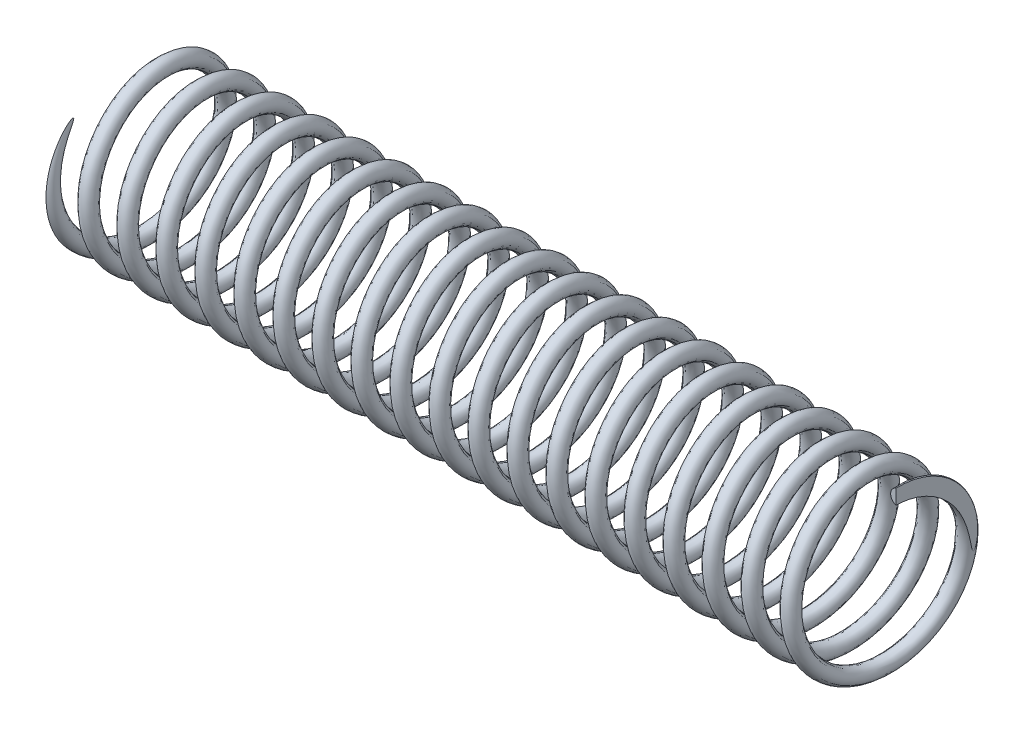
ISO-10303-21;
HEADER;
FILE_DESCRIPTION(('STEP AP214'),'2;1');
FILE_NAME('part.step','',(''),(''),'','','');
FILE_SCHEMA(('AUTOMOTIVE_DESIGN { 1 0 10303 214 1 1 1 1 }'));
ENDSEC;
DATA;
#1=APPLICATION_CONTEXT('core data for automotive mechanical design processes');
#2=APPLICATION_PROTOCOL_DEFINITION('international standard','automotive_design',2000,#1);
#3=PRODUCT_CONTEXT('',#1,'mechanical');
#4=PRODUCT('Part','Part','',(#3));
#5=PRODUCT_RELATED_PRODUCT_CATEGORY('part','',(#4));
#6=PRODUCT_DEFINITION_FORMATION('','',#4);
#7=PRODUCT_DEFINITION_CONTEXT('part definition',#1,'design');
#8=PRODUCT_DEFINITION('design','',#6,#7);
#9=PRODUCT_DEFINITION_SHAPE('','',#8);
#10=(LENGTH_UNIT() NAMED_UNIT(*) SI_UNIT(.MILLI.,.METRE.));
#11=(NAMED_UNIT(*) PLANE_ANGLE_UNIT() SI_UNIT($,.RADIAN.));
#12=(NAMED_UNIT(*) SI_UNIT($,.STERADIAN.) SOLID_ANGLE_UNIT());
#13=UNCERTAINTY_MEASURE_WITH_UNIT(LENGTH_MEASURE(1.E-05),#10,'distance_accuracy_value','');
#14=(GEOMETRIC_REPRESENTATION_CONTEXT(3) GLOBAL_UNCERTAINTY_ASSIGNED_CONTEXT((#13)) GLOBAL_UNIT_ASSIGNED_CONTEXT((#10,
#11,#12)) REPRESENTATION_CONTEXT('',''));
#15=CARTESIAN_POINT('',(0.,0.,0.));
#16=DIRECTION('',(0.,0.,1.));
#17=DIRECTION('',(1.,0.,0.));
#18=AXIS2_PLACEMENT_3D('',#15,#16,#17);
#19=CARTESIAN_POINT('',(0.,3.,0.));
#20=DIRECTION('',(0.,0.,1.));
#21=DIRECTION('',(1.,0.,0.));
#22=AXIS2_PLACEMENT_3D('',#19,#20,#21);
#23=PLANE('',#22);
#24=DIRECTION('',(0.,-1.,0.));
#25=VECTOR('',#24,1.);
#26=CARTESIAN_POINT('',(-0.0993014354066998,3.,0.));
#27=LINE('',#26,#25);
#28=CARTESIAN_POINT('',(-0.0993014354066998,3.28308872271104,0.));
#29=VERTEX_POINT('',#28);
#30=CARTESIAN_POINT('',(-0.0993014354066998,2.71691127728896,0.));
#31=VERTEX_POINT('',#30);
#32=EDGE_CURVE('E49',#29,#31,#27,.T.);
#33=ORIENTED_EDGE('',*,*,#32,.F.);
#34=CARTESIAN_POINT('',(0.,3.,0.));
#35=DIRECTION('',(0.,0.,1.));
#36=DIRECTION('',(1.,0.,0.));
#37=AXIS2_PLACEMENT_3D('',#34,#35,#36);
#38=CIRCLE('',#37,0.3);
#39=EDGE_CURVE('E43',#29,#31,#38,.T.);
#40=ORIENTED_EDGE('',*,*,#39,.T.);
#41=EDGE_LOOP('',(#33,#40));
#42=FACE_BOUND('',#41,.T.);
#43=ADVANCED_FACE('F32',(#42),#23,.T.);
#44=CARTESIAN_POINT('',(0.3,3.,0.));
#45=CARTESIAN_POINT('',(0.175,3.,-1.73205080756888));
#46=CARTESIAN_POINT('',(0.0500000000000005,1.5,-2.59807621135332));
#47=CARTESIAN_POINT('',(-0.0749999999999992,0.,-3.46410161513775));
#48=CARTESIAN_POINT('',(-0.199999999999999,-1.5,-2.59807621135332));
#49=CARTESIAN_POINT('',(-0.324999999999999,-3.,-1.73205080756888));
#50=CARTESIAN_POINT('',(-0.449999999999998,-3.,0.));
#51=CARTESIAN_POINT('',(-0.574999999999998,-3.,1.73205080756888));
#52=CARTESIAN_POINT('',(-0.699999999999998,-1.5,2.59807621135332));
#53=CARTESIAN_POINT('',(-0.824999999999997,0.,3.46410161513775));
#54=CARTESIAN_POINT('',(-0.949999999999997,1.5,2.59807621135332));
#55=CARTESIAN_POINT('',(-1.075,3.,1.73205080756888));
#56=CARTESIAN_POINT('',(-1.2,3.,0.));
#57=CARTESIAN_POINT('',(-1.325,3.,-1.73205080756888));
#58=CARTESIAN_POINT('',(-1.45,1.5,-2.59807621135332));
#59=CARTESIAN_POINT('',(-1.575,0.,-3.46410161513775));
#60=CARTESIAN_POINT('',(-1.7,-1.5,-2.59807621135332));
#61=CARTESIAN_POINT('',(-1.825,-3.,-1.73205080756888));
#62=CARTESIAN_POINT('',(-1.94999999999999,-3.,0.));
#63=CARTESIAN_POINT('',(-2.07499999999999,-3.,1.73205080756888));
#64=CARTESIAN_POINT('',(-2.19999999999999,-1.5,2.59807621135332));
#65=CARTESIAN_POINT('',(-2.32499999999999,0.,3.46410161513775));
#66=CARTESIAN_POINT('',(-2.44999999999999,1.5,2.59807621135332));
#67=CARTESIAN_POINT('',(-2.57499999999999,3.,1.73205080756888));
#68=CARTESIAN_POINT('',(-2.69999999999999,3.,0.));
#69=CARTESIAN_POINT('',(-2.82499999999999,3.,-1.73205080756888));
#70=CARTESIAN_POINT('',(-2.94999999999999,1.5,-2.59807621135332));
#71=CARTESIAN_POINT('',(-3.07499999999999,0.,-3.46410161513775));
#72=CARTESIAN_POINT('',(-3.19999999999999,-1.5,-2.59807621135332));
#73=CARTESIAN_POINT('',(-3.32499999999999,-3.,-1.73205080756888));
#74=CARTESIAN_POINT('',(-3.44999999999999,-3.,0.));
#75=CARTESIAN_POINT('',(-3.57499999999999,-3.,1.73205080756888));
#76=CARTESIAN_POINT('',(-3.69999999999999,-1.5,2.59807621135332));
#77=CARTESIAN_POINT('',(-3.82499999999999,0.,3.46410161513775));
#78=CARTESIAN_POINT('',(-3.94999999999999,1.5,2.59807621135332));
#79=CARTESIAN_POINT('',(-4.07499999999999,3.,1.73205080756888));
#80=CARTESIAN_POINT('',(-4.19999999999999,3.,0.));
#81=CARTESIAN_POINT('',(-4.32499999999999,3.,-1.73205080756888));
#82=CARTESIAN_POINT('',(-4.44999999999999,1.5,-2.59807621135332));
#83=CARTESIAN_POINT('',(-4.57499999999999,0.,-3.46410161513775));
#84=CARTESIAN_POINT('',(-4.69999999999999,-1.5,-2.59807621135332));
#85=CARTESIAN_POINT('',(-4.82499999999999,-3.,-1.73205080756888));
#86=CARTESIAN_POINT('',(-4.94999999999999,-3.,0.));
#87=CARTESIAN_POINT('',(-5.07499999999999,-3.,1.73205080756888));
#88=CARTESIAN_POINT('',(-5.19999999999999,-1.5,2.59807621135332));
#89=CARTESIAN_POINT('',(-5.32499999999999,0.,3.46410161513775));
#90=CARTESIAN_POINT('',(-5.44999999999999,1.5,2.59807621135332));
#91=CARTESIAN_POINT('',(-5.57499999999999,3.,1.73205080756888));
#92=CARTESIAN_POINT('',(-5.69999999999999,3.,0.));
#93=CARTESIAN_POINT('',(-5.82499999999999,3.,-1.73205080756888));
#94=CARTESIAN_POINT('',(-5.94999999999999,1.5,-2.59807621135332));
#95=CARTESIAN_POINT('',(-6.07499999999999,0.,-3.46410161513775));
#96=CARTESIAN_POINT('',(-6.19999999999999,-1.5,-2.59807621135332));
#97=CARTESIAN_POINT('',(-6.32499999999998,-3.,-1.73205080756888));
#98=CARTESIAN_POINT('',(-6.44999999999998,-3.,0.));
#99=CARTESIAN_POINT('',(-6.57499999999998,-3.,1.73205080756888));
#100=CARTESIAN_POINT('',(-6.69999999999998,-1.5,2.59807621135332));
#101=CARTESIAN_POINT('',(-6.82499999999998,0.,3.46410161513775));
#102=CARTESIAN_POINT('',(-6.94999999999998,1.5,2.59807621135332));
#103=CARTESIAN_POINT('',(-7.07499999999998,3.,1.73205080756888));
#104=CARTESIAN_POINT('',(-7.19999999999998,3.,0.));
#105=CARTESIAN_POINT('',(-7.32499999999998,3.,-1.73205080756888));
#106=CARTESIAN_POINT('',(-7.44999999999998,1.5,-2.59807621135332));
#107=CARTESIAN_POINT('',(-7.57499999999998,0.,-3.46410161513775));
#108=CARTESIAN_POINT('',(-7.69999999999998,-1.5,-2.59807621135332));
#109=CARTESIAN_POINT('',(-7.82499999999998,-3.,-1.73205080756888));
#110=CARTESIAN_POINT('',(-7.94999999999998,-3.,0.));
#111=CARTESIAN_POINT('',(-8.07499999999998,-3.,1.73205080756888));
#112=CARTESIAN_POINT('',(-8.19999999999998,-1.5,2.59807621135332));
#113=CARTESIAN_POINT('',(-8.32499999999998,0.,3.46410161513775));
#114=CARTESIAN_POINT('',(-8.44999999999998,1.5,2.59807621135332));
#115=CARTESIAN_POINT('',(-8.57499999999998,3.,1.73205080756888));
#116=CARTESIAN_POINT('',(-8.69999999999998,3.,0.));
#117=CARTESIAN_POINT('',(-8.82499999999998,3.,-1.73205080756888));
#118=CARTESIAN_POINT('',(-8.94999999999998,1.5,-2.59807621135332));
#119=CARTESIAN_POINT('',(-9.07499999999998,0.,-3.46410161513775));
#120=CARTESIAN_POINT('',(-9.19999999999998,-1.5,-2.59807621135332));
#121=CARTESIAN_POINT('',(-9.32499999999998,-3.,-1.73205080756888));
#122=CARTESIAN_POINT('',(-9.44999999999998,-3.,0.));
#123=CARTESIAN_POINT('',(-9.57499999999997,-3.,1.73205080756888));
#124=CARTESIAN_POINT('',(-9.69999999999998,-1.5,2.59807621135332));
#125=CARTESIAN_POINT('',(-9.82499999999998,0.,3.46410161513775));
#126=CARTESIAN_POINT('',(-9.94999999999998,1.5,2.59807621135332));
#127=CARTESIAN_POINT('',(-10.075,3.,1.73205080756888));
#128=CARTESIAN_POINT('',(-10.2,3.,0.));
#129=CARTESIAN_POINT('',(-10.325,3.,-1.73205080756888));
#130=CARTESIAN_POINT('',(-10.45,1.5,-2.59807621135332));
#131=CARTESIAN_POINT('',(-10.575,0.,-3.46410161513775));
#132=CARTESIAN_POINT('',(-10.7,-1.5,-2.59807621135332));
#133=CARTESIAN_POINT('',(-10.825,-3.,-1.73205080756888));
#134=CARTESIAN_POINT('',(-10.95,-3.,0.));
#135=CARTESIAN_POINT('',(-11.075,-3.,1.73205080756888));
#136=CARTESIAN_POINT('',(-11.2,-1.5,2.59807621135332));
#137=CARTESIAN_POINT('',(-11.325,0.,3.46410161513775));
#138=CARTESIAN_POINT('',(-11.45,1.5,2.59807621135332));
#139=CARTESIAN_POINT('',(-11.575,3.,1.73205080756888));
#140=CARTESIAN_POINT('',(-11.7,3.,0.));
#141=CARTESIAN_POINT('',(-11.825,3.,-1.73205080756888));
#142=CARTESIAN_POINT('',(-11.95,1.5,-2.59807621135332));
#143=CARTESIAN_POINT('',(-12.075,0.,-3.46410161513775));
#144=CARTESIAN_POINT('',(-12.2,-1.5,-2.59807621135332));
#145=CARTESIAN_POINT('',(-12.325,-3.,-1.73205080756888));
#146=CARTESIAN_POINT('',(-12.45,-3.,0.));
#147=CARTESIAN_POINT('',(-12.575,-3.,1.73205080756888));
#148=CARTESIAN_POINT('',(-12.7,-1.5,2.59807621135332));
#149=CARTESIAN_POINT('',(-12.825,0.,3.46410161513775));
#150=CARTESIAN_POINT('',(-12.95,1.5,2.59807621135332));
#151=CARTESIAN_POINT('',(-13.075,3.,1.73205080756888));
#152=CARTESIAN_POINT('',(-13.2,3.,0.));
#153=CARTESIAN_POINT('',(-13.325,3.,-1.73205080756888));
#154=CARTESIAN_POINT('',(-13.45,1.5,-2.59807621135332));
#155=CARTESIAN_POINT('',(-13.575,0.,-3.46410161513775));
#156=CARTESIAN_POINT('',(-13.7,-1.5,-2.59807621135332));
#157=CARTESIAN_POINT('',(-13.825,-3.,-1.73205080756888));
#158=CARTESIAN_POINT('',(-13.95,-3.,0.));
#159=CARTESIAN_POINT('',(-14.075,-3.,1.73205080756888));
#160=CARTESIAN_POINT('',(-14.2,-1.5,2.59807621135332));
#161=CARTESIAN_POINT('',(-14.325,0.,3.46410161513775));
#162=CARTESIAN_POINT('',(-14.45,1.5,2.59807621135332));
#163=CARTESIAN_POINT('',(-14.575,3.,1.73205080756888));
#164=CARTESIAN_POINT('',(-14.7,3.,0.));
#165=CARTESIAN_POINT('',(-14.825,3.,-1.73205080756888));
#166=CARTESIAN_POINT('',(-14.95,1.5,-2.59807621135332));
#167=CARTESIAN_POINT('',(-15.075,0.,-3.46410161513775));
#168=CARTESIAN_POINT('',(-15.2,-1.5,-2.59807621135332));
#169=CARTESIAN_POINT('',(-15.325,-3.,-1.73205080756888));
#170=CARTESIAN_POINT('',(-15.45,-3.,0.));
#171=CARTESIAN_POINT('',(-15.575,-3.,1.73205080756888));
#172=CARTESIAN_POINT('',(-15.7,-1.5,2.59807621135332));
#173=CARTESIAN_POINT('',(-15.825,0.,3.46410161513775));
#174=CARTESIAN_POINT('',(-15.95,1.5,2.59807621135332));
#175=CARTESIAN_POINT('',(-16.075,3.,1.73205080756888));
#176=CARTESIAN_POINT('',(-16.2,3.,0.));
#177=CARTESIAN_POINT('',(-16.325,3.,-1.73205080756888));
#178=CARTESIAN_POINT('',(-16.45,1.5,-2.59807621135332));
#179=CARTESIAN_POINT('',(-16.575,0.,-3.46410161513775));
#180=CARTESIAN_POINT('',(-16.7,-1.5,-2.59807621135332));
#181=CARTESIAN_POINT('',(-16.825,-3.,-1.73205080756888));
#182=CARTESIAN_POINT('',(-16.95,-3.,0.));
#183=CARTESIAN_POINT('',(-17.075,-3.,1.73205080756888));
#184=CARTESIAN_POINT('',(-17.2,-1.5,2.59807621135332));
#185=CARTESIAN_POINT('',(-17.325,0.,3.46410161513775));
#186=CARTESIAN_POINT('',(-17.45,1.5,2.59807621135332));
#187=CARTESIAN_POINT('',(-17.575,3.,1.73205080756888));
#188=CARTESIAN_POINT('',(-17.7,3.,0.));
#189=CARTESIAN_POINT('',(-17.825,3.,-1.73205080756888));
#190=CARTESIAN_POINT('',(-17.95,1.5,-2.59807621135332));
#191=CARTESIAN_POINT('',(-18.075,0.,-3.46410161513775));
#192=CARTESIAN_POINT('',(-18.2,-1.5,-2.59807621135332));
#193=CARTESIAN_POINT('',(-18.325,-3.,-1.73205080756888));
#194=CARTESIAN_POINT('',(-18.45,-3.,0.));
#195=CARTESIAN_POINT('',(-18.575,-3.,1.73205080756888));
#196=CARTESIAN_POINT('',(-18.7,-1.5,2.59807621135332));
#197=CARTESIAN_POINT('',(-18.825,0.,3.46410161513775));
#198=CARTESIAN_POINT('',(-18.95,1.5,2.59807621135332));
#199=CARTESIAN_POINT('',(-19.075,3.,1.73205080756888));
#200=CARTESIAN_POINT('',(-19.2,3.,0.));
#201=CARTESIAN_POINT('',(-19.325,3.,-1.73205080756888));
#202=CARTESIAN_POINT('',(-19.45,1.5,-2.59807621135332));
#203=CARTESIAN_POINT('',(-19.575,0.,-3.46410161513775));
#204=CARTESIAN_POINT('',(-19.7,-1.5,-2.59807621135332));
#205=CARTESIAN_POINT('',(-19.825,-3.,-1.73205080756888));
#206=CARTESIAN_POINT('',(-19.95,-3.,0.));
#207=CARTESIAN_POINT('',(-20.075,-3.,1.73205080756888));
#208=CARTESIAN_POINT('',(-20.2,-1.5,2.59807621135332));
#209=CARTESIAN_POINT('',(-20.325,0.,3.46410161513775));
#210=CARTESIAN_POINT('',(-20.45,1.5,2.59807621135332));
#211=CARTESIAN_POINT('',(-20.5749999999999,3.,1.73205080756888));
#212=CARTESIAN_POINT('',(-20.6999999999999,3.,0.));
#213=CARTESIAN_POINT('',(-20.8249999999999,3.,-1.73205080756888));
#214=CARTESIAN_POINT('',(-20.9499999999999,1.5,-2.59807621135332));
#215=CARTESIAN_POINT('',(-21.0749999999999,0.,-3.46410161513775));
#216=CARTESIAN_POINT('',(-21.1999999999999,-1.5,-2.59807621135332));
#217=CARTESIAN_POINT('',(-21.3249999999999,-3.,-1.73205080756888));
#218=CARTESIAN_POINT('',(-21.4499999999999,-3.,0.));
#219=CARTESIAN_POINT('',(-21.5749999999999,-3.,1.73205080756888));
#220=CARTESIAN_POINT('',(-21.6999999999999,-1.5,2.59807621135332));
#221=CARTESIAN_POINT('',(-21.8249999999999,0.,3.46410161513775));
#222=CARTESIAN_POINT('',(-21.9499999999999,1.5,2.59807621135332));
#223=CARTESIAN_POINT('',(-22.0749999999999,3.,1.73205080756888));
#224=CARTESIAN_POINT('',(-22.1999999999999,3.,0.));
#225=CARTESIAN_POINT('',(-22.3249999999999,3.,-1.73205080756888));
#226=CARTESIAN_POINT('',(-22.4499999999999,1.5,-2.59807621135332));
#227=CARTESIAN_POINT('',(-22.5749999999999,0.,-3.46410161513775));
#228=CARTESIAN_POINT('',(-22.6999999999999,-1.5,-2.59807621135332));
#229=CARTESIAN_POINT('',(-22.8249999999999,-3.,-1.73205080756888));
#230=CARTESIAN_POINT('',(-22.9499999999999,-3.,0.));
#231=CARTESIAN_POINT('',(-23.0749999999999,-3.,1.73205080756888));
#232=CARTESIAN_POINT('',(-23.1999999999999,-1.5,2.59807621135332));
#233=CARTESIAN_POINT('',(-23.3249999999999,0.,3.46410161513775));
#234=CARTESIAN_POINT('',(-23.4499999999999,1.5,2.59807621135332));
#235=CARTESIAN_POINT('',(-23.5749999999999,3.,1.73205080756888));
#236=CARTESIAN_POINT('',(-23.6999999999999,3.,0.));
#237=CARTESIAN_POINT('',(-23.8249999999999,3.,-1.73205080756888));
#238=CARTESIAN_POINT('',(-23.9499999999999,1.5,-2.59807621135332));
#239=CARTESIAN_POINT('',(-24.0749999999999,0.,-3.46410161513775));
#240=CARTESIAN_POINT('',(-24.1999999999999,-1.5,-2.59807621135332));
#241=CARTESIAN_POINT('',(-24.3249999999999,-3.,-1.73205080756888));
#242=CARTESIAN_POINT('',(-24.4499999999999,-3.,0.));
#243=CARTESIAN_POINT('',(-24.5749999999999,-3.,1.73205080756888));
#244=CARTESIAN_POINT('',(-24.6999999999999,-1.5,2.59807621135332));
#245=CARTESIAN_POINT('',(-24.8249999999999,0.,3.46410161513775));
#246=CARTESIAN_POINT('',(-24.9499999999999,1.5,2.59807621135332));
#247=CARTESIAN_POINT('',(-25.0749999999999,3.,1.73205080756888));
#248=CARTESIAN_POINT('',(-25.1999999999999,3.,0.));
#249=CARTESIAN_POINT('',(-25.3249999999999,3.,-1.73205080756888));
#250=CARTESIAN_POINT('',(-25.4499999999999,1.5,-2.59807621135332));
#251=CARTESIAN_POINT('',(-25.5749999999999,0.,-3.46410161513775));
#252=CARTESIAN_POINT('',(-25.6999999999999,-1.5,-2.59807621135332));
#253=CARTESIAN_POINT('',(-25.8249999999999,-3.,-1.73205080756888));
#254=CARTESIAN_POINT('',(-25.9499999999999,-3.,0.));
#255=CARTESIAN_POINT('',(-26.0749999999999,-3.,1.73205080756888));
#256=CARTESIAN_POINT('',(-26.1999999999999,-1.5,2.59807621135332));
#257=CARTESIAN_POINT('',(-26.3249999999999,0.,3.46410161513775));
#258=CARTESIAN_POINT('',(-26.4499999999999,1.5,2.59807621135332));
#259=CARTESIAN_POINT('',(-26.5749999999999,3.,1.73205080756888));
#260=CARTESIAN_POINT('',(-26.6999999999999,3.,0.));
#261=CARTESIAN_POINT('',(-26.8249999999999,3.,-1.73205080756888));
#262=CARTESIAN_POINT('',(-26.9499999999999,1.5,-2.59807621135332));
#263=CARTESIAN_POINT('',(-27.0749999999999,0.,-3.46410161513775));
#264=CARTESIAN_POINT('',(-27.1999999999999,-1.5,-2.59807621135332));
#265=CARTESIAN_POINT('',(-27.3249999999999,-3.,-1.73205080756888));
#266=CARTESIAN_POINT('',(-27.4499999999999,-3.,0.));
#267=CARTESIAN_POINT('',(-27.5749999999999,-3.,1.73205080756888));
#268=CARTESIAN_POINT('',(-27.6999999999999,-1.5,2.59807621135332));
#269=CARTESIAN_POINT('',(-27.8249999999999,0.,3.46410161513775));
#270=CARTESIAN_POINT('',(-27.9499999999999,1.5,2.59807621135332));
#271=CARTESIAN_POINT('',(-28.0749999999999,3.,1.73205080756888));
#272=CARTESIAN_POINT('',(-28.1999999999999,3.,0.));
#273=CARTESIAN_POINT('',(-28.3249999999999,3.,-1.73205080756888));
#274=CARTESIAN_POINT('',(-28.4499999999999,1.5,-2.59807621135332));
#275=CARTESIAN_POINT('',(-28.5749999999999,0.,-3.46410161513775));
#276=CARTESIAN_POINT('',(-28.6999999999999,-1.5,-2.59807621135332));
#277=CARTESIAN_POINT('',(-28.8249999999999,-3.,-1.73205080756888));
#278=CARTESIAN_POINT('',(-28.9499999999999,-3.,0.));
#279=CARTESIAN_POINT('',(-29.0749999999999,-3.,1.73205080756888));
#280=CARTESIAN_POINT('',(-29.1999999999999,-1.5,2.59807621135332));
#281=CARTESIAN_POINT('',(-29.3249999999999,0.,3.46410161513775));
#282=CARTESIAN_POINT('',(-29.4499999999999,1.5,2.59807621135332));
#283=CARTESIAN_POINT('',(-29.5749999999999,3.,1.73205080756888));
#284=CARTESIAN_POINT('',(-29.6999999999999,3.,0.));
#285=CARTESIAN_POINT('',(-29.8249999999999,3.,-1.73205080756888));
#286=CARTESIAN_POINT('',(-29.9499999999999,1.5,-2.59807621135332));
#287=CARTESIAN_POINT('',(-30.0749999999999,0.,-3.46410161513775));
#288=CARTESIAN_POINT('',(-30.1999999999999,-1.5,-2.59807621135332));
#289=CARTESIAN_POINT('',(-30.3249999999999,-3.,-1.73205080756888));
#290=CARTESIAN_POINT('',(-30.4499999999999,-3.,0.));
#291=CARTESIAN_POINT('',(-30.5749999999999,-3.,1.73205080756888));
#292=CARTESIAN_POINT('',(-30.6999999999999,-1.5,2.59807621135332));
#293=CARTESIAN_POINT('',(-30.8249999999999,0.,3.46410161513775));
#294=CARTESIAN_POINT('',(-30.9499999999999,1.5,2.59807621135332));
#295=CARTESIAN_POINT('',(-31.0749999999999,3.,1.73205080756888));
#296=CARTESIAN_POINT('',(-31.1999999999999,3.,0.));
#297=CARTESIAN_POINT('',(0.3,3.6,0.));
#298=CARTESIAN_POINT('',(0.175,3.6,-2.07846096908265));
#299=CARTESIAN_POINT('',(0.0500000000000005,1.8,-3.11769145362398));
#300=CARTESIAN_POINT('',(-0.0749999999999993,0.,-4.15692193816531));
#301=CARTESIAN_POINT('',(-0.199999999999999,-1.8,-3.11769145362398));
#302=CARTESIAN_POINT('',(-0.324999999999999,-3.6,-2.07846096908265));
#303=CARTESIAN_POINT('',(-0.449999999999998,-3.6,0.));
#304=CARTESIAN_POINT('',(-0.574999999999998,-3.6,2.07846096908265));
#305=CARTESIAN_POINT('',(-0.699999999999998,-1.8,3.11769145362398));
#306=CARTESIAN_POINT('',(-0.824999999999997,0.,4.15692193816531));
#307=CARTESIAN_POINT('',(-0.949999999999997,1.8,3.11769145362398));
#308=CARTESIAN_POINT('',(-1.075,3.6,2.07846096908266));
#309=CARTESIAN_POINT('',(-1.2,3.6,0.));
#310=CARTESIAN_POINT('',(-1.325,3.6,-2.07846096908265));
#311=CARTESIAN_POINT('',(-1.45,1.8,-3.11769145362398));
#312=CARTESIAN_POINT('',(-1.575,0.,-4.15692193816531));
#313=CARTESIAN_POINT('',(-1.7,-1.8,-3.11769145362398));
#314=CARTESIAN_POINT('',(-1.825,-3.6,-2.07846096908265));
#315=CARTESIAN_POINT('',(-1.94999999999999,-3.6,0.));
#316=CARTESIAN_POINT('',(-2.07499999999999,-3.6,2.07846096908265));
#317=CARTESIAN_POINT('',(-2.19999999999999,-1.8,3.11769145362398));
#318=CARTESIAN_POINT('',(-2.32499999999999,0.,4.15692193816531));
#319=CARTESIAN_POINT('',(-2.44999999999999,1.8,3.11769145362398));
#320=CARTESIAN_POINT('',(-2.57499999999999,3.6,2.07846096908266));
#321=CARTESIAN_POINT('',(-2.69999999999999,3.6,0.));
#322=CARTESIAN_POINT('',(-2.82499999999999,3.6,-2.07846096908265));
#323=CARTESIAN_POINT('',(-2.94999999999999,1.8,-3.11769145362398));
#324=CARTESIAN_POINT('',(-3.07499999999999,0.,-4.15692193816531));
#325=CARTESIAN_POINT('',(-3.19999999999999,-1.8,-3.11769145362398));
#326=CARTESIAN_POINT('',(-3.32499999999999,-3.6,-2.07846096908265));
#327=CARTESIAN_POINT('',(-3.44999999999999,-3.6,0.));
#328=CARTESIAN_POINT('',(-3.57499999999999,-3.6,2.07846096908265));
#329=CARTESIAN_POINT('',(-3.69999999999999,-1.8,3.11769145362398));
#330=CARTESIAN_POINT('',(-3.82499999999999,0.,4.15692193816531));
#331=CARTESIAN_POINT('',(-3.94999999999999,1.8,3.11769145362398));
#332=CARTESIAN_POINT('',(-4.07499999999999,3.6,2.07846096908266));
#333=CARTESIAN_POINT('',(-4.19999999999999,3.6,0.));
#334=CARTESIAN_POINT('',(-4.32499999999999,3.6,-2.07846096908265));
#335=CARTESIAN_POINT('',(-4.44999999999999,1.8,-3.11769145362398));
#336=CARTESIAN_POINT('',(-4.57499999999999,0.,-4.15692193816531));
#337=CARTESIAN_POINT('',(-4.69999999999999,-1.8,-3.11769145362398));
#338=CARTESIAN_POINT('',(-4.82499999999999,-3.6,-2.07846096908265));
#339=CARTESIAN_POINT('',(-4.94999999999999,-3.6,0.));
#340=CARTESIAN_POINT('',(-5.07499999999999,-3.6,2.07846096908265));
#341=CARTESIAN_POINT('',(-5.19999999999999,-1.8,3.11769145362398));
#342=CARTESIAN_POINT('',(-5.32499999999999,0.,4.15692193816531));
#343=CARTESIAN_POINT('',(-5.44999999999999,1.8,3.11769145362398));
#344=CARTESIAN_POINT('',(-5.57499999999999,3.6,2.07846096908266));
#345=CARTESIAN_POINT('',(-5.69999999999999,3.6,0.));
#346=CARTESIAN_POINT('',(-5.82499999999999,3.6,-2.07846096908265));
#347=CARTESIAN_POINT('',(-5.94999999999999,1.8,-3.11769145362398));
#348=CARTESIAN_POINT('',(-6.07499999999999,0.,-4.15692193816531));
#349=CARTESIAN_POINT('',(-6.19999999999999,-1.8,-3.11769145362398));
#350=CARTESIAN_POINT('',(-6.32499999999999,-3.6,-2.07846096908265));
#351=CARTESIAN_POINT('',(-6.44999999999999,-3.6,0.));
#352=CARTESIAN_POINT('',(-6.57499999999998,-3.6,2.07846096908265));
#353=CARTESIAN_POINT('',(-6.69999999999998,-1.8,3.11769145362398));
#354=CARTESIAN_POINT('',(-6.82499999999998,0.,4.15692193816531));
#355=CARTESIAN_POINT('',(-6.94999999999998,1.8,3.11769145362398));
#356=CARTESIAN_POINT('',(-7.07499999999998,3.6,2.07846096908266));
#357=CARTESIAN_POINT('',(-7.19999999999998,3.6,0.));
#358=CARTESIAN_POINT('',(-7.32499999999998,3.6,-2.07846096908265));
#359=CARTESIAN_POINT('',(-7.44999999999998,1.8,-3.11769145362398));
#360=CARTESIAN_POINT('',(-7.57499999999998,0.,-4.15692193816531));
#361=CARTESIAN_POINT('',(-7.69999999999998,-1.8,-3.11769145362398));
#362=CARTESIAN_POINT('',(-7.82499999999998,-3.6,-2.07846096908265));
#363=CARTESIAN_POINT('',(-7.94999999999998,-3.6,0.));
#364=CARTESIAN_POINT('',(-8.07499999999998,-3.6,2.07846096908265));
#365=CARTESIAN_POINT('',(-8.19999999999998,-1.8,3.11769145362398));
#366=CARTESIAN_POINT('',(-8.32499999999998,0.,4.15692193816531));
#367=CARTESIAN_POINT('',(-8.44999999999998,1.8,3.11769145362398));
#368=CARTESIAN_POINT('',(-8.57499999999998,3.6,2.07846096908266));
#369=CARTESIAN_POINT('',(-8.69999999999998,3.6,0.));
#370=CARTESIAN_POINT('',(-8.82499999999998,3.6,-2.07846096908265));
#371=CARTESIAN_POINT('',(-8.94999999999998,1.8,-3.11769145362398));
#372=CARTESIAN_POINT('',(-9.07499999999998,0.,-4.15692193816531));
#373=CARTESIAN_POINT('',(-9.19999999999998,-1.8,-3.11769145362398));
#374=CARTESIAN_POINT('',(-9.32499999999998,-3.6,-2.07846096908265));
#375=CARTESIAN_POINT('',(-9.44999999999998,-3.6,0.));
#376=CARTESIAN_POINT('',(-9.57499999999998,-3.6,2.07846096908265));
#377=CARTESIAN_POINT('',(-9.69999999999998,-1.8,3.11769145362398));
#378=CARTESIAN_POINT('',(-9.82499999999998,0.,4.15692193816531));
#379=CARTESIAN_POINT('',(-9.94999999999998,1.8,3.11769145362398));
#380=CARTESIAN_POINT('',(-10.075,3.6,2.07846096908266));
#381=CARTESIAN_POINT('',(-10.2,3.6,0.));
#382=CARTESIAN_POINT('',(-10.325,3.6,-2.07846096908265));
#383=CARTESIAN_POINT('',(-10.45,1.8,-3.11769145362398));
#384=CARTESIAN_POINT('',(-10.575,0.,-4.15692193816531));
#385=CARTESIAN_POINT('',(-10.7,-1.8,-3.11769145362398));
#386=CARTESIAN_POINT('',(-10.825,-3.6,-2.07846096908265));
#387=CARTESIAN_POINT('',(-10.95,-3.6,0.));
#388=CARTESIAN_POINT('',(-11.075,-3.6,2.07846096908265));
#389=CARTESIAN_POINT('',(-11.2,-1.8,3.11769145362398));
#390=CARTESIAN_POINT('',(-11.325,0.,4.15692193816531));
#391=CARTESIAN_POINT('',(-11.45,1.8,3.11769145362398));
#392=CARTESIAN_POINT('',(-11.575,3.6,2.07846096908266));
#393=CARTESIAN_POINT('',(-11.7,3.6,0.));
#394=CARTESIAN_POINT('',(-11.825,3.6,-2.07846096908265));
#395=CARTESIAN_POINT('',(-11.95,1.8,-3.11769145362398));
#396=CARTESIAN_POINT('',(-12.075,0.,-4.15692193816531));
#397=CARTESIAN_POINT('',(-12.2,-1.8,-3.11769145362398));
#398=CARTESIAN_POINT('',(-12.325,-3.6,-2.07846096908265));
#399=CARTESIAN_POINT('',(-12.45,-3.6,0.));
#400=CARTESIAN_POINT('',(-12.575,-3.6,2.07846096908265));
#401=CARTESIAN_POINT('',(-12.7,-1.8,3.11769145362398));
#402=CARTESIAN_POINT('',(-12.825,0.,4.15692193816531));
#403=CARTESIAN_POINT('',(-12.95,1.8,3.11769145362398));
#404=CARTESIAN_POINT('',(-13.075,3.6,2.07846096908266));
#405=CARTESIAN_POINT('',(-13.2,3.6,0.));
#406=CARTESIAN_POINT('',(-13.325,3.6,-2.07846096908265));
#407=CARTESIAN_POINT('',(-13.45,1.8,-3.11769145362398));
#408=CARTESIAN_POINT('',(-13.575,0.,-4.15692193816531));
#409=CARTESIAN_POINT('',(-13.7,-1.8,-3.11769145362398));
#410=CARTESIAN_POINT('',(-13.825,-3.6,-2.07846096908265));
#411=CARTESIAN_POINT('',(-13.95,-3.6,0.));
#412=CARTESIAN_POINT('',(-14.075,-3.6,2.07846096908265));
#413=CARTESIAN_POINT('',(-14.2,-1.8,3.11769145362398));
#414=CARTESIAN_POINT('',(-14.325,0.,4.15692193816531));
#415=CARTESIAN_POINT('',(-14.45,1.8,3.11769145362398));
#416=CARTESIAN_POINT('',(-14.575,3.6,2.07846096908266));
#417=CARTESIAN_POINT('',(-14.7,3.6,0.));
#418=CARTESIAN_POINT('',(-14.825,3.6,-2.07846096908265));
#419=CARTESIAN_POINT('',(-14.95,1.8,-3.11769145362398));
#420=CARTESIAN_POINT('',(-15.075,0.,-4.15692193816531));
#421=CARTESIAN_POINT('',(-15.2,-1.8,-3.11769145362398));
#422=CARTESIAN_POINT('',(-15.325,-3.6,-2.07846096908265));
#423=CARTESIAN_POINT('',(-15.45,-3.6,0.));
#424=CARTESIAN_POINT('',(-15.575,-3.6,2.07846096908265));
#425=CARTESIAN_POINT('',(-15.7,-1.8,3.11769145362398));
#426=CARTESIAN_POINT('',(-15.825,0.,4.15692193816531));
#427=CARTESIAN_POINT('',(-15.95,1.8,3.11769145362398));
#428=CARTESIAN_POINT('',(-16.075,3.6,2.07846096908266));
#429=CARTESIAN_POINT('',(-16.2,3.6,0.));
#430=CARTESIAN_POINT('',(-16.325,3.6,-2.07846096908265));
#431=CARTESIAN_POINT('',(-16.45,1.8,-3.11769145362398));
#432=CARTESIAN_POINT('',(-16.575,0.,-4.15692193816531));
#433=CARTESIAN_POINT('',(-16.7,-1.8,-3.11769145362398));
#434=CARTESIAN_POINT('',(-16.825,-3.6,-2.07846096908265));
#435=CARTESIAN_POINT('',(-16.95,-3.6,0.));
#436=CARTESIAN_POINT('',(-17.075,-3.6,2.07846096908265));
#437=CARTESIAN_POINT('',(-17.2,-1.8,3.11769145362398));
#438=CARTESIAN_POINT('',(-17.325,0.,4.15692193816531));
#439=CARTESIAN_POINT('',(-17.45,1.8,3.11769145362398));
#440=CARTESIAN_POINT('',(-17.575,3.6,2.07846096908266));
#441=CARTESIAN_POINT('',(-17.7,3.6,0.));
#442=CARTESIAN_POINT('',(-17.825,3.6,-2.07846096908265));
#443=CARTESIAN_POINT('',(-17.95,1.8,-3.11769145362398));
#444=CARTESIAN_POINT('',(-18.075,0.,-4.15692193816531));
#445=CARTESIAN_POINT('',(-18.2,-1.8,-3.11769145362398));
#446=CARTESIAN_POINT('',(-18.325,-3.6,-2.07846096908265));
#447=CARTESIAN_POINT('',(-18.45,-3.6,0.));
#448=CARTESIAN_POINT('',(-18.575,-3.6,2.07846096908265));
#449=CARTESIAN_POINT('',(-18.7,-1.8,3.11769145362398));
#450=CARTESIAN_POINT('',(-18.825,0.,4.15692193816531));
#451=CARTESIAN_POINT('',(-18.95,1.8,3.11769145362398));
#452=CARTESIAN_POINT('',(-19.075,3.6,2.07846096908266));
#453=CARTESIAN_POINT('',(-19.2,3.6,0.));
#454=CARTESIAN_POINT('',(-19.325,3.6,-2.07846096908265));
#455=CARTESIAN_POINT('',(-19.45,1.8,-3.11769145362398));
#456=CARTESIAN_POINT('',(-19.575,0.,-4.15692193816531));
#457=CARTESIAN_POINT('',(-19.7,-1.8,-3.11769145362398));
#458=CARTESIAN_POINT('',(-19.825,-3.6,-2.07846096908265));
#459=CARTESIAN_POINT('',(-19.95,-3.6,0.));
#460=CARTESIAN_POINT('',(-20.075,-3.6,2.07846096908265));
#461=CARTESIAN_POINT('',(-20.2,-1.8,3.11769145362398));
#462=CARTESIAN_POINT('',(-20.325,0.,4.15692193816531));
#463=CARTESIAN_POINT('',(-20.45,1.8,3.11769145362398));
#464=CARTESIAN_POINT('',(-20.5749999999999,3.6,2.07846096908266));
#465=CARTESIAN_POINT('',(-20.6999999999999,3.6,0.));
#466=CARTESIAN_POINT('',(-20.825,3.6,-2.07846096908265));
#467=CARTESIAN_POINT('',(-20.9499999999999,1.8,-3.11769145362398));
#468=CARTESIAN_POINT('',(-21.075,0.,-4.15692193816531));
#469=CARTESIAN_POINT('',(-21.2,-1.8,-3.11769145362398));
#470=CARTESIAN_POINT('',(-21.325,-3.6,-2.07846096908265));
#471=CARTESIAN_POINT('',(-21.45,-3.6,0.));
#472=CARTESIAN_POINT('',(-21.5749999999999,-3.6,2.07846096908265));
#473=CARTESIAN_POINT('',(-21.6999999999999,-1.8,3.11769145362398));
#474=CARTESIAN_POINT('',(-21.8249999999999,0.,4.15692193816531));
#475=CARTESIAN_POINT('',(-21.9499999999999,1.8,3.11769145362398));
#476=CARTESIAN_POINT('',(-22.0749999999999,3.6,2.07846096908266));
#477=CARTESIAN_POINT('',(-22.1999999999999,3.6,0.));
#478=CARTESIAN_POINT('',(-22.3249999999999,3.6,-2.07846096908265));
#479=CARTESIAN_POINT('',(-22.4499999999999,1.8,-3.11769145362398));
#480=CARTESIAN_POINT('',(-22.5749999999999,0.,-4.15692193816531));
#481=CARTESIAN_POINT('',(-22.6999999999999,-1.8,-3.11769145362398));
#482=CARTESIAN_POINT('',(-22.8249999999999,-3.6,-2.07846096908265));
#483=CARTESIAN_POINT('',(-22.9499999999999,-3.6,0.));
#484=CARTESIAN_POINT('',(-23.0749999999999,-3.6,2.07846096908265));
#485=CARTESIAN_POINT('',(-23.1999999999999,-1.8,3.11769145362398));
#486=CARTESIAN_POINT('',(-23.3249999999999,0.,4.15692193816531));
#487=CARTESIAN_POINT('',(-23.4499999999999,1.8,3.11769145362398));
#488=CARTESIAN_POINT('',(-23.5749999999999,3.6,2.07846096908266));
#489=CARTESIAN_POINT('',(-23.6999999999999,3.6,0.));
#490=CARTESIAN_POINT('',(-23.8249999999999,3.6,-2.07846096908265));
#491=CARTESIAN_POINT('',(-23.9499999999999,1.8,-3.11769145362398));
#492=CARTESIAN_POINT('',(-24.0749999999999,0.,-4.15692193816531));
#493=CARTESIAN_POINT('',(-24.1999999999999,-1.8,-3.11769145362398));
#494=CARTESIAN_POINT('',(-24.3249999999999,-3.6,-2.07846096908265));
#495=CARTESIAN_POINT('',(-24.4499999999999,-3.6,0.));
#496=CARTESIAN_POINT('',(-24.5749999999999,-3.6,2.07846096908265));
#497=CARTESIAN_POINT('',(-24.6999999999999,-1.8,3.11769145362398));
#498=CARTESIAN_POINT('',(-24.8249999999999,0.,4.15692193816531));
#499=CARTESIAN_POINT('',(-24.9499999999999,1.8,3.11769145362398));
#500=CARTESIAN_POINT('',(-25.0749999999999,3.6,2.07846096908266));
#501=CARTESIAN_POINT('',(-25.1999999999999,3.6,0.));
#502=CARTESIAN_POINT('',(-25.3249999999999,3.6,-2.07846096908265));
#503=CARTESIAN_POINT('',(-25.4499999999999,1.8,-3.11769145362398));
#504=CARTESIAN_POINT('',(-25.5749999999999,0.,-4.15692193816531));
#505=CARTESIAN_POINT('',(-25.6999999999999,-1.8,-3.11769145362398));
#506=CARTESIAN_POINT('',(-25.8249999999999,-3.6,-2.07846096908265));
#507=CARTESIAN_POINT('',(-25.9499999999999,-3.6,0.));
#508=CARTESIAN_POINT('',(-26.0749999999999,-3.6,2.07846096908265));
#509=CARTESIAN_POINT('',(-26.1999999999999,-1.8,3.11769145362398));
#510=CARTESIAN_POINT('',(-26.3249999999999,0.,4.15692193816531));
#511=CARTESIAN_POINT('',(-26.4499999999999,1.8,3.11769145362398));
#512=CARTESIAN_POINT('',(-26.5749999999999,3.6,2.07846096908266));
#513=CARTESIAN_POINT('',(-26.6999999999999,3.6,0.));
#514=CARTESIAN_POINT('',(-26.8249999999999,3.6,-2.07846096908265));
#515=CARTESIAN_POINT('',(-26.9499999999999,1.8,-3.11769145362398));
#516=CARTESIAN_POINT('',(-27.0749999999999,0.,-4.15692193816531));
#517=CARTESIAN_POINT('',(-27.1999999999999,-1.8,-3.11769145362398));
#518=CARTESIAN_POINT('',(-27.3249999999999,-3.6,-2.07846096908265));
#519=CARTESIAN_POINT('',(-27.4499999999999,-3.6,0.));
#520=CARTESIAN_POINT('',(-27.5749999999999,-3.6,2.07846096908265));
#521=CARTESIAN_POINT('',(-27.6999999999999,-1.8,3.11769145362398));
#522=CARTESIAN_POINT('',(-27.8249999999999,0.,4.15692193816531));
#523=CARTESIAN_POINT('',(-27.9499999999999,1.8,3.11769145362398));
#524=CARTESIAN_POINT('',(-28.0749999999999,3.6,2.07846096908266));
#525=CARTESIAN_POINT('',(-28.1999999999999,3.6,0.));
#526=CARTESIAN_POINT('',(-28.3249999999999,3.6,-2.07846096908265));
#527=CARTESIAN_POINT('',(-28.4499999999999,1.8,-3.11769145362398));
#528=CARTESIAN_POINT('',(-28.5749999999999,0.,-4.15692193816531));
#529=CARTESIAN_POINT('',(-28.6999999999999,-1.8,-3.11769145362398));
#530=CARTESIAN_POINT('',(-28.8249999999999,-3.6,-2.07846096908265));
#531=CARTESIAN_POINT('',(-28.9499999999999,-3.6,0.));
#532=CARTESIAN_POINT('',(-29.0749999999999,-3.6,2.07846096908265));
#533=CARTESIAN_POINT('',(-29.1999999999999,-1.8,3.11769145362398));
#534=CARTESIAN_POINT('',(-29.3249999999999,0.,4.15692193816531));
#535=CARTESIAN_POINT('',(-29.4499999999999,1.8,3.11769145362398));
#536=CARTESIAN_POINT('',(-29.5749999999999,3.6,2.07846096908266));
#537=CARTESIAN_POINT('',(-29.6999999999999,3.6,0.));
#538=CARTESIAN_POINT('',(-29.8249999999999,3.6,-2.07846096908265));
#539=CARTESIAN_POINT('',(-29.9499999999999,1.8,-3.11769145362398));
#540=CARTESIAN_POINT('',(-30.0749999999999,0.,-4.15692193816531));
#541=CARTESIAN_POINT('',(-30.1999999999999,-1.8,-3.11769145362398));
#542=CARTESIAN_POINT('',(-30.3249999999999,-3.6,-2.07846096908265));
#543=CARTESIAN_POINT('',(-30.4499999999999,-3.6,0.));
#544=CARTESIAN_POINT('',(-30.5749999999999,-3.6,2.07846096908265));
#545=CARTESIAN_POINT('',(-30.6999999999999,-1.8,3.11769145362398));
#546=CARTESIAN_POINT('',(-30.8249999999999,0.,4.15692193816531));
#547=CARTESIAN_POINT('',(-30.9499999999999,1.8,3.11769145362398));
#548=CARTESIAN_POINT('',(-31.0749999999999,3.6,2.07846096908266));
#549=CARTESIAN_POINT('',(-31.1999999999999,3.6,0.));
#550=CARTESIAN_POINT('',(-0.3,3.6,0.));
#551=CARTESIAN_POINT('',(-0.425,3.6,-2.07846096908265));
#552=CARTESIAN_POINT('',(-0.549999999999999,1.8,-3.11769145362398));
#553=CARTESIAN_POINT('',(-0.674999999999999,0.,-4.15692193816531));
#554=CARTESIAN_POINT('',(-0.799999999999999,-1.8,-3.11769145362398));
#555=CARTESIAN_POINT('',(-0.924999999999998,-3.6,-2.07846096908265));
#556=CARTESIAN_POINT('',(-1.05,-3.6,0.));
#557=CARTESIAN_POINT('',(-1.175,-3.6,2.07846096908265));
#558=CARTESIAN_POINT('',(-1.3,-1.8,3.11769145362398));
#559=CARTESIAN_POINT('',(-1.425,0.,4.15692193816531));
#560=CARTESIAN_POINT('',(-1.55,1.8,3.11769145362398));
#561=CARTESIAN_POINT('',(-1.675,3.6,2.07846096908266));
#562=CARTESIAN_POINT('',(-1.8,3.6,0.));
#563=CARTESIAN_POINT('',(-1.925,3.6,-2.07846096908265));
#564=CARTESIAN_POINT('',(-2.05,1.8,-3.11769145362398));
#565=CARTESIAN_POINT('',(-2.175,0.,-4.15692193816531));
#566=CARTESIAN_POINT('',(-2.3,-1.8,-3.11769145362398));
#567=CARTESIAN_POINT('',(-2.425,-3.6,-2.07846096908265));
#568=CARTESIAN_POINT('',(-2.54999999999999,-3.6,0.));
#569=CARTESIAN_POINT('',(-2.67499999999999,-3.6,2.07846096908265));
#570=CARTESIAN_POINT('',(-2.79999999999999,-1.8,3.11769145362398));
#571=CARTESIAN_POINT('',(-2.92499999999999,0.,4.15692193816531));
#572=CARTESIAN_POINT('',(-3.04999999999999,1.8,3.11769145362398));
#573=CARTESIAN_POINT('',(-3.17499999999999,3.6,2.07846096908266));
#574=CARTESIAN_POINT('',(-3.29999999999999,3.6,0.));
#575=CARTESIAN_POINT('',(-3.42499999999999,3.6,-2.07846096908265));
#576=CARTESIAN_POINT('',(-3.54999999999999,1.8,-3.11769145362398));
#577=CARTESIAN_POINT('',(-3.67499999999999,0.,-4.15692193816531));
#578=CARTESIAN_POINT('',(-3.79999999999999,-1.8,-3.11769145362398));
#579=CARTESIAN_POINT('',(-3.92499999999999,-3.6,-2.07846096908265));
#580=CARTESIAN_POINT('',(-4.04999999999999,-3.6,0.));
#581=CARTESIAN_POINT('',(-4.17499999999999,-3.6,2.07846096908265));
#582=CARTESIAN_POINT('',(-4.29999999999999,-1.8,3.11769145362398));
#583=CARTESIAN_POINT('',(-4.42499999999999,0.,4.15692193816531));
#584=CARTESIAN_POINT('',(-4.54999999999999,1.8,3.11769145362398));
#585=CARTESIAN_POINT('',(-4.67499999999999,3.6,2.07846096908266));
#586=CARTESIAN_POINT('',(-4.79999999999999,3.6,0.));
#587=CARTESIAN_POINT('',(-4.92499999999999,3.6,-2.07846096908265));
#588=CARTESIAN_POINT('',(-5.04999999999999,1.8,-3.11769145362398));
#589=CARTESIAN_POINT('',(-5.17499999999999,0.,-4.15692193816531));
#590=CARTESIAN_POINT('',(-5.29999999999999,-1.8,-3.11769145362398));
#591=CARTESIAN_POINT('',(-5.42499999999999,-3.6,-2.07846096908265));
#592=CARTESIAN_POINT('',(-5.54999999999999,-3.6,0.));
#593=CARTESIAN_POINT('',(-5.67499999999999,-3.6,2.07846096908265));
#594=CARTESIAN_POINT('',(-5.79999999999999,-1.8,3.11769145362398));
#595=CARTESIAN_POINT('',(-5.92499999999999,0.,4.15692193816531));
#596=CARTESIAN_POINT('',(-6.04999999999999,1.8,3.11769145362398));
#597=CARTESIAN_POINT('',(-6.17499999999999,3.6,2.07846096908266));
#598=CARTESIAN_POINT('',(-6.29999999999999,3.6,0.));
#599=CARTESIAN_POINT('',(-6.42499999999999,3.6,-2.07846096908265));
#600=CARTESIAN_POINT('',(-6.54999999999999,1.8,-3.11769145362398));
#601=CARTESIAN_POINT('',(-6.67499999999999,0.,-4.15692193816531));
#602=CARTESIAN_POINT('',(-6.79999999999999,-1.8,-3.11769145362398));
#603=CARTESIAN_POINT('',(-6.92499999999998,-3.6,-2.07846096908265));
#604=CARTESIAN_POINT('',(-7.04999999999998,-3.6,0.));
#605=CARTESIAN_POINT('',(-7.17499999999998,-3.6,2.07846096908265));
#606=CARTESIAN_POINT('',(-7.29999999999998,-1.8,3.11769145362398));
#607=CARTESIAN_POINT('',(-7.42499999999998,0.,4.15692193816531));
#608=CARTESIAN_POINT('',(-7.54999999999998,1.8,3.11769145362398));
#609=CARTESIAN_POINT('',(-7.67499999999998,3.6,2.07846096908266));
#610=CARTESIAN_POINT('',(-7.79999999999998,3.6,0.));
#611=CARTESIAN_POINT('',(-7.92499999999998,3.6,-2.07846096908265));
#612=CARTESIAN_POINT('',(-8.04999999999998,1.8,-3.11769145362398));
#613=CARTESIAN_POINT('',(-8.17499999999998,0.,-4.15692193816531));
#614=CARTESIAN_POINT('',(-8.29999999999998,-1.8,-3.11769145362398));
#615=CARTESIAN_POINT('',(-8.42499999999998,-3.6,-2.07846096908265));
#616=CARTESIAN_POINT('',(-8.54999999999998,-3.6,0.));
#617=CARTESIAN_POINT('',(-8.67499999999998,-3.6,2.07846096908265));
#618=CARTESIAN_POINT('',(-8.79999999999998,-1.8,3.11769145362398));
#619=CARTESIAN_POINT('',(-8.92499999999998,0.,4.15692193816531));
#620=CARTESIAN_POINT('',(-9.04999999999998,1.8,3.11769145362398));
#621=CARTESIAN_POINT('',(-9.17499999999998,3.6,2.07846096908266));
#622=CARTESIAN_POINT('',(-9.29999999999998,3.6,0.));
#623=CARTESIAN_POINT('',(-9.42499999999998,3.6,-2.07846096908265));
#624=CARTESIAN_POINT('',(-9.54999999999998,1.8,-3.11769145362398));
#625=CARTESIAN_POINT('',(-9.67499999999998,0.,-4.15692193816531));
#626=CARTESIAN_POINT('',(-9.79999999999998,-1.8,-3.11769145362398));
#627=CARTESIAN_POINT('',(-9.92499999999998,-3.6,-2.07846096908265));
#628=CARTESIAN_POINT('',(-10.05,-3.6,0.));
#629=CARTESIAN_POINT('',(-10.175,-3.6,2.07846096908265));
#630=CARTESIAN_POINT('',(-10.3,-1.8,3.11769145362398));
#631=CARTESIAN_POINT('',(-10.425,0.,4.15692193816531));
#632=CARTESIAN_POINT('',(-10.55,1.8,3.11769145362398));
#633=CARTESIAN_POINT('',(-10.675,3.6,2.07846096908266));
#634=CARTESIAN_POINT('',(-10.8,3.6,0.));
#635=CARTESIAN_POINT('',(-10.925,3.6,-2.07846096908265));
#636=CARTESIAN_POINT('',(-11.05,1.8,-3.11769145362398));
#637=CARTESIAN_POINT('',(-11.175,0.,-4.15692193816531));
#638=CARTESIAN_POINT('',(-11.3,-1.8,-3.11769145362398));
#639=CARTESIAN_POINT('',(-11.425,-3.6,-2.07846096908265));
#640=CARTESIAN_POINT('',(-11.55,-3.6,0.));
#641=CARTESIAN_POINT('',(-11.675,-3.6,2.07846096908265));
#642=CARTESIAN_POINT('',(-11.8,-1.8,3.11769145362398));
#643=CARTESIAN_POINT('',(-11.925,0.,4.15692193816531));
#644=CARTESIAN_POINT('',(-12.05,1.8,3.11769145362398));
#645=CARTESIAN_POINT('',(-12.175,3.6,2.07846096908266));
#646=CARTESIAN_POINT('',(-12.3,3.6,0.));
#647=CARTESIAN_POINT('',(-12.425,3.6,-2.07846096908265));
#648=CARTESIAN_POINT('',(-12.55,1.8,-3.11769145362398));
#649=CARTESIAN_POINT('',(-12.675,0.,-4.15692193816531));
#650=CARTESIAN_POINT('',(-12.8,-1.8,-3.11769145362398));
#651=CARTESIAN_POINT('',(-12.925,-3.6,-2.07846096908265));
#652=CARTESIAN_POINT('',(-13.05,-3.6,0.));
#653=CARTESIAN_POINT('',(-13.175,-3.6,2.07846096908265));
#654=CARTESIAN_POINT('',(-13.3,-1.8,3.11769145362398));
#655=CARTESIAN_POINT('',(-13.425,0.,4.15692193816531));
#656=CARTESIAN_POINT('',(-13.55,1.8,3.11769145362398));
#657=CARTESIAN_POINT('',(-13.675,3.6,2.07846096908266));
#658=CARTESIAN_POINT('',(-13.8,3.6,0.));
#659=CARTESIAN_POINT('',(-13.925,3.6,-2.07846096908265));
#660=CARTESIAN_POINT('',(-14.05,1.8,-3.11769145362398));
#661=CARTESIAN_POINT('',(-14.175,0.,-4.15692193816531));
#662=CARTESIAN_POINT('',(-14.3,-1.8,-3.11769145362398));
#663=CARTESIAN_POINT('',(-14.425,-3.6,-2.07846096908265));
#664=CARTESIAN_POINT('',(-14.55,-3.6,0.));
#665=CARTESIAN_POINT('',(-14.675,-3.6,2.07846096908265));
#666=CARTESIAN_POINT('',(-14.8,-1.8,3.11769145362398));
#667=CARTESIAN_POINT('',(-14.925,0.,4.15692193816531));
#668=CARTESIAN_POINT('',(-15.05,1.8,3.11769145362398));
#669=CARTESIAN_POINT('',(-15.175,3.6,2.07846096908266));
#670=CARTESIAN_POINT('',(-15.3,3.6,0.));
#671=CARTESIAN_POINT('',(-15.425,3.6,-2.07846096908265));
#672=CARTESIAN_POINT('',(-15.55,1.8,-3.11769145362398));
#673=CARTESIAN_POINT('',(-15.675,0.,-4.15692193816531));
#674=CARTESIAN_POINT('',(-15.8,-1.8,-3.11769145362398));
#675=CARTESIAN_POINT('',(-15.925,-3.6,-2.07846096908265));
#676=CARTESIAN_POINT('',(-16.05,-3.6,0.));
#677=CARTESIAN_POINT('',(-16.175,-3.6,2.07846096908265));
#678=CARTESIAN_POINT('',(-16.3,-1.8,3.11769145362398));
#679=CARTESIAN_POINT('',(-16.425,0.,4.15692193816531));
#680=CARTESIAN_POINT('',(-16.55,1.8,3.11769145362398));
#681=CARTESIAN_POINT('',(-16.675,3.6,2.07846096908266));
#682=CARTESIAN_POINT('',(-16.8,3.6,0.));
#683=CARTESIAN_POINT('',(-16.925,3.6,-2.07846096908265));
#684=CARTESIAN_POINT('',(-17.05,1.8,-3.11769145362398));
#685=CARTESIAN_POINT('',(-17.175,0.,-4.15692193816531));
#686=CARTESIAN_POINT('',(-17.3,-1.8,-3.11769145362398));
#687=CARTESIAN_POINT('',(-17.425,-3.6,-2.07846096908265));
#688=CARTESIAN_POINT('',(-17.55,-3.6,0.));
#689=CARTESIAN_POINT('',(-17.675,-3.6,2.07846096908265));
#690=CARTESIAN_POINT('',(-17.8,-1.8,3.11769145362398));
#691=CARTESIAN_POINT('',(-17.925,0.,4.15692193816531));
#692=CARTESIAN_POINT('',(-18.05,1.8,3.11769145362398));
#693=CARTESIAN_POINT('',(-18.175,3.6,2.07846096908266));
#694=CARTESIAN_POINT('',(-18.3,3.6,0.));
#695=CARTESIAN_POINT('',(-18.425,3.6,-2.07846096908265));
#696=CARTESIAN_POINT('',(-18.55,1.8,-3.11769145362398));
#697=CARTESIAN_POINT('',(-18.675,0.,-4.15692193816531));
#698=CARTESIAN_POINT('',(-18.8,-1.8,-3.11769145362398));
#699=CARTESIAN_POINT('',(-18.925,-3.6,-2.07846096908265));
#700=CARTESIAN_POINT('',(-19.05,-3.6,0.));
#701=CARTESIAN_POINT('',(-19.175,-3.6,2.07846096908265));
#702=CARTESIAN_POINT('',(-19.3,-1.8,3.11769145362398));
#703=CARTESIAN_POINT('',(-19.425,0.,4.15692193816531));
#704=CARTESIAN_POINT('',(-19.55,1.8,3.11769145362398));
#705=CARTESIAN_POINT('',(-19.675,3.6,2.07846096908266));
#706=CARTESIAN_POINT('',(-19.8,3.6,0.));
#707=CARTESIAN_POINT('',(-19.925,3.6,-2.07846096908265));
#708=CARTESIAN_POINT('',(-20.05,1.8,-3.11769145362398));
#709=CARTESIAN_POINT('',(-20.175,0.,-4.15692193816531));
#710=CARTESIAN_POINT('',(-20.3,-1.8,-3.11769145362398));
#711=CARTESIAN_POINT('',(-20.425,-3.6,-2.07846096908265));
#712=CARTESIAN_POINT('',(-20.55,-3.6,0.));
#713=CARTESIAN_POINT('',(-20.675,-3.6,2.07846096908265));
#714=CARTESIAN_POINT('',(-20.8,-1.8,3.11769145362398));
#715=CARTESIAN_POINT('',(-20.925,0.,4.15692193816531));
#716=CARTESIAN_POINT('',(-21.05,1.8,3.11769145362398));
#717=CARTESIAN_POINT('',(-21.1749999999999,3.6,2.07846096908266));
#718=CARTESIAN_POINT('',(-21.2999999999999,3.6,0.));
#719=CARTESIAN_POINT('',(-21.425,3.6,-2.07846096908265));
#720=CARTESIAN_POINT('',(-21.5499999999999,1.8,-3.11769145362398));
#721=CARTESIAN_POINT('',(-21.6749999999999,0.,-4.15692193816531));
#722=CARTESIAN_POINT('',(-21.7999999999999,-1.8,-3.11769145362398));
#723=CARTESIAN_POINT('',(-21.9249999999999,-3.6,-2.07846096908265));
#724=CARTESIAN_POINT('',(-22.0499999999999,-3.6,0.));
#725=CARTESIAN_POINT('',(-22.1749999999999,-3.6,2.07846096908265));
#726=CARTESIAN_POINT('',(-22.2999999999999,-1.8,3.11769145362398));
#727=CARTESIAN_POINT('',(-22.4249999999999,0.,4.15692193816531));
#728=CARTESIAN_POINT('',(-22.5499999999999,1.8,3.11769145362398));
#729=CARTESIAN_POINT('',(-22.6749999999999,3.6,2.07846096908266));
#730=CARTESIAN_POINT('',(-22.7999999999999,3.6,0.));
#731=CARTESIAN_POINT('',(-22.9249999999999,3.6,-2.07846096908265));
#732=CARTESIAN_POINT('',(-23.0499999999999,1.8,-3.11769145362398));
#733=CARTESIAN_POINT('',(-23.1749999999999,0.,-4.15692193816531));
#734=CARTESIAN_POINT('',(-23.2999999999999,-1.8,-3.11769145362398));
#735=CARTESIAN_POINT('',(-23.4249999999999,-3.6,-2.07846096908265));
#736=CARTESIAN_POINT('',(-23.5499999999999,-3.6,0.));
#737=CARTESIAN_POINT('',(-23.6749999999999,-3.6,2.07846096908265));
#738=CARTESIAN_POINT('',(-23.7999999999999,-1.8,3.11769145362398));
#739=CARTESIAN_POINT('',(-23.9249999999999,0.,4.15692193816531));
#740=CARTESIAN_POINT('',(-24.0499999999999,1.8,3.11769145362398));
#741=CARTESIAN_POINT('',(-24.1749999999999,3.6,2.07846096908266));
#742=CARTESIAN_POINT('',(-24.2999999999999,3.6,0.));
#743=CARTESIAN_POINT('',(-24.4249999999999,3.6,-2.07846096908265));
#744=CARTESIAN_POINT('',(-24.5499999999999,1.8,-3.11769145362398));
#745=CARTESIAN_POINT('',(-24.6749999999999,0.,-4.15692193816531));
#746=CARTESIAN_POINT('',(-24.7999999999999,-1.8,-3.11769145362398));
#747=CARTESIAN_POINT('',(-24.9249999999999,-3.6,-2.07846096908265));
#748=CARTESIAN_POINT('',(-25.0499999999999,-3.6,0.));
#749=CARTESIAN_POINT('',(-25.1749999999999,-3.6,2.07846096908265));
#750=CARTESIAN_POINT('',(-25.2999999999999,-1.8,3.11769145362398));
#751=CARTESIAN_POINT('',(-25.4249999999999,0.,4.15692193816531));
#752=CARTESIAN_POINT('',(-25.5499999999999,1.8,3.11769145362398));
#753=CARTESIAN_POINT('',(-25.6749999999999,3.6,2.07846096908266));
#754=CARTESIAN_POINT('',(-25.7999999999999,3.6,0.));
#755=CARTESIAN_POINT('',(-25.9249999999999,3.6,-2.07846096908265));
#756=CARTESIAN_POINT('',(-26.0499999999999,1.8,-3.11769145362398));
#757=CARTESIAN_POINT('',(-26.1749999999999,0.,-4.15692193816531));
#758=CARTESIAN_POINT('',(-26.2999999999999,-1.8,-3.11769145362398));
#759=CARTESIAN_POINT('',(-26.4249999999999,-3.6,-2.07846096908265));
#760=CARTESIAN_POINT('',(-26.5499999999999,-3.6,0.));
#761=CARTESIAN_POINT('',(-26.6749999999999,-3.6,2.07846096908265));
#762=CARTESIAN_POINT('',(-26.7999999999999,-1.8,3.11769145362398));
#763=CARTESIAN_POINT('',(-26.9249999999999,0.,4.15692193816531));
#764=CARTESIAN_POINT('',(-27.0499999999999,1.8,3.11769145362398));
#765=CARTESIAN_POINT('',(-27.1749999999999,3.6,2.07846096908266));
#766=CARTESIAN_POINT('',(-27.2999999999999,3.6,0.));
#767=CARTESIAN_POINT('',(-27.4249999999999,3.6,-2.07846096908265));
#768=CARTESIAN_POINT('',(-27.5499999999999,1.8,-3.11769145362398));
#769=CARTESIAN_POINT('',(-27.6749999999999,0.,-4.15692193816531));
#770=CARTESIAN_POINT('',(-27.7999999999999,-1.8,-3.11769145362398));
#771=CARTESIAN_POINT('',(-27.9249999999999,-3.6,-2.07846096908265));
#772=CARTESIAN_POINT('',(-28.0499999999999,-3.6,0.));
#773=CARTESIAN_POINT('',(-28.1749999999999,-3.6,2.07846096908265));
#774=CARTESIAN_POINT('',(-28.2999999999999,-1.8,3.11769145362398));
#775=CARTESIAN_POINT('',(-28.4249999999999,0.,4.15692193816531));
#776=CARTESIAN_POINT('',(-28.5499999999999,1.8,3.11769145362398));
#777=CARTESIAN_POINT('',(-28.6749999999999,3.6,2.07846096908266));
#778=CARTESIAN_POINT('',(-28.7999999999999,3.6,0.));
#779=CARTESIAN_POINT('',(-28.9249999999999,3.6,-2.07846096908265));
#780=CARTESIAN_POINT('',(-29.0499999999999,1.8,-3.11769145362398));
#781=CARTESIAN_POINT('',(-29.1749999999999,0.,-4.15692193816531));
#782=CARTESIAN_POINT('',(-29.2999999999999,-1.8,-3.11769145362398));
#783=CARTESIAN_POINT('',(-29.4249999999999,-3.6,-2.07846096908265));
#784=CARTESIAN_POINT('',(-29.5499999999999,-3.6,0.));
#785=CARTESIAN_POINT('',(-29.6749999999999,-3.6,2.07846096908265));
#786=CARTESIAN_POINT('',(-29.7999999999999,-1.8,3.11769145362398));
#787=CARTESIAN_POINT('',(-29.9249999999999,0.,4.15692193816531));
#788=CARTESIAN_POINT('',(-30.0499999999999,1.8,3.11769145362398));
#789=CARTESIAN_POINT('',(-30.1749999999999,3.6,2.07846096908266));
#790=CARTESIAN_POINT('',(-30.2999999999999,3.6,0.));
#791=CARTESIAN_POINT('',(-30.4249999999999,3.6,-2.07846096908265));
#792=CARTESIAN_POINT('',(-30.5499999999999,1.8,-3.11769145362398));
#793=CARTESIAN_POINT('',(-30.6749999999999,0.,-4.15692193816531));
#794=CARTESIAN_POINT('',(-30.7999999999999,-1.8,-3.11769145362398));
#795=CARTESIAN_POINT('',(-30.9249999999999,-3.6,-2.07846096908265));
#796=CARTESIAN_POINT('',(-31.0499999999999,-3.6,0.));
#797=CARTESIAN_POINT('',(-31.1749999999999,-3.6,2.07846096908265));
#798=CARTESIAN_POINT('',(-31.2999999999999,-1.8,3.11769145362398));
#799=CARTESIAN_POINT('',(-31.4249999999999,0.,4.15692193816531));
#800=CARTESIAN_POINT('',(-31.5499999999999,1.8,3.11769145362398));
#801=CARTESIAN_POINT('',(-31.6749999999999,3.6,2.07846096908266));
#802=CARTESIAN_POINT('',(-31.7999999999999,3.6,0.));
#803=CARTESIAN_POINT('',(-0.3,3.,0.));
#804=CARTESIAN_POINT('',(-0.425,3.,-1.73205080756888));
#805=CARTESIAN_POINT('',(-0.549999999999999,1.5,-2.59807621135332));
#806=CARTESIAN_POINT('',(-0.674999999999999,0.,-3.46410161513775));
#807=CARTESIAN_POINT('',(-0.799999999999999,-1.5,-2.59807621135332));
#808=CARTESIAN_POINT('',(-0.924999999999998,-3.,-1.73205080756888));
#809=CARTESIAN_POINT('',(-1.05,-3.,0.));
#810=CARTESIAN_POINT('',(-1.175,-3.,1.73205080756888));
#811=CARTESIAN_POINT('',(-1.3,-1.5,2.59807621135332));
#812=CARTESIAN_POINT('',(-1.425,0.,3.46410161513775));
#813=CARTESIAN_POINT('',(-1.55,1.5,2.59807621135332));
#814=CARTESIAN_POINT('',(-1.675,3.,1.73205080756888));
#815=CARTESIAN_POINT('',(-1.8,3.,0.));
#816=CARTESIAN_POINT('',(-1.925,3.,-1.73205080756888));
#817=CARTESIAN_POINT('',(-2.05,1.5,-2.59807621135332));
#818=CARTESIAN_POINT('',(-2.175,0.,-3.46410161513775));
#819=CARTESIAN_POINT('',(-2.3,-1.5,-2.59807621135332));
#820=CARTESIAN_POINT('',(-2.42499999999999,-3.,-1.73205080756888));
#821=CARTESIAN_POINT('',(-2.54999999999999,-3.,0.));
#822=CARTESIAN_POINT('',(-2.67499999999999,-3.,1.73205080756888));
#823=CARTESIAN_POINT('',(-2.79999999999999,-1.5,2.59807621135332));
#824=CARTESIAN_POINT('',(-2.92499999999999,0.,3.46410161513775));
#825=CARTESIAN_POINT('',(-3.04999999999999,1.5,2.59807621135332));
#826=CARTESIAN_POINT('',(-3.17499999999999,3.,1.73205080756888));
#827=CARTESIAN_POINT('',(-3.29999999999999,3.,0.));
#828=CARTESIAN_POINT('',(-3.42499999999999,3.,-1.73205080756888));
#829=CARTESIAN_POINT('',(-3.54999999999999,1.5,-2.59807621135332));
#830=CARTESIAN_POINT('',(-3.67499999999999,0.,-3.46410161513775));
#831=CARTESIAN_POINT('',(-3.79999999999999,-1.5,-2.59807621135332));
#832=CARTESIAN_POINT('',(-3.92499999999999,-3.,-1.73205080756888));
#833=CARTESIAN_POINT('',(-4.04999999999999,-3.,0.));
#834=CARTESIAN_POINT('',(-4.17499999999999,-3.,1.73205080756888));
#835=CARTESIAN_POINT('',(-4.29999999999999,-1.5,2.59807621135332));
#836=CARTESIAN_POINT('',(-4.42499999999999,0.,3.46410161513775));
#837=CARTESIAN_POINT('',(-4.54999999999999,1.5,2.59807621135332));
#838=CARTESIAN_POINT('',(-4.67499999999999,3.,1.73205080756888));
#839=CARTESIAN_POINT('',(-4.79999999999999,3.,0.));
#840=CARTESIAN_POINT('',(-4.92499999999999,3.,-1.73205080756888));
#841=CARTESIAN_POINT('',(-5.04999999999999,1.5,-2.59807621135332));
#842=CARTESIAN_POINT('',(-5.17499999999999,0.,-3.46410161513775));
#843=CARTESIAN_POINT('',(-5.29999999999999,-1.5,-2.59807621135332));
#844=CARTESIAN_POINT('',(-5.42499999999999,-3.,-1.73205080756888));
#845=CARTESIAN_POINT('',(-5.54999999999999,-3.,0.));
#846=CARTESIAN_POINT('',(-5.67499999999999,-3.,1.73205080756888));
#847=CARTESIAN_POINT('',(-5.79999999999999,-1.5,2.59807621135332));
#848=CARTESIAN_POINT('',(-5.92499999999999,0.,3.46410161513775));
#849=CARTESIAN_POINT('',(-6.04999999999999,1.5,2.59807621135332));
#850=CARTESIAN_POINT('',(-6.17499999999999,3.,1.73205080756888));
#851=CARTESIAN_POINT('',(-6.29999999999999,3.,0.));
#852=CARTESIAN_POINT('',(-6.42499999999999,3.,-1.73205080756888));
#853=CARTESIAN_POINT('',(-6.54999999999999,1.5,-2.59807621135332));
#854=CARTESIAN_POINT('',(-6.67499999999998,0.,-3.46410161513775));
#855=CARTESIAN_POINT('',(-6.79999999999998,-1.5,-2.59807621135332));
#856=CARTESIAN_POINT('',(-6.92499999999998,-3.,-1.73205080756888));
#857=CARTESIAN_POINT('',(-7.04999999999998,-3.,0.));
#858=CARTESIAN_POINT('',(-7.17499999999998,-3.,1.73205080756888));
#859=CARTESIAN_POINT('',(-7.29999999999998,-1.5,2.59807621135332));
#860=CARTESIAN_POINT('',(-7.42499999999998,0.,3.46410161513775));
#861=CARTESIAN_POINT('',(-7.54999999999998,1.5,2.59807621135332));
#862=CARTESIAN_POINT('',(-7.67499999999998,3.,1.73205080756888));
#863=CARTESIAN_POINT('',(-7.79999999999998,3.,0.));
#864=CARTESIAN_POINT('',(-7.92499999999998,3.,-1.73205080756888));
#865=CARTESIAN_POINT('',(-8.04999999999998,1.5,-2.59807621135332));
#866=CARTESIAN_POINT('',(-8.17499999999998,0.,-3.46410161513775));
#867=CARTESIAN_POINT('',(-8.29999999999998,-1.5,-2.59807621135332));
#868=CARTESIAN_POINT('',(-8.42499999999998,-3.,-1.73205080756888));
#869=CARTESIAN_POINT('',(-8.54999999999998,-3.,0.));
#870=CARTESIAN_POINT('',(-8.67499999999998,-3.,1.73205080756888));
#871=CARTESIAN_POINT('',(-8.79999999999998,-1.5,2.59807621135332));
#872=CARTESIAN_POINT('',(-8.92499999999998,0.,3.46410161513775));
#873=CARTESIAN_POINT('',(-9.04999999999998,1.5,2.59807621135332));
#874=CARTESIAN_POINT('',(-9.17499999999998,3.,1.73205080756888));
#875=CARTESIAN_POINT('',(-9.29999999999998,3.,0.));
#876=CARTESIAN_POINT('',(-9.42499999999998,3.,-1.73205080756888));
#877=CARTESIAN_POINT('',(-9.54999999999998,1.5,-2.59807621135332));
#878=CARTESIAN_POINT('',(-9.67499999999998,0.,-3.46410161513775));
#879=CARTESIAN_POINT('',(-9.79999999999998,-1.5,-2.59807621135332));
#880=CARTESIAN_POINT('',(-9.92499999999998,-3.,-1.73205080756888));
#881=CARTESIAN_POINT('',(-10.05,-3.,0.));
#882=CARTESIAN_POINT('',(-10.175,-3.,1.73205080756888));
#883=CARTESIAN_POINT('',(-10.3,-1.5,2.59807621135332));
#884=CARTESIAN_POINT('',(-10.425,0.,3.46410161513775));
#885=CARTESIAN_POINT('',(-10.55,1.5,2.59807621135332));
#886=CARTESIAN_POINT('',(-10.675,3.,1.73205080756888));
#887=CARTESIAN_POINT('',(-10.8,3.,0.));
#888=CARTESIAN_POINT('',(-10.925,3.,-1.73205080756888));
#889=CARTESIAN_POINT('',(-11.05,1.5,-2.59807621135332));
#890=CARTESIAN_POINT('',(-11.175,0.,-3.46410161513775));
#891=CARTESIAN_POINT('',(-11.3,-1.5,-2.59807621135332));
#892=CARTESIAN_POINT('',(-11.425,-3.,-1.73205080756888));
#893=CARTESIAN_POINT('',(-11.55,-3.,0.));
#894=CARTESIAN_POINT('',(-11.675,-3.,1.73205080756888));
#895=CARTESIAN_POINT('',(-11.8,-1.5,2.59807621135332));
#896=CARTESIAN_POINT('',(-11.925,0.,3.46410161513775));
#897=CARTESIAN_POINT('',(-12.05,1.5,2.59807621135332));
#898=CARTESIAN_POINT('',(-12.175,3.,1.73205080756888));
#899=CARTESIAN_POINT('',(-12.3,3.,0.));
#900=CARTESIAN_POINT('',(-12.425,3.,-1.73205080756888));
#901=CARTESIAN_POINT('',(-12.55,1.5,-2.59807621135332));
#902=CARTESIAN_POINT('',(-12.675,0.,-3.46410161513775));
#903=CARTESIAN_POINT('',(-12.8,-1.5,-2.59807621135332));
#904=CARTESIAN_POINT('',(-12.925,-3.,-1.73205080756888));
#905=CARTESIAN_POINT('',(-13.05,-3.,0.));
#906=CARTESIAN_POINT('',(-13.175,-3.,1.73205080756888));
#907=CARTESIAN_POINT('',(-13.3,-1.5,2.59807621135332));
#908=CARTESIAN_POINT('',(-13.425,0.,3.46410161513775));
#909=CARTESIAN_POINT('',(-13.55,1.5,2.59807621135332));
#910=CARTESIAN_POINT('',(-13.675,3.,1.73205080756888));
#911=CARTESIAN_POINT('',(-13.8,3.,0.));
#912=CARTESIAN_POINT('',(-13.925,3.,-1.73205080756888));
#913=CARTESIAN_POINT('',(-14.05,1.5,-2.59807621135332));
#914=CARTESIAN_POINT('',(-14.175,0.,-3.46410161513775));
#915=CARTESIAN_POINT('',(-14.3,-1.5,-2.59807621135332));
#916=CARTESIAN_POINT('',(-14.425,-3.,-1.73205080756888));
#917=CARTESIAN_POINT('',(-14.55,-3.,0.));
#918=CARTESIAN_POINT('',(-14.675,-3.,1.73205080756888));
#919=CARTESIAN_POINT('',(-14.8,-1.5,2.59807621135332));
#920=CARTESIAN_POINT('',(-14.925,0.,3.46410161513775));
#921=CARTESIAN_POINT('',(-15.05,1.5,2.59807621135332));
#922=CARTESIAN_POINT('',(-15.175,3.,1.73205080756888));
#923=CARTESIAN_POINT('',(-15.3,3.,0.));
#924=CARTESIAN_POINT('',(-15.425,3.,-1.73205080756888));
#925=CARTESIAN_POINT('',(-15.55,1.5,-2.59807621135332));
#926=CARTESIAN_POINT('',(-15.675,0.,-3.46410161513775));
#927=CARTESIAN_POINT('',(-15.8,-1.5,-2.59807621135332));
#928=CARTESIAN_POINT('',(-15.925,-3.,-1.73205080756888));
#929=CARTESIAN_POINT('',(-16.05,-3.,0.));
#930=CARTESIAN_POINT('',(-16.175,-3.,1.73205080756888));
#931=CARTESIAN_POINT('',(-16.3,-1.5,2.59807621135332));
#932=CARTESIAN_POINT('',(-16.425,0.,3.46410161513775));
#933=CARTESIAN_POINT('',(-16.55,1.5,2.59807621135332));
#934=CARTESIAN_POINT('',(-16.675,3.,1.73205080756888));
#935=CARTESIAN_POINT('',(-16.8,3.,0.));
#936=CARTESIAN_POINT('',(-16.925,3.,-1.73205080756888));
#937=CARTESIAN_POINT('',(-17.05,1.5,-2.59807621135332));
#938=CARTESIAN_POINT('',(-17.175,0.,-3.46410161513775));
#939=CARTESIAN_POINT('',(-17.3,-1.5,-2.59807621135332));
#940=CARTESIAN_POINT('',(-17.425,-3.,-1.73205080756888));
#941=CARTESIAN_POINT('',(-17.55,-3.,0.));
#942=CARTESIAN_POINT('',(-17.675,-3.,1.73205080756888));
#943=CARTESIAN_POINT('',(-17.8,-1.5,2.59807621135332));
#944=CARTESIAN_POINT('',(-17.925,0.,3.46410161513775));
#945=CARTESIAN_POINT('',(-18.05,1.5,2.59807621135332));
#946=CARTESIAN_POINT('',(-18.175,3.,1.73205080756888));
#947=CARTESIAN_POINT('',(-18.3,3.,0.));
#948=CARTESIAN_POINT('',(-18.425,3.,-1.73205080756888));
#949=CARTESIAN_POINT('',(-18.55,1.5,-2.59807621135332));
#950=CARTESIAN_POINT('',(-18.675,0.,-3.46410161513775));
#951=CARTESIAN_POINT('',(-18.8,-1.5,-2.59807621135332));
#952=CARTESIAN_POINT('',(-18.925,-3.,-1.73205080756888));
#953=CARTESIAN_POINT('',(-19.05,-3.,0.));
#954=CARTESIAN_POINT('',(-19.175,-3.,1.73205080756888));
#955=CARTESIAN_POINT('',(-19.3,-1.5,2.59807621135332));
#956=CARTESIAN_POINT('',(-19.425,0.,3.46410161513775));
#957=CARTESIAN_POINT('',(-19.55,1.5,2.59807621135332));
#958=CARTESIAN_POINT('',(-19.675,3.,1.73205080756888));
#959=CARTESIAN_POINT('',(-19.8,3.,0.));
#960=CARTESIAN_POINT('',(-19.925,3.,-1.73205080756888));
#961=CARTESIAN_POINT('',(-20.05,1.5,-2.59807621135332));
#962=CARTESIAN_POINT('',(-20.175,0.,-3.46410161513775));
#963=CARTESIAN_POINT('',(-20.3,-1.5,-2.59807621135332));
#964=CARTESIAN_POINT('',(-20.425,-3.,-1.73205080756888));
#965=CARTESIAN_POINT('',(-20.55,-3.,0.));
#966=CARTESIAN_POINT('',(-20.675,-3.,1.73205080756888));
#967=CARTESIAN_POINT('',(-20.8,-1.5,2.59807621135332));
#968=CARTESIAN_POINT('',(-20.925,0.,3.46410161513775));
#969=CARTESIAN_POINT('',(-21.05,1.5,2.59807621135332));
#970=CARTESIAN_POINT('',(-21.175,3.,1.73205080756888));
#971=CARTESIAN_POINT('',(-21.3,3.,0.));
#972=CARTESIAN_POINT('',(-21.425,3.,-1.73205080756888));
#973=CARTESIAN_POINT('',(-21.55,1.5,-2.59807621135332));
#974=CARTESIAN_POINT('',(-21.675,0.,-3.46410161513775));
#975=CARTESIAN_POINT('',(-21.8,-1.5,-2.59807621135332));
#976=CARTESIAN_POINT('',(-21.925,-3.,-1.73205080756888));
#977=CARTESIAN_POINT('',(-22.05,-3.,0.));
#978=CARTESIAN_POINT('',(-22.1749999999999,-3.,1.73205080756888));
#979=CARTESIAN_POINT('',(-22.2999999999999,-1.5,2.59807621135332));
#980=CARTESIAN_POINT('',(-22.4249999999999,0.,3.46410161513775));
#981=CARTESIAN_POINT('',(-22.5499999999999,1.5,2.59807621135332));
#982=CARTESIAN_POINT('',(-22.6749999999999,3.,1.73205080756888));
#983=CARTESIAN_POINT('',(-22.7999999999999,3.,0.));
#984=CARTESIAN_POINT('',(-22.9249999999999,3.,-1.73205080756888));
#985=CARTESIAN_POINT('',(-23.0499999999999,1.5,-2.59807621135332));
#986=CARTESIAN_POINT('',(-23.1749999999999,0.,-3.46410161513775));
#987=CARTESIAN_POINT('',(-23.2999999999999,-1.5,-2.59807621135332));
#988=CARTESIAN_POINT('',(-23.4249999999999,-3.,-1.73205080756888));
#989=CARTESIAN_POINT('',(-23.5499999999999,-3.,0.));
#990=CARTESIAN_POINT('',(-23.6749999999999,-3.,1.73205080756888));
#991=CARTESIAN_POINT('',(-23.7999999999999,-1.5,2.59807621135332));
#992=CARTESIAN_POINT('',(-23.9249999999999,0.,3.46410161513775));
#993=CARTESIAN_POINT('',(-24.0499999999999,1.5,2.59807621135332));
#994=CARTESIAN_POINT('',(-24.1749999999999,3.,1.73205080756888));
#995=CARTESIAN_POINT('',(-24.2999999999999,3.,0.));
#996=CARTESIAN_POINT('',(-24.4249999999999,3.,-1.73205080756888));
#997=CARTESIAN_POINT('',(-24.5499999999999,1.5,-2.59807621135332));
#998=CARTESIAN_POINT('',(-24.6749999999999,0.,-3.46410161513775));
#999=CARTESIAN_POINT('',(-24.7999999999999,-1.5,-2.59807621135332));
#1000=CARTESIAN_POINT('',(-24.9249999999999,-3.,-1.73205080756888));
#1001=CARTESIAN_POINT('',(-25.0499999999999,-3.,0.));
#1002=CARTESIAN_POINT('',(-25.1749999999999,-3.,1.73205080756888));
#1003=CARTESIAN_POINT('',(-25.2999999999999,-1.5,2.59807621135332));
#1004=CARTESIAN_POINT('',(-25.4249999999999,0.,3.46410161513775));
#1005=CARTESIAN_POINT('',(-25.5499999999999,1.5,2.59807621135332));
#1006=CARTESIAN_POINT('',(-25.6749999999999,3.,1.73205080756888));
#1007=CARTESIAN_POINT('',(-25.7999999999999,3.,0.));
#1008=CARTESIAN_POINT('',(-25.9249999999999,3.,-1.73205080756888));
#1009=CARTESIAN_POINT('',(-26.0499999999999,1.5,-2.59807621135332));
#1010=CARTESIAN_POINT('',(-26.1749999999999,0.,-3.46410161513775));
#1011=CARTESIAN_POINT('',(-26.2999999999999,-1.5,-2.59807621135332));
#1012=CARTESIAN_POINT('',(-26.4249999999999,-3.,-1.73205080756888));
#1013=CARTESIAN_POINT('',(-26.5499999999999,-3.,0.));
#1014=CARTESIAN_POINT('',(-26.6749999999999,-3.,1.73205080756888));
#1015=CARTESIAN_POINT('',(-26.7999999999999,-1.5,2.59807621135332));
#1016=CARTESIAN_POINT('',(-26.9249999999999,0.,3.46410161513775));
#1017=CARTESIAN_POINT('',(-27.0499999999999,1.5,2.59807621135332));
#1018=CARTESIAN_POINT('',(-27.1749999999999,3.,1.73205080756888));
#1019=CARTESIAN_POINT('',(-27.2999999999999,3.,0.));
#1020=CARTESIAN_POINT('',(-27.4249999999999,3.,-1.73205080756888));
#1021=CARTESIAN_POINT('',(-27.5499999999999,1.5,-2.59807621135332));
#1022=CARTESIAN_POINT('',(-27.6749999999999,0.,-3.46410161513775));
#1023=CARTESIAN_POINT('',(-27.7999999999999,-1.5,-2.59807621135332));
#1024=CARTESIAN_POINT('',(-27.9249999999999,-3.,-1.73205080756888));
#1025=CARTESIAN_POINT('',(-28.0499999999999,-3.,0.));
#1026=CARTESIAN_POINT('',(-28.1749999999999,-3.,1.73205080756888));
#1027=CARTESIAN_POINT('',(-28.2999999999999,-1.5,2.59807621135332));
#1028=CARTESIAN_POINT('',(-28.4249999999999,0.,3.46410161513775));
#1029=CARTESIAN_POINT('',(-28.5499999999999,1.5,2.59807621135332));
#1030=CARTESIAN_POINT('',(-28.6749999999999,3.,1.73205080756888));
#1031=CARTESIAN_POINT('',(-28.7999999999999,3.,0.));
#1032=CARTESIAN_POINT('',(-28.9249999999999,3.,-1.73205080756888));
#1033=CARTESIAN_POINT('',(-29.0499999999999,1.5,-2.59807621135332));
#1034=CARTESIAN_POINT('',(-29.1749999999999,0.,-3.46410161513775));
#1035=CARTESIAN_POINT('',(-29.2999999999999,-1.5,-2.59807621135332));
#1036=CARTESIAN_POINT('',(-29.4249999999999,-3.,-1.73205080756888));
#1037=CARTESIAN_POINT('',(-29.5499999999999,-3.,0.));
#1038=CARTESIAN_POINT('',(-29.6749999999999,-3.,1.73205080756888));
#1039=CARTESIAN_POINT('',(-29.7999999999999,-1.5,2.59807621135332));
#1040=CARTESIAN_POINT('',(-29.9249999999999,0.,3.46410161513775));
#1041=CARTESIAN_POINT('',(-30.0499999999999,1.5,2.59807621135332));
#1042=CARTESIAN_POINT('',(-30.1749999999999,3.,1.73205080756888));
#1043=CARTESIAN_POINT('',(-30.2999999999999,3.,0.));
#1044=CARTESIAN_POINT('',(-30.4249999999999,3.,-1.73205080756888));
#1045=CARTESIAN_POINT('',(-30.5499999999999,1.5,-2.59807621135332));
#1046=CARTESIAN_POINT('',(-30.6749999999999,0.,-3.46410161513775));
#1047=CARTESIAN_POINT('',(-30.7999999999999,-1.5,-2.59807621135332));
#1048=CARTESIAN_POINT('',(-30.9249999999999,-3.,-1.73205080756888));
#1049=CARTESIAN_POINT('',(-31.0499999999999,-3.,0.));
#1050=CARTESIAN_POINT('',(-31.1749999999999,-3.,1.73205080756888));
#1051=CARTESIAN_POINT('',(-31.2999999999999,-1.5,2.59807621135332));
#1052=CARTESIAN_POINT('',(-31.4249999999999,0.,3.46410161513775));
#1053=CARTESIAN_POINT('',(-31.5499999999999,1.5,2.59807621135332));
#1054=CARTESIAN_POINT('',(-31.6749999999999,3.,1.73205080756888));
#1055=CARTESIAN_POINT('',(-31.7999999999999,3.,0.));
#1056=CARTESIAN_POINT('',(-0.3,2.4,0.));
#1057=CARTESIAN_POINT('',(-0.425,2.4,-1.3856406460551));
#1058=CARTESIAN_POINT('',(-0.549999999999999,1.2,-2.07846096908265));
#1059=CARTESIAN_POINT('',(-0.674999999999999,0.,-2.7712812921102));
#1060=CARTESIAN_POINT('',(-0.799999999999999,-1.2,-2.07846096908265));
#1061=CARTESIAN_POINT('',(-0.924999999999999,-2.4,-1.3856406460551));
#1062=CARTESIAN_POINT('',(-1.05,-2.4,0.));
#1063=CARTESIAN_POINT('',(-1.175,-2.4,1.3856406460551));
#1064=CARTESIAN_POINT('',(-1.3,-1.2,2.07846096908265));
#1065=CARTESIAN_POINT('',(-1.425,0.,2.7712812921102));
#1066=CARTESIAN_POINT('',(-1.55,1.2,2.07846096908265));
#1067=CARTESIAN_POINT('',(-1.675,2.4,1.3856406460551));
#1068=CARTESIAN_POINT('',(-1.8,2.4,0.));
#1069=CARTESIAN_POINT('',(-1.925,2.4,-1.3856406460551));
#1070=CARTESIAN_POINT('',(-2.05,1.2,-2.07846096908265));
#1071=CARTESIAN_POINT('',(-2.175,0.,-2.7712812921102));
#1072=CARTESIAN_POINT('',(-2.3,-1.2,-2.07846096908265));
#1073=CARTESIAN_POINT('',(-2.425,-2.4,-1.3856406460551));
#1074=CARTESIAN_POINT('',(-2.54999999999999,-2.4,0.));
#1075=CARTESIAN_POINT('',(-2.67499999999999,-2.4,1.3856406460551));
#1076=CARTESIAN_POINT('',(-2.79999999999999,-1.2,2.07846096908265));
#1077=CARTESIAN_POINT('',(-2.92499999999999,0.,2.7712812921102));
#1078=CARTESIAN_POINT('',(-3.04999999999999,1.2,2.07846096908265));
#1079=CARTESIAN_POINT('',(-3.17499999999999,2.4,1.3856406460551));
#1080=CARTESIAN_POINT('',(-3.29999999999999,2.4,0.));
#1081=CARTESIAN_POINT('',(-3.42499999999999,2.4,-1.3856406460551));
#1082=CARTESIAN_POINT('',(-3.54999999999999,1.2,-2.07846096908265));
#1083=CARTESIAN_POINT('',(-3.67499999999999,0.,-2.7712812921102));
#1084=CARTESIAN_POINT('',(-3.79999999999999,-1.2,-2.07846096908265));
#1085=CARTESIAN_POINT('',(-3.92499999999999,-2.4,-1.3856406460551));
#1086=CARTESIAN_POINT('',(-4.04999999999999,-2.4,0.));
#1087=CARTESIAN_POINT('',(-4.17499999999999,-2.4,1.3856406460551));
#1088=CARTESIAN_POINT('',(-4.29999999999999,-1.2,2.07846096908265));
#1089=CARTESIAN_POINT('',(-4.42499999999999,0.,2.7712812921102));
#1090=CARTESIAN_POINT('',(-4.54999999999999,1.2,2.07846096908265));
#1091=CARTESIAN_POINT('',(-4.67499999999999,2.4,1.3856406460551));
#1092=CARTESIAN_POINT('',(-4.79999999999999,2.4,0.));
#1093=CARTESIAN_POINT('',(-4.92499999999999,2.4,-1.3856406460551));
#1094=CARTESIAN_POINT('',(-5.04999999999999,1.2,-2.07846096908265));
#1095=CARTESIAN_POINT('',(-5.17499999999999,0.,-2.7712812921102));
#1096=CARTESIAN_POINT('',(-5.29999999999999,-1.2,-2.07846096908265));
#1097=CARTESIAN_POINT('',(-5.42499999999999,-2.4,-1.3856406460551));
#1098=CARTESIAN_POINT('',(-5.54999999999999,-2.4,0.));
#1099=CARTESIAN_POINT('',(-5.67499999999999,-2.4,1.3856406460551));
#1100=CARTESIAN_POINT('',(-5.79999999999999,-1.2,2.07846096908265));
#1101=CARTESIAN_POINT('',(-5.92499999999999,0.,2.7712812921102));
#1102=CARTESIAN_POINT('',(-6.04999999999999,1.2,2.07846096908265));
#1103=CARTESIAN_POINT('',(-6.17499999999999,2.4,1.3856406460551));
#1104=CARTESIAN_POINT('',(-6.29999999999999,2.4,0.));
#1105=CARTESIAN_POINT('',(-6.42499999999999,2.4,-1.3856406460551));
#1106=CARTESIAN_POINT('',(-6.54999999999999,1.2,-2.07846096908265));
#1107=CARTESIAN_POINT('',(-6.67499999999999,0.,-2.7712812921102));
#1108=CARTESIAN_POINT('',(-6.79999999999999,-1.2,-2.07846096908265));
#1109=CARTESIAN_POINT('',(-6.92499999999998,-2.4,-1.3856406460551));
#1110=CARTESIAN_POINT('',(-7.04999999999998,-2.4,0.));
#1111=CARTESIAN_POINT('',(-7.17499999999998,-2.4,1.3856406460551));
#1112=CARTESIAN_POINT('',(-7.29999999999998,-1.2,2.07846096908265));
#1113=CARTESIAN_POINT('',(-7.42499999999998,0.,2.7712812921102));
#1114=CARTESIAN_POINT('',(-7.54999999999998,1.2,2.07846096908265));
#1115=CARTESIAN_POINT('',(-7.67499999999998,2.4,1.3856406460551));
#1116=CARTESIAN_POINT('',(-7.79999999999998,2.4,0.));
#1117=CARTESIAN_POINT('',(-7.92499999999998,2.4,-1.3856406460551));
#1118=CARTESIAN_POINT('',(-8.04999999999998,1.2,-2.07846096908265));
#1119=CARTESIAN_POINT('',(-8.17499999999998,0.,-2.7712812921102));
#1120=CARTESIAN_POINT('',(-8.29999999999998,-1.2,-2.07846096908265));
#1121=CARTESIAN_POINT('',(-8.42499999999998,-2.4,-1.3856406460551));
#1122=CARTESIAN_POINT('',(-8.54999999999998,-2.4,0.));
#1123=CARTESIAN_POINT('',(-8.67499999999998,-2.4,1.3856406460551));
#1124=CARTESIAN_POINT('',(-8.79999999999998,-1.2,2.07846096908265));
#1125=CARTESIAN_POINT('',(-8.92499999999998,0.,2.7712812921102));
#1126=CARTESIAN_POINT('',(-9.04999999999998,1.2,2.07846096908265));
#1127=CARTESIAN_POINT('',(-9.17499999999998,2.4,1.3856406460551));
#1128=CARTESIAN_POINT('',(-9.29999999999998,2.4,0.));
#1129=CARTESIAN_POINT('',(-9.42499999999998,2.4,-1.3856406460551));
#1130=CARTESIAN_POINT('',(-9.54999999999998,1.2,-2.07846096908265));
#1131=CARTESIAN_POINT('',(-9.67499999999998,0.,-2.7712812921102));
#1132=CARTESIAN_POINT('',(-9.79999999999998,-1.2,-2.07846096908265));
#1133=CARTESIAN_POINT('',(-9.92499999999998,-2.4,-1.3856406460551));
#1134=CARTESIAN_POINT('',(-10.05,-2.4,0.));
#1135=CARTESIAN_POINT('',(-10.175,-2.4,1.3856406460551));
#1136=CARTESIAN_POINT('',(-10.3,-1.2,2.07846096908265));
#1137=CARTESIAN_POINT('',(-10.425,0.,2.7712812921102));
#1138=CARTESIAN_POINT('',(-10.55,1.2,2.07846096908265));
#1139=CARTESIAN_POINT('',(-10.675,2.4,1.3856406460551));
#1140=CARTESIAN_POINT('',(-10.8,2.4,0.));
#1141=CARTESIAN_POINT('',(-10.925,2.4,-1.3856406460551));
#1142=CARTESIAN_POINT('',(-11.05,1.2,-2.07846096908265));
#1143=CARTESIAN_POINT('',(-11.175,0.,-2.7712812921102));
#1144=CARTESIAN_POINT('',(-11.3,-1.2,-2.07846096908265));
#1145=CARTESIAN_POINT('',(-11.425,-2.4,-1.3856406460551));
#1146=CARTESIAN_POINT('',(-11.55,-2.4,0.));
#1147=CARTESIAN_POINT('',(-11.675,-2.4,1.3856406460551));
#1148=CARTESIAN_POINT('',(-11.8,-1.2,2.07846096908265));
#1149=CARTESIAN_POINT('',(-11.925,0.,2.7712812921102));
#1150=CARTESIAN_POINT('',(-12.05,1.2,2.07846096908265));
#1151=CARTESIAN_POINT('',(-12.175,2.4,1.3856406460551));
#1152=CARTESIAN_POINT('',(-12.3,2.4,0.));
#1153=CARTESIAN_POINT('',(-12.425,2.4,-1.3856406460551));
#1154=CARTESIAN_POINT('',(-12.55,1.2,-2.07846096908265));
#1155=CARTESIAN_POINT('',(-12.675,0.,-2.7712812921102));
#1156=CARTESIAN_POINT('',(-12.8,-1.2,-2.07846096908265));
#1157=CARTESIAN_POINT('',(-12.925,-2.4,-1.3856406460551));
#1158=CARTESIAN_POINT('',(-13.05,-2.4,0.));
#1159=CARTESIAN_POINT('',(-13.175,-2.4,1.3856406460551));
#1160=CARTESIAN_POINT('',(-13.3,-1.2,2.07846096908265));
#1161=CARTESIAN_POINT('',(-13.425,0.,2.7712812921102));
#1162=CARTESIAN_POINT('',(-13.55,1.2,2.07846096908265));
#1163=CARTESIAN_POINT('',(-13.675,2.4,1.3856406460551));
#1164=CARTESIAN_POINT('',(-13.8,2.4,0.));
#1165=CARTESIAN_POINT('',(-13.925,2.4,-1.3856406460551));
#1166=CARTESIAN_POINT('',(-14.05,1.2,-2.07846096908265));
#1167=CARTESIAN_POINT('',(-14.175,0.,-2.7712812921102));
#1168=CARTESIAN_POINT('',(-14.3,-1.2,-2.07846096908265));
#1169=CARTESIAN_POINT('',(-14.425,-2.4,-1.3856406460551));
#1170=CARTESIAN_POINT('',(-14.55,-2.4,0.));
#1171=CARTESIAN_POINT('',(-14.675,-2.4,1.3856406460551));
#1172=CARTESIAN_POINT('',(-14.8,-1.2,2.07846096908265));
#1173=CARTESIAN_POINT('',(-14.925,0.,2.7712812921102));
#1174=CARTESIAN_POINT('',(-15.05,1.2,2.07846096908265));
#1175=CARTESIAN_POINT('',(-15.175,2.4,1.3856406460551));
#1176=CARTESIAN_POINT('',(-15.3,2.4,0.));
#1177=CARTESIAN_POINT('',(-15.425,2.4,-1.3856406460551));
#1178=CARTESIAN_POINT('',(-15.55,1.2,-2.07846096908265));
#1179=CARTESIAN_POINT('',(-15.675,0.,-2.7712812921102));
#1180=CARTESIAN_POINT('',(-15.8,-1.2,-2.07846096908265));
#1181=CARTESIAN_POINT('',(-15.925,-2.4,-1.3856406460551));
#1182=CARTESIAN_POINT('',(-16.05,-2.4,0.));
#1183=CARTESIAN_POINT('',(-16.175,-2.4,1.3856406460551));
#1184=CARTESIAN_POINT('',(-16.3,-1.2,2.07846096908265));
#1185=CARTESIAN_POINT('',(-16.425,0.,2.7712812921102));
#1186=CARTESIAN_POINT('',(-16.55,1.2,2.07846096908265));
#1187=CARTESIAN_POINT('',(-16.675,2.4,1.3856406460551));
#1188=CARTESIAN_POINT('',(-16.8,2.4,0.));
#1189=CARTESIAN_POINT('',(-16.925,2.4,-1.3856406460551));
#1190=CARTESIAN_POINT('',(-17.05,1.2,-2.07846096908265));
#1191=CARTESIAN_POINT('',(-17.175,0.,-2.7712812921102));
#1192=CARTESIAN_POINT('',(-17.3,-1.2,-2.07846096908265));
#1193=CARTESIAN_POINT('',(-17.425,-2.4,-1.3856406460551));
#1194=CARTESIAN_POINT('',(-17.55,-2.4,0.));
#1195=CARTESIAN_POINT('',(-17.675,-2.4,1.3856406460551));
#1196=CARTESIAN_POINT('',(-17.8,-1.2,2.07846096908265));
#1197=CARTESIAN_POINT('',(-17.925,0.,2.7712812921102));
#1198=CARTESIAN_POINT('',(-18.05,1.2,2.07846096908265));
#1199=CARTESIAN_POINT('',(-18.175,2.4,1.3856406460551));
#1200=CARTESIAN_POINT('',(-18.3,2.4,0.));
#1201=CARTESIAN_POINT('',(-18.425,2.4,-1.3856406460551));
#1202=CARTESIAN_POINT('',(-18.55,1.2,-2.07846096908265));
#1203=CARTESIAN_POINT('',(-18.675,0.,-2.7712812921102));
#1204=CARTESIAN_POINT('',(-18.8,-1.2,-2.07846096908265));
#1205=CARTESIAN_POINT('',(-18.925,-2.4,-1.3856406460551));
#1206=CARTESIAN_POINT('',(-19.05,-2.4,0.));
#1207=CARTESIAN_POINT('',(-19.175,-2.4,1.3856406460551));
#1208=CARTESIAN_POINT('',(-19.3,-1.2,2.07846096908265));
#1209=CARTESIAN_POINT('',(-19.425,0.,2.7712812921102));
#1210=CARTESIAN_POINT('',(-19.55,1.2,2.07846096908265));
#1211=CARTESIAN_POINT('',(-19.675,2.4,1.3856406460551));
#1212=CARTESIAN_POINT('',(-19.8,2.4,0.));
#1213=CARTESIAN_POINT('',(-19.925,2.4,-1.3856406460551));
#1214=CARTESIAN_POINT('',(-20.05,1.2,-2.07846096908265));
#1215=CARTESIAN_POINT('',(-20.175,0.,-2.7712812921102));
#1216=CARTESIAN_POINT('',(-20.3,-1.2,-2.07846096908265));
#1217=CARTESIAN_POINT('',(-20.425,-2.4,-1.3856406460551));
#1218=CARTESIAN_POINT('',(-20.55,-2.4,0.));
#1219=CARTESIAN_POINT('',(-20.675,-2.4,1.3856406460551));
#1220=CARTESIAN_POINT('',(-20.8,-1.2,2.07846096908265));
#1221=CARTESIAN_POINT('',(-20.925,0.,2.7712812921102));
#1222=CARTESIAN_POINT('',(-21.05,1.2,2.07846096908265));
#1223=CARTESIAN_POINT('',(-21.175,2.4,1.3856406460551));
#1224=CARTESIAN_POINT('',(-21.3,2.4,0.));
#1225=CARTESIAN_POINT('',(-21.425,2.4,-1.3856406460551));
#1226=CARTESIAN_POINT('',(-21.55,1.2,-2.07846096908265));
#1227=CARTESIAN_POINT('',(-21.675,0.,-2.7712812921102));
#1228=CARTESIAN_POINT('',(-21.8,-1.2,-2.07846096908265));
#1229=CARTESIAN_POINT('',(-21.925,-2.4,-1.3856406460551));
#1230=CARTESIAN_POINT('',(-22.05,-2.4,0.));
#1231=CARTESIAN_POINT('',(-22.175,-2.4,1.3856406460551));
#1232=CARTESIAN_POINT('',(-22.2999999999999,-1.2,2.07846096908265));
#1233=CARTESIAN_POINT('',(-22.4249999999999,0.,2.7712812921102));
#1234=CARTESIAN_POINT('',(-22.5499999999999,1.2,2.07846096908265));
#1235=CARTESIAN_POINT('',(-22.675,2.4,1.3856406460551));
#1236=CARTESIAN_POINT('',(-22.7999999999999,2.4,0.));
#1237=CARTESIAN_POINT('',(-22.925,2.4,-1.3856406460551));
#1238=CARTESIAN_POINT('',(-23.0499999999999,1.2,-2.07846096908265));
#1239=CARTESIAN_POINT('',(-23.1749999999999,0.,-2.7712812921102));
#1240=CARTESIAN_POINT('',(-23.2999999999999,-1.2,-2.07846096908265));
#1241=CARTESIAN_POINT('',(-23.425,-2.4,-1.3856406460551));
#1242=CARTESIAN_POINT('',(-23.55,-2.4,0.));
#1243=CARTESIAN_POINT('',(-23.6749999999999,-2.4,1.3856406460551));
#1244=CARTESIAN_POINT('',(-23.7999999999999,-1.2,2.07846096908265));
#1245=CARTESIAN_POINT('',(-23.925,0.,2.7712812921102));
#1246=CARTESIAN_POINT('',(-24.0499999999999,1.2,2.07846096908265));
#1247=CARTESIAN_POINT('',(-24.175,2.4,1.3856406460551));
#1248=CARTESIAN_POINT('',(-24.3,2.4,0.));
#1249=CARTESIAN_POINT('',(-24.4249999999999,2.4,-1.3856406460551));
#1250=CARTESIAN_POINT('',(-24.5499999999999,1.2,-2.07846096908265));
#1251=CARTESIAN_POINT('',(-24.6749999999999,0.,-2.7712812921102));
#1252=CARTESIAN_POINT('',(-24.7999999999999,-1.2,-2.07846096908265));
#1253=CARTESIAN_POINT('',(-24.9249999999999,-2.4,-1.3856406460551));
#1254=CARTESIAN_POINT('',(-25.0499999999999,-2.4,0.));
#1255=CARTESIAN_POINT('',(-25.1749999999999,-2.4,1.3856406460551));
#1256=CARTESIAN_POINT('',(-25.2999999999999,-1.2,2.07846096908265));
#1257=CARTESIAN_POINT('',(-25.4249999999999,0.,2.7712812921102));
#1258=CARTESIAN_POINT('',(-25.5499999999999,1.2,2.07846096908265));
#1259=CARTESIAN_POINT('',(-25.6749999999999,2.4,1.3856406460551));
#1260=CARTESIAN_POINT('',(-25.7999999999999,2.4,0.));
#1261=CARTESIAN_POINT('',(-25.9249999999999,2.4,-1.3856406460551));
#1262=CARTESIAN_POINT('',(-26.0499999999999,1.2,-2.07846096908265));
#1263=CARTESIAN_POINT('',(-26.1749999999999,0.,-2.7712812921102));
#1264=CARTESIAN_POINT('',(-26.2999999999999,-1.2,-2.07846096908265));
#1265=CARTESIAN_POINT('',(-26.4249999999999,-2.4,-1.3856406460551));
#1266=CARTESIAN_POINT('',(-26.5499999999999,-2.4,0.));
#1267=CARTESIAN_POINT('',(-26.6749999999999,-2.4,1.3856406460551));
#1268=CARTESIAN_POINT('',(-26.7999999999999,-1.2,2.07846096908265));
#1269=CARTESIAN_POINT('',(-26.9249999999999,0.,2.7712812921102));
#1270=CARTESIAN_POINT('',(-27.0499999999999,1.2,2.07846096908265));
#1271=CARTESIAN_POINT('',(-27.1749999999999,2.4,1.3856406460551));
#1272=CARTESIAN_POINT('',(-27.2999999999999,2.4,0.));
#1273=CARTESIAN_POINT('',(-27.4249999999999,2.4,-1.3856406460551));
#1274=CARTESIAN_POINT('',(-27.5499999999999,1.2,-2.07846096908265));
#1275=CARTESIAN_POINT('',(-27.6749999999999,0.,-2.7712812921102));
#1276=CARTESIAN_POINT('',(-27.7999999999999,-1.2,-2.07846096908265));
#1277=CARTESIAN_POINT('',(-27.9249999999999,-2.4,-1.3856406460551));
#1278=CARTESIAN_POINT('',(-28.0499999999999,-2.4,0.));
#1279=CARTESIAN_POINT('',(-28.1749999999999,-2.4,1.3856406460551));
#1280=CARTESIAN_POINT('',(-28.2999999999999,-1.2,2.07846096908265));
#1281=CARTESIAN_POINT('',(-28.4249999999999,0.,2.7712812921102));
#1282=CARTESIAN_POINT('',(-28.5499999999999,1.2,2.07846096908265));
#1283=CARTESIAN_POINT('',(-28.6749999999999,2.4,1.3856406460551));
#1284=CARTESIAN_POINT('',(-28.7999999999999,2.4,0.));
#1285=CARTESIAN_POINT('',(-28.9249999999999,2.4,-1.3856406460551));
#1286=CARTESIAN_POINT('',(-29.0499999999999,1.2,-2.07846096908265));
#1287=CARTESIAN_POINT('',(-29.1749999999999,0.,-2.7712812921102));
#1288=CARTESIAN_POINT('',(-29.2999999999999,-1.2,-2.07846096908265));
#1289=CARTESIAN_POINT('',(-29.4249999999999,-2.4,-1.3856406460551));
#1290=CARTESIAN_POINT('',(-29.5499999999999,-2.4,0.));
#1291=CARTESIAN_POINT('',(-29.6749999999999,-2.4,1.3856406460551));
#1292=CARTESIAN_POINT('',(-29.7999999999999,-1.2,2.07846096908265));
#1293=CARTESIAN_POINT('',(-29.9249999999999,0.,2.7712812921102));
#1294=CARTESIAN_POINT('',(-30.0499999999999,1.2,2.07846096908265));
#1295=CARTESIAN_POINT('',(-30.1749999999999,2.4,1.3856406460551));
#1296=CARTESIAN_POINT('',(-30.2999999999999,2.4,0.));
#1297=CARTESIAN_POINT('',(-30.4249999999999,2.4,-1.3856406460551));
#1298=CARTESIAN_POINT('',(-30.5499999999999,1.2,-2.07846096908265));
#1299=CARTESIAN_POINT('',(-30.6749999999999,0.,-2.7712812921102));
#1300=CARTESIAN_POINT('',(-30.7999999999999,-1.2,-2.07846096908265));
#1301=CARTESIAN_POINT('',(-30.9249999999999,-2.4,-1.3856406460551));
#1302=CARTESIAN_POINT('',(-31.0499999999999,-2.4,0.));
#1303=CARTESIAN_POINT('',(-31.1749999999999,-2.4,1.3856406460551));
#1304=CARTESIAN_POINT('',(-31.2999999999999,-1.2,2.07846096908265));
#1305=CARTESIAN_POINT('',(-31.4249999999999,0.,2.7712812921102));
#1306=CARTESIAN_POINT('',(-31.5499999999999,1.2,2.07846096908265));
#1307=CARTESIAN_POINT('',(-31.6749999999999,2.4,1.3856406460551));
#1308=CARTESIAN_POINT('',(-31.7999999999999,2.4,0.));
#1309=CARTESIAN_POINT('',(0.3,2.4,0.));
#1310=CARTESIAN_POINT('',(0.175,2.4,-1.3856406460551));
#1311=CARTESIAN_POINT('',(0.0500000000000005,1.2,-2.07846096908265));
#1312=CARTESIAN_POINT('',(-0.0749999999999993,0.,-2.7712812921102));
#1313=CARTESIAN_POINT('',(-0.199999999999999,-1.2,-2.07846096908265));
#1314=CARTESIAN_POINT('',(-0.324999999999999,-2.4,-1.3856406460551));
#1315=CARTESIAN_POINT('',(-0.449999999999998,-2.4,0.));
#1316=CARTESIAN_POINT('',(-0.574999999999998,-2.4,1.3856406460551));
#1317=CARTESIAN_POINT('',(-0.699999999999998,-1.2,2.07846096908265));
#1318=CARTESIAN_POINT('',(-0.824999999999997,0.,2.7712812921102));
#1319=CARTESIAN_POINT('',(-0.949999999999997,1.2,2.07846096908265));
#1320=CARTESIAN_POINT('',(-1.075,2.4,1.3856406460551));
#1321=CARTESIAN_POINT('',(-1.2,2.4,0.));
#1322=CARTESIAN_POINT('',(-1.325,2.4,-1.3856406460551));
#1323=CARTESIAN_POINT('',(-1.45,1.2,-2.07846096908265));
#1324=CARTESIAN_POINT('',(-1.575,0.,-2.7712812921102));
#1325=CARTESIAN_POINT('',(-1.7,-1.2,-2.07846096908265));
#1326=CARTESIAN_POINT('',(-1.825,-2.4,-1.3856406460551));
#1327=CARTESIAN_POINT('',(-1.94999999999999,-2.4,0.));
#1328=CARTESIAN_POINT('',(-2.07499999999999,-2.4,1.3856406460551));
#1329=CARTESIAN_POINT('',(-2.19999999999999,-1.2,2.07846096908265));
#1330=CARTESIAN_POINT('',(-2.32499999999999,0.,2.7712812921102));
#1331=CARTESIAN_POINT('',(-2.44999999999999,1.2,2.07846096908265));
#1332=CARTESIAN_POINT('',(-2.57499999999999,2.4,1.3856406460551));
#1333=CARTESIAN_POINT('',(-2.69999999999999,2.4,0.));
#1334=CARTESIAN_POINT('',(-2.82499999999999,2.4,-1.3856406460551));
#1335=CARTESIAN_POINT('',(-2.94999999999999,1.2,-2.07846096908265));
#1336=CARTESIAN_POINT('',(-3.07499999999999,0.,-2.7712812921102));
#1337=CARTESIAN_POINT('',(-3.19999999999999,-1.2,-2.07846096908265));
#1338=CARTESIAN_POINT('',(-3.32499999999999,-2.4,-1.3856406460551));
#1339=CARTESIAN_POINT('',(-3.44999999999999,-2.4,0.));
#1340=CARTESIAN_POINT('',(-3.57499999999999,-2.4,1.3856406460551));
#1341=CARTESIAN_POINT('',(-3.69999999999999,-1.2,2.07846096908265));
#1342=CARTESIAN_POINT('',(-3.82499999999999,0.,2.7712812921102));
#1343=CARTESIAN_POINT('',(-3.94999999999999,1.2,2.07846096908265));
#1344=CARTESIAN_POINT('',(-4.07499999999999,2.4,1.3856406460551));
#1345=CARTESIAN_POINT('',(-4.19999999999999,2.4,0.));
#1346=CARTESIAN_POINT('',(-4.32499999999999,2.4,-1.3856406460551));
#1347=CARTESIAN_POINT('',(-4.44999999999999,1.2,-2.07846096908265));
#1348=CARTESIAN_POINT('',(-4.57499999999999,0.,-2.7712812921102));
#1349=CARTESIAN_POINT('',(-4.69999999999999,-1.2,-2.07846096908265));
#1350=CARTESIAN_POINT('',(-4.82499999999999,-2.4,-1.3856406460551));
#1351=CARTESIAN_POINT('',(-4.94999999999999,-2.4,0.));
#1352=CARTESIAN_POINT('',(-5.07499999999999,-2.4,1.3856406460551));
#1353=CARTESIAN_POINT('',(-5.19999999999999,-1.2,2.07846096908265));
#1354=CARTESIAN_POINT('',(-5.32499999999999,0.,2.7712812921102));
#1355=CARTESIAN_POINT('',(-5.44999999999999,1.2,2.07846096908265));
#1356=CARTESIAN_POINT('',(-5.57499999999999,2.4,1.3856406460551));
#1357=CARTESIAN_POINT('',(-5.69999999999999,2.4,0.));
#1358=CARTESIAN_POINT('',(-5.82499999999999,2.4,-1.3856406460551));
#1359=CARTESIAN_POINT('',(-5.94999999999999,1.2,-2.07846096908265));
#1360=CARTESIAN_POINT('',(-6.07499999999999,0.,-2.7712812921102));
#1361=CARTESIAN_POINT('',(-6.19999999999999,-1.2,-2.07846096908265));
#1362=CARTESIAN_POINT('',(-6.32499999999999,-2.4,-1.3856406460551));
#1363=CARTESIAN_POINT('',(-6.44999999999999,-2.4,0.));
#1364=CARTESIAN_POINT('',(-6.57499999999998,-2.4,1.3856406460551));
#1365=CARTESIAN_POINT('',(-6.69999999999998,-1.2,2.07846096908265));
#1366=CARTESIAN_POINT('',(-6.82499999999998,0.,2.7712812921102));
#1367=CARTESIAN_POINT('',(-6.94999999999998,1.2,2.07846096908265));
#1368=CARTESIAN_POINT('',(-7.07499999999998,2.4,1.3856406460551));
#1369=CARTESIAN_POINT('',(-7.19999999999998,2.4,0.));
#1370=CARTESIAN_POINT('',(-7.32499999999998,2.4,-1.3856406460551));
#1371=CARTESIAN_POINT('',(-7.44999999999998,1.2,-2.07846096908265));
#1372=CARTESIAN_POINT('',(-7.57499999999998,0.,-2.7712812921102));
#1373=CARTESIAN_POINT('',(-7.69999999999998,-1.2,-2.07846096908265));
#1374=CARTESIAN_POINT('',(-7.82499999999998,-2.4,-1.3856406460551));
#1375=CARTESIAN_POINT('',(-7.94999999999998,-2.4,0.));
#1376=CARTESIAN_POINT('',(-8.07499999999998,-2.4,1.3856406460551));
#1377=CARTESIAN_POINT('',(-8.19999999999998,-1.2,2.07846096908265));
#1378=CARTESIAN_POINT('',(-8.32499999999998,0.,2.7712812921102));
#1379=CARTESIAN_POINT('',(-8.44999999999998,1.2,2.07846096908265));
#1380=CARTESIAN_POINT('',(-8.57499999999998,2.4,1.3856406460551));
#1381=CARTESIAN_POINT('',(-8.69999999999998,2.4,0.));
#1382=CARTESIAN_POINT('',(-8.82499999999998,2.4,-1.3856406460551));
#1383=CARTESIAN_POINT('',(-8.94999999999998,1.2,-2.07846096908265));
#1384=CARTESIAN_POINT('',(-9.07499999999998,0.,-2.7712812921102));
#1385=CARTESIAN_POINT('',(-9.19999999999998,-1.2,-2.07846096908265));
#1386=CARTESIAN_POINT('',(-9.32499999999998,-2.4,-1.3856406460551));
#1387=CARTESIAN_POINT('',(-9.44999999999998,-2.4,0.));
#1388=CARTESIAN_POINT('',(-9.57499999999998,-2.4,1.3856406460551));
#1389=CARTESIAN_POINT('',(-9.69999999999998,-1.2,2.07846096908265));
#1390=CARTESIAN_POINT('',(-9.82499999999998,0.,2.7712812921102));
#1391=CARTESIAN_POINT('',(-9.94999999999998,1.2,2.07846096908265));
#1392=CARTESIAN_POINT('',(-10.075,2.4,1.3856406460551));
#1393=CARTESIAN_POINT('',(-10.2,2.4,0.));
#1394=CARTESIAN_POINT('',(-10.325,2.4,-1.3856406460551));
#1395=CARTESIAN_POINT('',(-10.45,1.2,-2.07846096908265));
#1396=CARTESIAN_POINT('',(-10.575,0.,-2.7712812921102));
#1397=CARTESIAN_POINT('',(-10.7,-1.2,-2.07846096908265));
#1398=CARTESIAN_POINT('',(-10.825,-2.4,-1.3856406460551));
#1399=CARTESIAN_POINT('',(-10.95,-2.4,0.));
#1400=CARTESIAN_POINT('',(-11.075,-2.4,1.3856406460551));
#1401=CARTESIAN_POINT('',(-11.2,-1.2,2.07846096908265));
#1402=CARTESIAN_POINT('',(-11.325,0.,2.7712812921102));
#1403=CARTESIAN_POINT('',(-11.45,1.2,2.07846096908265));
#1404=CARTESIAN_POINT('',(-11.575,2.4,1.3856406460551));
#1405=CARTESIAN_POINT('',(-11.7,2.4,0.));
#1406=CARTESIAN_POINT('',(-11.825,2.4,-1.3856406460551));
#1407=CARTESIAN_POINT('',(-11.95,1.2,-2.07846096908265));
#1408=CARTESIAN_POINT('',(-12.075,0.,-2.7712812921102));
#1409=CARTESIAN_POINT('',(-12.2,-1.2,-2.07846096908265));
#1410=CARTESIAN_POINT('',(-12.325,-2.4,-1.3856406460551));
#1411=CARTESIAN_POINT('',(-12.45,-2.4,0.));
#1412=CARTESIAN_POINT('',(-12.575,-2.4,1.3856406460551));
#1413=CARTESIAN_POINT('',(-12.7,-1.2,2.07846096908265));
#1414=CARTESIAN_POINT('',(-12.825,0.,2.7712812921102));
#1415=CARTESIAN_POINT('',(-12.95,1.2,2.07846096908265));
#1416=CARTESIAN_POINT('',(-13.075,2.4,1.3856406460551));
#1417=CARTESIAN_POINT('',(-13.2,2.4,0.));
#1418=CARTESIAN_POINT('',(-13.325,2.4,-1.3856406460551));
#1419=CARTESIAN_POINT('',(-13.45,1.2,-2.07846096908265));
#1420=CARTESIAN_POINT('',(-13.575,0.,-2.7712812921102));
#1421=CARTESIAN_POINT('',(-13.7,-1.2,-2.07846096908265));
#1422=CARTESIAN_POINT('',(-13.825,-2.4,-1.3856406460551));
#1423=CARTESIAN_POINT('',(-13.95,-2.4,0.));
#1424=CARTESIAN_POINT('',(-14.075,-2.4,1.3856406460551));
#1425=CARTESIAN_POINT('',(-14.2,-1.2,2.07846096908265));
#1426=CARTESIAN_POINT('',(-14.325,0.,2.7712812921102));
#1427=CARTESIAN_POINT('',(-14.45,1.2,2.07846096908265));
#1428=CARTESIAN_POINT('',(-14.575,2.4,1.3856406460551));
#1429=CARTESIAN_POINT('',(-14.7,2.4,0.));
#1430=CARTESIAN_POINT('',(-14.825,2.4,-1.3856406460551));
#1431=CARTESIAN_POINT('',(-14.95,1.2,-2.07846096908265));
#1432=CARTESIAN_POINT('',(-15.075,0.,-2.7712812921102));
#1433=CARTESIAN_POINT('',(-15.2,-1.2,-2.07846096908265));
#1434=CARTESIAN_POINT('',(-15.325,-2.4,-1.3856406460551));
#1435=CARTESIAN_POINT('',(-15.45,-2.4,0.));
#1436=CARTESIAN_POINT('',(-15.575,-2.4,1.3856406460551));
#1437=CARTESIAN_POINT('',(-15.7,-1.2,2.07846096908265));
#1438=CARTESIAN_POINT('',(-15.825,0.,2.7712812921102));
#1439=CARTESIAN_POINT('',(-15.95,1.2,2.07846096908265));
#1440=CARTESIAN_POINT('',(-16.075,2.4,1.3856406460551));
#1441=CARTESIAN_POINT('',(-16.2,2.4,0.));
#1442=CARTESIAN_POINT('',(-16.325,2.4,-1.3856406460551));
#1443=CARTESIAN_POINT('',(-16.45,1.2,-2.07846096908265));
#1444=CARTESIAN_POINT('',(-16.575,0.,-2.7712812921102));
#1445=CARTESIAN_POINT('',(-16.7,-1.2,-2.07846096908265));
#1446=CARTESIAN_POINT('',(-16.825,-2.4,-1.3856406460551));
#1447=CARTESIAN_POINT('',(-16.95,-2.4,0.));
#1448=CARTESIAN_POINT('',(-17.075,-2.4,1.3856406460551));
#1449=CARTESIAN_POINT('',(-17.2,-1.2,2.07846096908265));
#1450=CARTESIAN_POINT('',(-17.325,0.,2.7712812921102));
#1451=CARTESIAN_POINT('',(-17.45,1.2,2.07846096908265));
#1452=CARTESIAN_POINT('',(-17.575,2.4,1.3856406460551));
#1453=CARTESIAN_POINT('',(-17.7,2.4,0.));
#1454=CARTESIAN_POINT('',(-17.825,2.4,-1.3856406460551));
#1455=CARTESIAN_POINT('',(-17.95,1.2,-2.07846096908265));
#1456=CARTESIAN_POINT('',(-18.075,0.,-2.7712812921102));
#1457=CARTESIAN_POINT('',(-18.2,-1.2,-2.07846096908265));
#1458=CARTESIAN_POINT('',(-18.325,-2.4,-1.3856406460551));
#1459=CARTESIAN_POINT('',(-18.45,-2.4,0.));
#1460=CARTESIAN_POINT('',(-18.575,-2.4,1.3856406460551));
#1461=CARTESIAN_POINT('',(-18.7,-1.2,2.07846096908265));
#1462=CARTESIAN_POINT('',(-18.825,0.,2.7712812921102));
#1463=CARTESIAN_POINT('',(-18.95,1.2,2.07846096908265));
#1464=CARTESIAN_POINT('',(-19.075,2.4,1.3856406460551));
#1465=CARTESIAN_POINT('',(-19.2,2.4,0.));
#1466=CARTESIAN_POINT('',(-19.325,2.4,-1.3856406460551));
#1467=CARTESIAN_POINT('',(-19.45,1.2,-2.07846096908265));
#1468=CARTESIAN_POINT('',(-19.575,0.,-2.7712812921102));
#1469=CARTESIAN_POINT('',(-19.7,-1.2,-2.07846096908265));
#1470=CARTESIAN_POINT('',(-19.825,-2.4,-1.3856406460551));
#1471=CARTESIAN_POINT('',(-19.95,-2.4,0.));
#1472=CARTESIAN_POINT('',(-20.075,-2.4,1.3856406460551));
#1473=CARTESIAN_POINT('',(-20.2,-1.2,2.07846096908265));
#1474=CARTESIAN_POINT('',(-20.325,0.,2.7712812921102));
#1475=CARTESIAN_POINT('',(-20.45,1.2,2.07846096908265));
#1476=CARTESIAN_POINT('',(-20.5749999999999,2.4,1.3856406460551));
#1477=CARTESIAN_POINT('',(-20.6999999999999,2.4,0.));
#1478=CARTESIAN_POINT('',(-20.825,2.4,-1.3856406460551));
#1479=CARTESIAN_POINT('',(-20.9499999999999,1.2,-2.07846096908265));
#1480=CARTESIAN_POINT('',(-21.075,0.,-2.7712812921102));
#1481=CARTESIAN_POINT('',(-21.2,-1.2,-2.07846096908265));
#1482=CARTESIAN_POINT('',(-21.325,-2.4,-1.3856406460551));
#1483=CARTESIAN_POINT('',(-21.45,-2.4,0.));
#1484=CARTESIAN_POINT('',(-21.5749999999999,-2.4,1.3856406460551));
#1485=CARTESIAN_POINT('',(-21.6999999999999,-1.2,2.07846096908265));
#1486=CARTESIAN_POINT('',(-21.8249999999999,0.,2.7712812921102));
#1487=CARTESIAN_POINT('',(-21.9499999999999,1.2,2.07846096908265));
#1488=CARTESIAN_POINT('',(-22.0749999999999,2.4,1.3856406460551));
#1489=CARTESIAN_POINT('',(-22.1999999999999,2.4,0.));
#1490=CARTESIAN_POINT('',(-22.3249999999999,2.4,-1.3856406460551));
#1491=CARTESIAN_POINT('',(-22.4499999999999,1.2,-2.07846096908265));
#1492=CARTESIAN_POINT('',(-22.5749999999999,0.,-2.7712812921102));
#1493=CARTESIAN_POINT('',(-22.6999999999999,-1.2,-2.07846096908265));
#1494=CARTESIAN_POINT('',(-22.8249999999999,-2.4,-1.3856406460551));
#1495=CARTESIAN_POINT('',(-22.9499999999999,-2.4,0.));
#1496=CARTESIAN_POINT('',(-23.0749999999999,-2.4,1.3856406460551));
#1497=CARTESIAN_POINT('',(-23.1999999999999,-1.2,2.07846096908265));
#1498=CARTESIAN_POINT('',(-23.3249999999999,0.,2.7712812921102));
#1499=CARTESIAN_POINT('',(-23.4499999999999,1.2,2.07846096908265));
#1500=CARTESIAN_POINT('',(-23.5749999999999,2.4,1.3856406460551));
#1501=CARTESIAN_POINT('',(-23.6999999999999,2.4,0.));
#1502=CARTESIAN_POINT('',(-23.8249999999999,2.4,-1.3856406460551));
#1503=CARTESIAN_POINT('',(-23.9499999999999,1.2,-2.07846096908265));
#1504=CARTESIAN_POINT('',(-24.0749999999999,0.,-2.7712812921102));
#1505=CARTESIAN_POINT('',(-24.1999999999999,-1.2,-2.07846096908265));
#1506=CARTESIAN_POINT('',(-24.3249999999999,-2.4,-1.3856406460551));
#1507=CARTESIAN_POINT('',(-24.4499999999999,-2.4,0.));
#1508=CARTESIAN_POINT('',(-24.5749999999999,-2.4,1.3856406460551));
#1509=CARTESIAN_POINT('',(-24.6999999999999,-1.2,2.07846096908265));
#1510=CARTESIAN_POINT('',(-24.8249999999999,0.,2.7712812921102));
#1511=CARTESIAN_POINT('',(-24.9499999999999,1.2,2.07846096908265));
#1512=CARTESIAN_POINT('',(-25.0749999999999,2.4,1.3856406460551));
#1513=CARTESIAN_POINT('',(-25.1999999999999,2.4,0.));
#1514=CARTESIAN_POINT('',(-25.3249999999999,2.4,-1.3856406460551));
#1515=CARTESIAN_POINT('',(-25.4499999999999,1.2,-2.07846096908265));
#1516=CARTESIAN_POINT('',(-25.5749999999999,0.,-2.7712812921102));
#1517=CARTESIAN_POINT('',(-25.6999999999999,-1.2,-2.07846096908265));
#1518=CARTESIAN_POINT('',(-25.8249999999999,-2.4,-1.3856406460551));
#1519=CARTESIAN_POINT('',(-25.9499999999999,-2.4,0.));
#1520=CARTESIAN_POINT('',(-26.0749999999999,-2.4,1.3856406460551));
#1521=CARTESIAN_POINT('',(-26.1999999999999,-1.2,2.07846096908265));
#1522=CARTESIAN_POINT('',(-26.3249999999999,0.,2.7712812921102));
#1523=CARTESIAN_POINT('',(-26.4499999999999,1.2,2.07846096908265));
#1524=CARTESIAN_POINT('',(-26.5749999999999,2.4,1.3856406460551));
#1525=CARTESIAN_POINT('',(-26.6999999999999,2.4,0.));
#1526=CARTESIAN_POINT('',(-26.8249999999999,2.4,-1.3856406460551));
#1527=CARTESIAN_POINT('',(-26.9499999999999,1.2,-2.07846096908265));
#1528=CARTESIAN_POINT('',(-27.0749999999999,0.,-2.7712812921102));
#1529=CARTESIAN_POINT('',(-27.1999999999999,-1.2,-2.07846096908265));
#1530=CARTESIAN_POINT('',(-27.3249999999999,-2.4,-1.3856406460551));
#1531=CARTESIAN_POINT('',(-27.4499999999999,-2.4,0.));
#1532=CARTESIAN_POINT('',(-27.5749999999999,-2.4,1.3856406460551));
#1533=CARTESIAN_POINT('',(-27.6999999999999,-1.2,2.07846096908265));
#1534=CARTESIAN_POINT('',(-27.8249999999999,0.,2.7712812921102));
#1535=CARTESIAN_POINT('',(-27.9499999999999,1.2,2.07846096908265));
#1536=CARTESIAN_POINT('',(-28.0749999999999,2.4,1.3856406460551));
#1537=CARTESIAN_POINT('',(-28.1999999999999,2.4,0.));
#1538=CARTESIAN_POINT('',(-28.3249999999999,2.4,-1.3856406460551));
#1539=CARTESIAN_POINT('',(-28.4499999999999,1.2,-2.07846096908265));
#1540=CARTESIAN_POINT('',(-28.5749999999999,0.,-2.7712812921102));
#1541=CARTESIAN_POINT('',(-28.6999999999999,-1.2,-2.07846096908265));
#1542=CARTESIAN_POINT('',(-28.8249999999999,-2.4,-1.3856406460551));
#1543=CARTESIAN_POINT('',(-28.9499999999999,-2.4,0.));
#1544=CARTESIAN_POINT('',(-29.0749999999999,-2.4,1.3856406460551));
#1545=CARTESIAN_POINT('',(-29.1999999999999,-1.2,2.07846096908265));
#1546=CARTESIAN_POINT('',(-29.3249999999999,0.,2.7712812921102));
#1547=CARTESIAN_POINT('',(-29.4499999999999,1.2,2.07846096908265));
#1548=CARTESIAN_POINT('',(-29.5749999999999,2.4,1.3856406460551));
#1549=CARTESIAN_POINT('',(-29.6999999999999,2.4,0.));
#1550=CARTESIAN_POINT('',(-29.8249999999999,2.4,-1.3856406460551));
#1551=CARTESIAN_POINT('',(-29.9499999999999,1.2,-2.07846096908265));
#1552=CARTESIAN_POINT('',(-30.0749999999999,0.,-2.7712812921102));
#1553=CARTESIAN_POINT('',(-30.1999999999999,-1.2,-2.07846096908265));
#1554=CARTESIAN_POINT('',(-30.3249999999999,-2.4,-1.3856406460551));
#1555=CARTESIAN_POINT('',(-30.4499999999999,-2.4,0.));
#1556=CARTESIAN_POINT('',(-30.5749999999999,-2.4,1.3856406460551));
#1557=CARTESIAN_POINT('',(-30.6999999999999,-1.2,2.07846096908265));
#1558=CARTESIAN_POINT('',(-30.8249999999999,0.,2.7712812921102));
#1559=CARTESIAN_POINT('',(-30.9499999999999,1.2,2.07846096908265));
#1560=CARTESIAN_POINT('',(-31.0749999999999,2.4,1.3856406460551));
#1561=CARTESIAN_POINT('',(-31.1999999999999,2.4,0.));
#1562=CARTESIAN_POINT('',(0.3,3.,0.));
#1563=CARTESIAN_POINT('',(0.175,3.,-1.73205080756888));
#1564=CARTESIAN_POINT('',(0.0500000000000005,1.5,-2.59807621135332));
#1565=CARTESIAN_POINT('',(-0.0749999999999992,0.,-3.46410161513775));
#1566=CARTESIAN_POINT('',(-0.199999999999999,-1.5,-2.59807621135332));
#1567=CARTESIAN_POINT('',(-0.324999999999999,-3.,-1.73205080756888));
#1568=CARTESIAN_POINT('',(-0.449999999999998,-3.,0.));
#1569=CARTESIAN_POINT('',(-0.574999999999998,-3.,1.73205080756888));
#1570=CARTESIAN_POINT('',(-0.699999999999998,-1.5,2.59807621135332));
#1571=CARTESIAN_POINT('',(-0.824999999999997,0.,3.46410161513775));
#1572=CARTESIAN_POINT('',(-0.949999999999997,1.5,2.59807621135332));
#1573=CARTESIAN_POINT('',(-1.075,3.,1.73205080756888));
#1574=CARTESIAN_POINT('',(-1.2,3.,0.));
#1575=CARTESIAN_POINT('',(-1.325,3.,-1.73205080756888));
#1576=CARTESIAN_POINT('',(-1.45,1.5,-2.59807621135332));
#1577=CARTESIAN_POINT('',(-1.575,0.,-3.46410161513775));
#1578=CARTESIAN_POINT('',(-1.7,-1.5,-2.59807621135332));
#1579=CARTESIAN_POINT('',(-1.825,-3.,-1.73205080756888));
#1580=CARTESIAN_POINT('',(-1.94999999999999,-3.,0.));
#1581=CARTESIAN_POINT('',(-2.07499999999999,-3.,1.73205080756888));
#1582=CARTESIAN_POINT('',(-2.19999999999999,-1.5,2.59807621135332));
#1583=CARTESIAN_POINT('',(-2.32499999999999,0.,3.46410161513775));
#1584=CARTESIAN_POINT('',(-2.44999999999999,1.5,2.59807621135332));
#1585=CARTESIAN_POINT('',(-2.57499999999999,3.,1.73205080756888));
#1586=CARTESIAN_POINT('',(-2.69999999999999,3.,0.));
#1587=CARTESIAN_POINT('',(-2.82499999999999,3.,-1.73205080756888));
#1588=CARTESIAN_POINT('',(-2.94999999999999,1.5,-2.59807621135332));
#1589=CARTESIAN_POINT('',(-3.07499999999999,0.,-3.46410161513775));
#1590=CARTESIAN_POINT('',(-3.19999999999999,-1.5,-2.59807621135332));
#1591=CARTESIAN_POINT('',(-3.32499999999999,-3.,-1.73205080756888));
#1592=CARTESIAN_POINT('',(-3.44999999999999,-3.,0.));
#1593=CARTESIAN_POINT('',(-3.57499999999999,-3.,1.73205080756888));
#1594=CARTESIAN_POINT('',(-3.69999999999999,-1.5,2.59807621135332));
#1595=CARTESIAN_POINT('',(-3.82499999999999,0.,3.46410161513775));
#1596=CARTESIAN_POINT('',(-3.94999999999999,1.5,2.59807621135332));
#1597=CARTESIAN_POINT('',(-4.07499999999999,3.,1.73205080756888));
#1598=CARTESIAN_POINT('',(-4.19999999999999,3.,0.));
#1599=CARTESIAN_POINT('',(-4.32499999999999,3.,-1.73205080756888));
#1600=CARTESIAN_POINT('',(-4.44999999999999,1.5,-2.59807621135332));
#1601=CARTESIAN_POINT('',(-4.57499999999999,0.,-3.46410161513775));
#1602=CARTESIAN_POINT('',(-4.69999999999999,-1.5,-2.59807621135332));
#1603=CARTESIAN_POINT('',(-4.82499999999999,-3.,-1.73205080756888));
#1604=CARTESIAN_POINT('',(-4.94999999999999,-3.,0.));
#1605=CARTESIAN_POINT('',(-5.07499999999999,-3.,1.73205080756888));
#1606=CARTESIAN_POINT('',(-5.19999999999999,-1.5,2.59807621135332));
#1607=CARTESIAN_POINT('',(-5.32499999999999,0.,3.46410161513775));
#1608=CARTESIAN_POINT('',(-5.44999999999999,1.5,2.59807621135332));
#1609=CARTESIAN_POINT('',(-5.57499999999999,3.,1.73205080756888));
#1610=CARTESIAN_POINT('',(-5.69999999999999,3.,0.));
#1611=CARTESIAN_POINT('',(-5.82499999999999,3.,-1.73205080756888));
#1612=CARTESIAN_POINT('',(-5.94999999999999,1.5,-2.59807621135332));
#1613=CARTESIAN_POINT('',(-6.07499999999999,0.,-3.46410161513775));
#1614=CARTESIAN_POINT('',(-6.19999999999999,-1.5,-2.59807621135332));
#1615=CARTESIAN_POINT('',(-6.32499999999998,-3.,-1.73205080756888));
#1616=CARTESIAN_POINT('',(-6.44999999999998,-3.,0.));
#1617=CARTESIAN_POINT('',(-6.57499999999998,-3.,1.73205080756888));
#1618=CARTESIAN_POINT('',(-6.69999999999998,-1.5,2.59807621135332));
#1619=CARTESIAN_POINT('',(-6.82499999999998,0.,3.46410161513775));
#1620=CARTESIAN_POINT('',(-6.94999999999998,1.5,2.59807621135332));
#1621=CARTESIAN_POINT('',(-7.07499999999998,3.,1.73205080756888));
#1622=CARTESIAN_POINT('',(-7.19999999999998,3.,0.));
#1623=CARTESIAN_POINT('',(-7.32499999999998,3.,-1.73205080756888));
#1624=CARTESIAN_POINT('',(-7.44999999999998,1.5,-2.59807621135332));
#1625=CARTESIAN_POINT('',(-7.57499999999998,0.,-3.46410161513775));
#1626=CARTESIAN_POINT('',(-7.69999999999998,-1.5,-2.59807621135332));
#1627=CARTESIAN_POINT('',(-7.82499999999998,-3.,-1.73205080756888));
#1628=CARTESIAN_POINT('',(-7.94999999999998,-3.,0.));
#1629=CARTESIAN_POINT('',(-8.07499999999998,-3.,1.73205080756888));
#1630=CARTESIAN_POINT('',(-8.19999999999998,-1.5,2.59807621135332));
#1631=CARTESIAN_POINT('',(-8.32499999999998,0.,3.46410161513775));
#1632=CARTESIAN_POINT('',(-8.44999999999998,1.5,2.59807621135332));
#1633=CARTESIAN_POINT('',(-8.57499999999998,3.,1.73205080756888));
#1634=CARTESIAN_POINT('',(-8.69999999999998,3.,0.));
#1635=CARTESIAN_POINT('',(-8.82499999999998,3.,-1.73205080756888));
#1636=CARTESIAN_POINT('',(-8.94999999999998,1.5,-2.59807621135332));
#1637=CARTESIAN_POINT('',(-9.07499999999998,0.,-3.46410161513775));
#1638=CARTESIAN_POINT('',(-9.19999999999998,-1.5,-2.59807621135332));
#1639=CARTESIAN_POINT('',(-9.32499999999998,-3.,-1.73205080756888));
#1640=CARTESIAN_POINT('',(-9.44999999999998,-3.,0.));
#1641=CARTESIAN_POINT('',(-9.57499999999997,-3.,1.73205080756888));
#1642=CARTESIAN_POINT('',(-9.69999999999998,-1.5,2.59807621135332));
#1643=CARTESIAN_POINT('',(-9.82499999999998,0.,3.46410161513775));
#1644=CARTESIAN_POINT('',(-9.94999999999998,1.5,2.59807621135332));
#1645=CARTESIAN_POINT('',(-10.075,3.,1.73205080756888));
#1646=CARTESIAN_POINT('',(-10.2,3.,0.));
#1647=CARTESIAN_POINT('',(-10.325,3.,-1.73205080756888));
#1648=CARTESIAN_POINT('',(-10.45,1.5,-2.59807621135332));
#1649=CARTESIAN_POINT('',(-10.575,0.,-3.46410161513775));
#1650=CARTESIAN_POINT('',(-10.7,-1.5,-2.59807621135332));
#1651=CARTESIAN_POINT('',(-10.825,-3.,-1.73205080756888));
#1652=CARTESIAN_POINT('',(-10.95,-3.,0.));
#1653=CARTESIAN_POINT('',(-11.075,-3.,1.73205080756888));
#1654=CARTESIAN_POINT('',(-11.2,-1.5,2.59807621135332));
#1655=CARTESIAN_POINT('',(-11.325,0.,3.46410161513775));
#1656=CARTESIAN_POINT('',(-11.45,1.5,2.59807621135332));
#1657=CARTESIAN_POINT('',(-11.575,3.,1.73205080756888));
#1658=CARTESIAN_POINT('',(-11.7,3.,0.));
#1659=CARTESIAN_POINT('',(-11.825,3.,-1.73205080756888));
#1660=CARTESIAN_POINT('',(-11.95,1.5,-2.59807621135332));
#1661=CARTESIAN_POINT('',(-12.075,0.,-3.46410161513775));
#1662=CARTESIAN_POINT('',(-12.2,-1.5,-2.59807621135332));
#1663=CARTESIAN_POINT('',(-12.325,-3.,-1.73205080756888));
#1664=CARTESIAN_POINT('',(-12.45,-3.,0.));
#1665=CARTESIAN_POINT('',(-12.575,-3.,1.73205080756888));
#1666=CARTESIAN_POINT('',(-12.7,-1.5,2.59807621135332));
#1667=CARTESIAN_POINT('',(-12.825,0.,3.46410161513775));
#1668=CARTESIAN_POINT('',(-12.95,1.5,2.59807621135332));
#1669=CARTESIAN_POINT('',(-13.075,3.,1.73205080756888));
#1670=CARTESIAN_POINT('',(-13.2,3.,0.));
#1671=CARTESIAN_POINT('',(-13.325,3.,-1.73205080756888));
#1672=CARTESIAN_POINT('',(-13.45,1.5,-2.59807621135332));
#1673=CARTESIAN_POINT('',(-13.575,0.,-3.46410161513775));
#1674=CARTESIAN_POINT('',(-13.7,-1.5,-2.59807621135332));
#1675=CARTESIAN_POINT('',(-13.825,-3.,-1.73205080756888));
#1676=CARTESIAN_POINT('',(-13.95,-3.,0.));
#1677=CARTESIAN_POINT('',(-14.075,-3.,1.73205080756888));
#1678=CARTESIAN_POINT('',(-14.2,-1.5,2.59807621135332));
#1679=CARTESIAN_POINT('',(-14.325,0.,3.46410161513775));
#1680=CARTESIAN_POINT('',(-14.45,1.5,2.59807621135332));
#1681=CARTESIAN_POINT('',(-14.575,3.,1.73205080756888));
#1682=CARTESIAN_POINT('',(-14.7,3.,0.));
#1683=CARTESIAN_POINT('',(-14.825,3.,-1.73205080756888));
#1684=CARTESIAN_POINT('',(-14.95,1.5,-2.59807621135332));
#1685=CARTESIAN_POINT('',(-15.075,0.,-3.46410161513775));
#1686=CARTESIAN_POINT('',(-15.2,-1.5,-2.59807621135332));
#1687=CARTESIAN_POINT('',(-15.325,-3.,-1.73205080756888));
#1688=CARTESIAN_POINT('',(-15.45,-3.,0.));
#1689=CARTESIAN_POINT('',(-15.575,-3.,1.73205080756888));
#1690=CARTESIAN_POINT('',(-15.7,-1.5,2.59807621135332));
#1691=CARTESIAN_POINT('',(-15.825,0.,3.46410161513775));
#1692=CARTESIAN_POINT('',(-15.95,1.5,2.59807621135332));
#1693=CARTESIAN_POINT('',(-16.075,3.,1.73205080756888));
#1694=CARTESIAN_POINT('',(-16.2,3.,0.));
#1695=CARTESIAN_POINT('',(-16.325,3.,-1.73205080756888));
#1696=CARTESIAN_POINT('',(-16.45,1.5,-2.59807621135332));
#1697=CARTESIAN_POINT('',(-16.575,0.,-3.46410161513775));
#1698=CARTESIAN_POINT('',(-16.7,-1.5,-2.59807621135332));
#1699=CARTESIAN_POINT('',(-16.825,-3.,-1.73205080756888));
#1700=CARTESIAN_POINT('',(-16.95,-3.,0.));
#1701=CARTESIAN_POINT('',(-17.075,-3.,1.73205080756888));
#1702=CARTESIAN_POINT('',(-17.2,-1.5,2.59807621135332));
#1703=CARTESIAN_POINT('',(-17.325,0.,3.46410161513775));
#1704=CARTESIAN_POINT('',(-17.45,1.5,2.59807621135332));
#1705=CARTESIAN_POINT('',(-17.575,3.,1.73205080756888));
#1706=CARTESIAN_POINT('',(-17.7,3.,0.));
#1707=CARTESIAN_POINT('',(-17.825,3.,-1.73205080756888));
#1708=CARTESIAN_POINT('',(-17.95,1.5,-2.59807621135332));
#1709=CARTESIAN_POINT('',(-18.075,0.,-3.46410161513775));
#1710=CARTESIAN_POINT('',(-18.2,-1.5,-2.59807621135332));
#1711=CARTESIAN_POINT('',(-18.325,-3.,-1.73205080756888));
#1712=CARTESIAN_POINT('',(-18.45,-3.,0.));
#1713=CARTESIAN_POINT('',(-18.575,-3.,1.73205080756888));
#1714=CARTESIAN_POINT('',(-18.7,-1.5,2.59807621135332));
#1715=CARTESIAN_POINT('',(-18.825,0.,3.46410161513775));
#1716=CARTESIAN_POINT('',(-18.95,1.5,2.59807621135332));
#1717=CARTESIAN_POINT('',(-19.075,3.,1.73205080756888));
#1718=CARTESIAN_POINT('',(-19.2,3.,0.));
#1719=CARTESIAN_POINT('',(-19.325,3.,-1.73205080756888));
#1720=CARTESIAN_POINT('',(-19.45,1.5,-2.59807621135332));
#1721=CARTESIAN_POINT('',(-19.575,0.,-3.46410161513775));
#1722=CARTESIAN_POINT('',(-19.7,-1.5,-2.59807621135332));
#1723=CARTESIAN_POINT('',(-19.825,-3.,-1.73205080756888));
#1724=CARTESIAN_POINT('',(-19.95,-3.,0.));
#1725=CARTESIAN_POINT('',(-20.075,-3.,1.73205080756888));
#1726=CARTESIAN_POINT('',(-20.2,-1.5,2.59807621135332));
#1727=CARTESIAN_POINT('',(-20.325,0.,3.46410161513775));
#1728=CARTESIAN_POINT('',(-20.45,1.5,2.59807621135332));
#1729=CARTESIAN_POINT('',(-20.5749999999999,3.,1.73205080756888));
#1730=CARTESIAN_POINT('',(-20.6999999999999,3.,0.));
#1731=CARTESIAN_POINT('',(-20.8249999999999,3.,-1.73205080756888));
#1732=CARTESIAN_POINT('',(-20.9499999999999,1.5,-2.59807621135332));
#1733=CARTESIAN_POINT('',(-21.0749999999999,0.,-3.46410161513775));
#1734=CARTESIAN_POINT('',(-21.1999999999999,-1.5,-2.59807621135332));
#1735=CARTESIAN_POINT('',(-21.3249999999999,-3.,-1.73205080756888));
#1736=CARTESIAN_POINT('',(-21.4499999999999,-3.,0.));
#1737=CARTESIAN_POINT('',(-21.5749999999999,-3.,1.73205080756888));
#1738=CARTESIAN_POINT('',(-21.6999999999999,-1.5,2.59807621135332));
#1739=CARTESIAN_POINT('',(-21.8249999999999,0.,3.46410161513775));
#1740=CARTESIAN_POINT('',(-21.9499999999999,1.5,2.59807621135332));
#1741=CARTESIAN_POINT('',(-22.0749999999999,3.,1.73205080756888));
#1742=CARTESIAN_POINT('',(-22.1999999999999,3.,0.));
#1743=CARTESIAN_POINT('',(-22.3249999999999,3.,-1.73205080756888));
#1744=CARTESIAN_POINT('',(-22.4499999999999,1.5,-2.59807621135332));
#1745=CARTESIAN_POINT('',(-22.5749999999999,0.,-3.46410161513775));
#1746=CARTESIAN_POINT('',(-22.6999999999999,-1.5,-2.59807621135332));
#1747=CARTESIAN_POINT('',(-22.8249999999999,-3.,-1.73205080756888));
#1748=CARTESIAN_POINT('',(-22.9499999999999,-3.,0.));
#1749=CARTESIAN_POINT('',(-23.0749999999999,-3.,1.73205080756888));
#1750=CARTESIAN_POINT('',(-23.1999999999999,-1.5,2.59807621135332));
#1751=CARTESIAN_POINT('',(-23.3249999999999,0.,3.46410161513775));
#1752=CARTESIAN_POINT('',(-23.4499999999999,1.5,2.59807621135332));
#1753=CARTESIAN_POINT('',(-23.5749999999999,3.,1.73205080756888));
#1754=CARTESIAN_POINT('',(-23.6999999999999,3.,0.));
#1755=CARTESIAN_POINT('',(-23.8249999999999,3.,-1.73205080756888));
#1756=CARTESIAN_POINT('',(-23.9499999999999,1.5,-2.59807621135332));
#1757=CARTESIAN_POINT('',(-24.0749999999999,0.,-3.46410161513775));
#1758=CARTESIAN_POINT('',(-24.1999999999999,-1.5,-2.59807621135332));
#1759=CARTESIAN_POINT('',(-24.3249999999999,-3.,-1.73205080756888));
#1760=CARTESIAN_POINT('',(-24.4499999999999,-3.,0.));
#1761=CARTESIAN_POINT('',(-24.5749999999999,-3.,1.73205080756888));
#1762=CARTESIAN_POINT('',(-24.6999999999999,-1.5,2.59807621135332));
#1763=CARTESIAN_POINT('',(-24.8249999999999,0.,3.46410161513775));
#1764=CARTESIAN_POINT('',(-24.9499999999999,1.5,2.59807621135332));
#1765=CARTESIAN_POINT('',(-25.0749999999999,3.,1.73205080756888));
#1766=CARTESIAN_POINT('',(-25.1999999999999,3.,0.));
#1767=CARTESIAN_POINT('',(-25.3249999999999,3.,-1.73205080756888));
#1768=CARTESIAN_POINT('',(-25.4499999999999,1.5,-2.59807621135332));
#1769=CARTESIAN_POINT('',(-25.5749999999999,0.,-3.46410161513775));
#1770=CARTESIAN_POINT('',(-25.6999999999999,-1.5,-2.59807621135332));
#1771=CARTESIAN_POINT('',(-25.8249999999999,-3.,-1.73205080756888));
#1772=CARTESIAN_POINT('',(-25.9499999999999,-3.,0.));
#1773=CARTESIAN_POINT('',(-26.0749999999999,-3.,1.73205080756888));
#1774=CARTESIAN_POINT('',(-26.1999999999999,-1.5,2.59807621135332));
#1775=CARTESIAN_POINT('',(-26.3249999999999,0.,3.46410161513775));
#1776=CARTESIAN_POINT('',(-26.4499999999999,1.5,2.59807621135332));
#1777=CARTESIAN_POINT('',(-26.5749999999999,3.,1.73205080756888));
#1778=CARTESIAN_POINT('',(-26.6999999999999,3.,0.));
#1779=CARTESIAN_POINT('',(-26.8249999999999,3.,-1.73205080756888));
#1780=CARTESIAN_POINT('',(-26.9499999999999,1.5,-2.59807621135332));
#1781=CARTESIAN_POINT('',(-27.0749999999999,0.,-3.46410161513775));
#1782=CARTESIAN_POINT('',(-27.1999999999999,-1.5,-2.59807621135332));
#1783=CARTESIAN_POINT('',(-27.3249999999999,-3.,-1.73205080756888));
#1784=CARTESIAN_POINT('',(-27.4499999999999,-3.,0.));
#1785=CARTESIAN_POINT('',(-27.5749999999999,-3.,1.73205080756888));
#1786=CARTESIAN_POINT('',(-27.6999999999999,-1.5,2.59807621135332));
#1787=CARTESIAN_POINT('',(-27.8249999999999,0.,3.46410161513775));
#1788=CARTESIAN_POINT('',(-27.9499999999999,1.5,2.59807621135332));
#1789=CARTESIAN_POINT('',(-28.0749999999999,3.,1.73205080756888));
#1790=CARTESIAN_POINT('',(-28.1999999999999,3.,0.));
#1791=CARTESIAN_POINT('',(-28.3249999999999,3.,-1.73205080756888));
#1792=CARTESIAN_POINT('',(-28.4499999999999,1.5,-2.59807621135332));
#1793=CARTESIAN_POINT('',(-28.5749999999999,0.,-3.46410161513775));
#1794=CARTESIAN_POINT('',(-28.6999999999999,-1.5,-2.59807621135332));
#1795=CARTESIAN_POINT('',(-28.8249999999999,-3.,-1.73205080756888));
#1796=CARTESIAN_POINT('',(-28.9499999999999,-3.,0.));
#1797=CARTESIAN_POINT('',(-29.0749999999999,-3.,1.73205080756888));
#1798=CARTESIAN_POINT('',(-29.1999999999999,-1.5,2.59807621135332));
#1799=CARTESIAN_POINT('',(-29.3249999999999,0.,3.46410161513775));
#1800=CARTESIAN_POINT('',(-29.4499999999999,1.5,2.59807621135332));
#1801=CARTESIAN_POINT('',(-29.5749999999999,3.,1.73205080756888));
#1802=CARTESIAN_POINT('',(-29.6999999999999,3.,0.));
#1803=CARTESIAN_POINT('',(-29.8249999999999,3.,-1.73205080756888));
#1804=CARTESIAN_POINT('',(-29.9499999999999,1.5,-2.59807621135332));
#1805=CARTESIAN_POINT('',(-30.0749999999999,0.,-3.46410161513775));
#1806=CARTESIAN_POINT('',(-30.1999999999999,-1.5,-2.59807621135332));
#1807=CARTESIAN_POINT('',(-30.3249999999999,-3.,-1.73205080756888));
#1808=CARTESIAN_POINT('',(-30.4499999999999,-3.,0.));
#1809=CARTESIAN_POINT('',(-30.5749999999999,-3.,1.73205080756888));
#1810=CARTESIAN_POINT('',(-30.6999999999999,-1.5,2.59807621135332));
#1811=CARTESIAN_POINT('',(-30.8249999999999,0.,3.46410161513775));
#1812=CARTESIAN_POINT('',(-30.9499999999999,1.5,2.59807621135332));
#1813=CARTESIAN_POINT('',(-31.0749999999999,3.,1.73205080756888));
#1814=CARTESIAN_POINT('',(-31.1999999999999,3.,0.));
#1815=(BOUNDED_SURFACE() B_SPLINE_SURFACE(3,2,((#44,#45,#46,#47,#48,#49,#50,#51,#52,#53,#54,#55,
#56,#57,#58,#59,#60,#61,#62,#63,#64,#65,#66,#67,#68,#69,#70,#71,#72,#73,#74,#75,#76,#77,#78,#79,
#80,#81,#82,#83,#84,#85,#86,#87,#88,#89,#90,#91,#92,#93,#94,#95,#96,#97,#98,#99,#100,#101,#102,
#103,#104,#105,#106,#107,#108,#109,#110,#111,#112,#113,#114,#115,#116,#117,#118,#119,#120,#121,
#122,#123,#124,#125,#126,#127,#128,#129,#130,#131,#132,#133,#134,#135,#136,#137,#138,#139,#140,
#141,#142,#143,#144,#145,#146,#147,#148,#149,#150,#151,#152,#153,#154,#155,#156,#157,#158,#159,
#160,#161,#162,#163,#164,#165,#166,#167,#168,#169,#170,#171,#172,#173,#174,#175,#176,#177,#178,
#179,#180,#181,#182,#183,#184,#185,#186,#187,#188,#189,#190,#191,#192,#193,#194,#195,#196,#197,
#198,#199,#200,#201,#202,#203,#204,#205,#206,#207,#208,#209,#210,#211,#212,#213,#214,#215,#216,
#217,#218,#219,#220,#221,#222,#223,#224,#225,#226,#227,#228,#229,#230,#231,#232,#233,#234,#235,
#236,#237,#238,#239,#240,#241,#242,#243,#244,#245,#246,#247,#248,#249,#250,#251,#252,#253,#254,
#255,#256,#257,#258,#259,#260,#261,#262,#263,#264,#265,#266,#267,#268,#269,#270,#271,#272,#273,
#274,#275,#276,#277,#278,#279,#280,#281,#282,#283,#284,#285,#286,#287,#288,#289,#290,#291,#292,
#293,#294,#295,#296),(#297,#298,#299,#300,#301,#302,#303,#304,#305,#306,#307,#308,#309,#310,
#311,#312,#313,#314,#315,#316,#317,#318,#319,#320,#321,#322,#323,#324,#325,#326,#327,#328,#329,
#330,#331,#332,#333,#334,#335,#336,#337,#338,#339,#340,#341,#342,#343,#344,#345,#346,#347,#348,
#349,#350,#351,#352,#353,#354,#355,#356,#357,#358,#359,#360,#361,#362,#363,#364,#365,#366,#367,
#368,#369,#370,#371,#372,#373,#374,#375,#376,#377,#378,#379,#380,#381,#382,#383,#384,#385,#386,
#387,#388,#389,#390,#391,#392,#393,#394,#395,#396,#397,#398,#399,#400,#401,#402,#403,#404,#405,
#406,#407,#408,#409,#410,#411,#412,#413,#414,#415,#416,#417,#418,#419,#420,#421,#422,#423,#424,
#425,#426,#427,#428,#429,#430,#431,#432,#433,#434,#435,#436,#437,#438,#439,#440,#441,#442,#443,
#444,#445,#446,#447,#448,#449,#450,#451,#452,#453,#454,#455,#456,#457,#458,#459,#460,#461,#462,
#463,#464,#465,#466,#467,#468,#469,#470,#471,#472,#473,#474,#475,#476,#477,#478,#479,#480,#481,
#482,#483,#484,#485,#486,#487,#488,#489,#490,#491,#492,#493,#494,#495,#496,#497,#498,#499,#500,
#501,#502,#503,#504,#505,#506,#507,#508,#509,#510,#511,#512,#513,#514,#515,#516,#517,#518,#519,
#520,#521,#522,#523,#524,#525,#526,#527,#528,#529,#530,#531,#532,#533,#534,#535,#536,#537,#538,
#539,#540,#541,#542,#543,#544,#545,#546,#547,#548,#549),(#550,#551,#552,#553,#554,#555,#556,
#557,#558,#559,#560,#561,#562,#563,#564,#565,#566,#567,#568,#569,#570,#571,#572,#573,#574,#575,
#576,#577,#578,#579,#580,#581,#582,#583,#584,#585,#586,#587,#588,#589,#590,#591,#592,#593,#594,
#595,#596,#597,#598,#599,#600,#601,#602,#603,#604,#605,#606,#607,#608,#609,#610,#611,#612,#613,
#614,#615,#616,#617,#618,#619,#620,#621,#622,#623,#624,#625,#626,#627,#628,#629,#630,#631,#632,
#633,#634,#635,#636,#637,#638,#639,#640,#641,#642,#643,#644,#645,#646,#647,#648,#649,#650,#651,
#652,#653,#654,#655,#656,#657,#658,#659,#660,#661,#662,#663,#664,#665,#666,#667,#668,#669,#670,
#671,#672,#673,#674,#675,#676,#677,#678,#679,#680,#681,#682,#683,#684,#685,#686,#687,#688,#689,
#690,#691,#692,#693,#694,#695,#696,#697,#698,#699,#700,#701,#702,#703,#704,#705,#706,#707,#708,
#709,#710,#711,#712,#713,#714,#715,#716,#717,#718,#719,#720,#721,#722,#723,#724,#725,#726,#727,
#728,#729,#730,#731,#732,#733,#734,#735,#736,#737,#738,#739,#740,#741,#742,#743,#744,#745,#746,
#747,#748,#749,#750,#751,#752,#753,#754,#755,#756,#757,#758,#759,#760,#761,#762,#763,#764,#765,
#766,#767,#768,#769,#770,#771,#772,#773,#774,#775,#776,#777,#778,#779,#780,#781,#782,#783,#784,
#785,#786,#787,#788,#789,#790,#791,#792,#793,#794,#795,#796,#797,#798,#799,#800,#801,#802),
(#803,#804,#805,#806,#807,#808,#809,#810,#811,#812,#813,#814,#815,#816,#817,#818,#819,#820,#821,
#822,#823,#824,#825,#826,#827,#828,#829,#830,#831,#832,#833,#834,#835,#836,#837,#838,#839,#840,
#841,#842,#843,#844,#845,#846,#847,#848,#849,#850,#851,#852,#853,#854,#855,#856,#857,#858,#859,
#860,#861,#862,#863,#864,#865,#866,#867,#868,#869,#870,#871,#872,#873,#874,#875,#876,#877,#878,
#879,#880,#881,#882,#883,#884,#885,#886,#887,#888,#889,#890,#891,#892,#893,#894,#895,#896,#897,
#898,#899,#900,#901,#902,#903,#904,#905,#906,#907,#908,#909,#910,#911,#912,#913,#914,#915,#916,
#917,#918,#919,#920,#921,#922,#923,#924,#925,#926,#927,#928,#929,#930,#931,#932,#933,#934,#935,
#936,#937,#938,#939,#940,#941,#942,#943,#944,#945,#946,#947,#948,#949,#950,#951,#952,#953,#954,
#955,#956,#957,#958,#959,#960,#961,#962,#963,#964,#965,#966,#967,#968,#969,#970,#971,#972,#973,
#974,#975,#976,#977,#978,#979,#980,#981,#982,#983,#984,#985,#986,#987,#988,#989,#990,#991,#992,
#993,#994,#995,#996,#997,#998,#999,#1000,#1001,#1002,#1003,#1004,#1005,#1006,#1007,#1008,#1009,
#1010,#1011,#1012,#1013,#1014,#1015,#1016,#1017,#1018,#1019,#1020,#1021,#1022,#1023,#1024,#1025,
#1026,#1027,#1028,#1029,#1030,#1031,#1032,#1033,#1034,#1035,#1036,#1037,#1038,#1039,#1040,#1041,
#1042,#1043,#1044,#1045,#1046,#1047,#1048,#1049,#1050,#1051,#1052,#1053,#1054,#1055),(#1056,
#1057,#1058,#1059,#1060,#1061,#1062,#1063,#1064,#1065,#1066,#1067,#1068,#1069,#1070,#1071,#1072,
#1073,#1074,#1075,#1076,#1077,#1078,#1079,#1080,#1081,#1082,#1083,#1084,#1085,#1086,#1087,#1088,
#1089,#1090,#1091,#1092,#1093,#1094,#1095,#1096,#1097,#1098,#1099,#1100,#1101,#1102,#1103,#1104,
#1105,#1106,#1107,#1108,#1109,#1110,#1111,#1112,#1113,#1114,#1115,#1116,#1117,#1118,#1119,#1120,
#1121,#1122,#1123,#1124,#1125,#1126,#1127,#1128,#1129,#1130,#1131,#1132,#1133,#1134,#1135,#1136,
#1137,#1138,#1139,#1140,#1141,#1142,#1143,#1144,#1145,#1146,#1147,#1148,#1149,#1150,#1151,#1152,
#1153,#1154,#1155,#1156,#1157,#1158,#1159,#1160,#1161,#1162,#1163,#1164,#1165,#1166,#1167,#1168,
#1169,#1170,#1171,#1172,#1173,#1174,#1175,#1176,#1177,#1178,#1179,#1180,#1181,#1182,#1183,#1184,
#1185,#1186,#1187,#1188,#1189,#1190,#1191,#1192,#1193,#1194,#1195,#1196,#1197,#1198,#1199,#1200,
#1201,#1202,#1203,#1204,#1205,#1206,#1207,#1208,#1209,#1210,#1211,#1212,#1213,#1214,#1215,#1216,
#1217,#1218,#1219,#1220,#1221,#1222,#1223,#1224,#1225,#1226,#1227,#1228,#1229,#1230,#1231,#1232,
#1233,#1234,#1235,#1236,#1237,#1238,#1239,#1240,#1241,#1242,#1243,#1244,#1245,#1246,#1247,#1248,
#1249,#1250,#1251,#1252,#1253,#1254,#1255,#1256,#1257,#1258,#1259,#1260,#1261,#1262,#1263,#1264,
#1265,#1266,#1267,#1268,#1269,#1270,#1271,#1272,#1273,#1274,#1275,#1276,#1277,#1278,#1279,#1280,
#1281,#1282,#1283,#1284,#1285,#1286,#1287,#1288,#1289,#1290,#1291,#1292,#1293,#1294,#1295,#1296,
#1297,#1298,#1299,#1300,#1301,#1302,#1303,#1304,#1305,#1306,#1307,#1308),(#1309,#1310,#1311,
#1312,#1313,#1314,#1315,#1316,#1317,#1318,#1319,#1320,#1321,#1322,#1323,#1324,#1325,#1326,#1327,
#1328,#1329,#1330,#1331,#1332,#1333,#1334,#1335,#1336,#1337,#1338,#1339,#1340,#1341,#1342,#1343,
#1344,#1345,#1346,#1347,#1348,#1349,#1350,#1351,#1352,#1353,#1354,#1355,#1356,#1357,#1358,#1359,
#1360,#1361,#1362,#1363,#1364,#1365,#1366,#1367,#1368,#1369,#1370,#1371,#1372,#1373,#1374,#1375,
#1376,#1377,#1378,#1379,#1380,#1381,#1382,#1383,#1384,#1385,#1386,#1387,#1388,#1389,#1390,#1391,
#1392,#1393,#1394,#1395,#1396,#1397,#1398,#1399,#1400,#1401,#1402,#1403,#1404,#1405,#1406,#1407,
#1408,#1409,#1410,#1411,#1412,#1413,#1414,#1415,#1416,#1417,#1418,#1419,#1420,#1421,#1422,#1423,
#1424,#1425,#1426,#1427,#1428,#1429,#1430,#1431,#1432,#1433,#1434,#1435,#1436,#1437,#1438,#1439,
#1440,#1441,#1442,#1443,#1444,#1445,#1446,#1447,#1448,#1449,#1450,#1451,#1452,#1453,#1454,#1455,
#1456,#1457,#1458,#1459,#1460,#1461,#1462,#1463,#1464,#1465,#1466,#1467,#1468,#1469,#1470,#1471,
#1472,#1473,#1474,#1475,#1476,#1477,#1478,#1479,#1480,#1481,#1482,#1483,#1484,#1485,#1486,#1487,
#1488,#1489,#1490,#1491,#1492,#1493,#1494,#1495,#1496,#1497,#1498,#1499,#1500,#1501,#1502,#1503,
#1504,#1505,#1506,#1507,#1508,#1509,#1510,#1511,#1512,#1513,#1514,#1515,#1516,#1517,#1518,#1519,
#1520,#1521,#1522,#1523,#1524,#1525,#1526,#1527,#1528,#1529,#1530,#1531,#1532,#1533,#1534,#1535,
#1536,#1537,#1538,#1539,#1540,#1541,#1542,#1543,#1544,#1545,#1546,#1547,#1548,#1549,#1550,#1551,
#1552,#1553,#1554,#1555,#1556,#1557,#1558,#1559,#1560,#1561),(#1562,#1563,#1564,#1565,#1566,
#1567,#1568,#1569,#1570,#1571,#1572,#1573,#1574,#1575,#1576,#1577,#1578,#1579,#1580,#1581,#1582,
#1583,#1584,#1585,#1586,#1587,#1588,#1589,#1590,#1591,#1592,#1593,#1594,#1595,#1596,#1597,#1598,
#1599,#1600,#1601,#1602,#1603,#1604,#1605,#1606,#1607,#1608,#1609,#1610,#1611,#1612,#1613,#1614,
#1615,#1616,#1617,#1618,#1619,#1620,#1621,#1622,#1623,#1624,#1625,#1626,#1627,#1628,#1629,#1630,
#1631,#1632,#1633,#1634,#1635,#1636,#1637,#1638,#1639,#1640,#1641,#1642,#1643,#1644,#1645,#1646,
#1647,#1648,#1649,#1650,#1651,#1652,#1653,#1654,#1655,#1656,#1657,#1658,#1659,#1660,#1661,#1662,
#1663,#1664,#1665,#1666,#1667,#1668,#1669,#1670,#1671,#1672,#1673,#1674,#1675,#1676,#1677,#1678,
#1679,#1680,#1681,#1682,#1683,#1684,#1685,#1686,#1687,#1688,#1689,#1690,#1691,#1692,#1693,#1694,
#1695,#1696,#1697,#1698,#1699,#1700,#1701,#1702,#1703,#1704,#1705,#1706,#1707,#1708,#1709,#1710,
#1711,#1712,#1713,#1714,#1715,#1716,#1717,#1718,#1719,#1720,#1721,#1722,#1723,#1724,#1725,#1726,
#1727,#1728,#1729,#1730,#1731,#1732,#1733,#1734,#1735,#1736,#1737,#1738,#1739,#1740,#1741,#1742,
#1743,#1744,#1745,#1746,#1747,#1748,#1749,#1750,#1751,#1752,#1753,#1754,#1755,#1756,#1757,#1758,
#1759,#1760,#1761,#1762,#1763,#1764,#1765,#1766,#1767,#1768,#1769,#1770,#1771,#1772,#1773,#1774,
#1775,#1776,#1777,#1778,#1779,#1780,#1781,#1782,#1783,#1784,#1785,#1786,#1787,#1788,#1789,#1790,
#1791,#1792,#1793,#1794,#1795,#1796,#1797,#1798,#1799,#1800,#1801,#1802,#1803,#1804,#1805,#1806,
#1807,#1808,#1809,#1810,#1811,#1812,#1813,#1814)),.UNSPECIFIED.,.T.,.F.,
.F.) B_SPLINE_SURFACE_WITH_KNOTS((4,3,4),(3,2,2,2,2,2,2,2,2,2,2,2,2,2,2,2,2,2,2,2,2,2,2,2,2,2,2,
2,2,2,2,2,2,2,2,2,2,2,2,2,2,2,2,2,2,2,2,2,2,2,2,2,2,2,2,2,2,2,2,2,2,2,2,2,2,2,2,2,2,2,2,2,2,2,2,
2,2,2,2,2,2,2,2,2,2,2,2,2,2,2,2,2,2,2,2,2,2,2,2,2,2,2,2,2,2,2,2,2,2,2,2,2,2,2,2,2,2,2,2,2,2,2,2,
2,2,2,3),(0.,0.5,1.),(0.,0.00793650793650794,0.0158730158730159,0.0238095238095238,
0.0317460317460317,0.0396825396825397,0.0476190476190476,0.0555555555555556,0.0634920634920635,
0.0714285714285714,0.0793650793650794,0.0873015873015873,0.0952380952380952,0.103174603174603,
0.111111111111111,0.119047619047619,0.126984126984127,0.134920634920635,0.142857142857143,
0.150793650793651,0.158730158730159,0.166666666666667,0.174603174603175,0.182539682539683,
0.19047619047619,0.198412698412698,0.206349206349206,0.214285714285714,0.222222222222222,
0.23015873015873,0.238095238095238,0.246031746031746,0.253968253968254,0.261904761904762,
0.26984126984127,0.277777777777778,0.285714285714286,0.293650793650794,0.301587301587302,
0.30952380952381,0.317460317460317,0.325396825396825,0.333333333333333,0.341269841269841,
0.349206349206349,0.357142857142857,0.365079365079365,0.373015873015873,0.380952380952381,
0.388888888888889,0.396825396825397,0.404761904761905,0.412698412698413,0.420634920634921,
0.428571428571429,0.436507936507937,0.444444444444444,0.452380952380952,0.46031746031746,
0.468253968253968,0.476190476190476,0.484126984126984,0.492063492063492,0.5,0.507936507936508,
0.515873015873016,0.523809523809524,0.531746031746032,0.53968253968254,0.547619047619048,
0.555555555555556,0.563492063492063,0.571428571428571,0.579365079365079,0.587301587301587,
0.595238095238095,0.603174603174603,0.611111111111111,0.619047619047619,0.626984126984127,
0.634920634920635,0.642857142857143,0.650793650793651,0.658730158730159,0.666666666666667,
0.674603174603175,0.682539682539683,0.69047619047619,0.698412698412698,0.706349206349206,
0.714285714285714,0.722222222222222,0.73015873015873,0.738095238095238,0.746031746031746,
0.753968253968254,0.761904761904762,0.76984126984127,0.777777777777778,0.785714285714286,
0.793650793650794,0.801587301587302,0.80952380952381,0.817460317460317,0.825396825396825,
0.833333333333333,0.841269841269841,0.849206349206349,0.857142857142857,0.865079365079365,
0.873015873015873,0.880952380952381,0.888888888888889,0.896825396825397,0.904761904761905,
0.912698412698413,0.920634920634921,0.928571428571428,0.936507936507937,0.944444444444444,
0.952380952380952,0.96031746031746,0.968253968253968,0.976190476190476,0.984126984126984,
0.992063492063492,1.),
.UNSPECIFIED.) GEOMETRIC_REPRESENTATION_ITEM() RATIONAL_B_SPLINE_SURFACE(((1.,0.866025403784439,
1.,0.866025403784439,1.,0.866025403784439,1.,0.866025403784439,1.,0.866025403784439,1.,
0.866025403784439,1.,0.866025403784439,1.,0.866025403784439,1.,0.866025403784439,1.,
0.866025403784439,1.,0.866025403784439,1.,0.866025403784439,1.,0.866025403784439,1.,
0.866025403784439,1.,0.866025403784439,1.,0.866025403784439,1.,0.866025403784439,1.,
0.866025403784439,1.,0.866025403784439,1.,0.866025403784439,1.,0.866025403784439,1.,
0.866025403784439,1.,0.866025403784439,1.,0.866025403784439,1.,0.866025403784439,1.,
0.866025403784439,1.,0.866025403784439,1.,0.866025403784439,1.,0.866025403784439,1.,
0.866025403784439,1.,0.866025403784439,1.,0.866025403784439,1.,0.866025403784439,1.,
0.866025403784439,1.,0.866025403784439,1.,0.866025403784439,1.,0.866025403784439,1.,
0.866025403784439,1.,0.866025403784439,1.,0.866025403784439,1.,0.866025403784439,1.,
0.866025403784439,1.,0.866025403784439,1.,0.866025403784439,1.,0.866025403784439,1.,
0.866025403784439,1.,0.866025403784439,1.,0.866025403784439,1.,0.866025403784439,1.,
0.866025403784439,1.,0.866025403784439,1.,0.866025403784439,1.,0.866025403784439,1.,
0.866025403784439,1.,0.866025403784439,1.,0.866025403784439,1.,0.866025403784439,1.,
0.866025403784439,1.,0.866025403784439,1.,0.866025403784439,1.,0.866025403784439,1.,
0.866025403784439,1.,0.866025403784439,1.,0.866025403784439,1.,0.866025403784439,1.,
0.866025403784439,1.,0.866025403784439,1.,0.866025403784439,1.,0.866025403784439,1.,
0.866025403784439,1.,0.866025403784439,1.,0.866025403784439,1.,0.866025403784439,1.,
0.866025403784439,1.,0.866025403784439,1.,0.866025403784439,1.,0.866025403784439,1.,
0.866025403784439,1.,0.866025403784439,1.,0.866025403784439,1.,0.866025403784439,1.,
0.866025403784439,1.,0.866025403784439,1.,0.866025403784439,1.,0.866025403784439,1.,
0.866025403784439,1.,0.866025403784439,1.,0.866025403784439,1.,0.866025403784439,1.,
0.866025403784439,1.,0.866025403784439,1.,0.866025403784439,1.,0.866025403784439,1.,
0.866025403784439,1.,0.866025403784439,1.,0.866025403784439,1.,0.866025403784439,1.,
0.866025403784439,1.,0.866025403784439,1.,0.866025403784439,1.,0.866025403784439,1.,
0.866025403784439,1.,0.866025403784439,1.,0.866025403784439,1.,0.866025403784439,1.,
0.866025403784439,1.,0.866025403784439,1.,0.866025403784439,1.,0.866025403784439,1.,
0.866025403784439,1.,0.866025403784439,1.,0.866025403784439,1.,0.866025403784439,1.,
0.866025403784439,1.,0.866025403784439,1.,0.866025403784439,1.,0.866025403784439,1.,
0.866025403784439,1.,0.866025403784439,1.,0.866025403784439,1.,0.866025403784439,1.,
0.866025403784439,1.,0.866025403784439,1.,0.866025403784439,1.,0.866025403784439,1.,
0.866025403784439,1.),(0.333333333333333,0.288675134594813,0.333333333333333,0.288675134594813,
0.333333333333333,0.288675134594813,0.333333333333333,0.288675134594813,0.333333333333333,
0.288675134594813,0.333333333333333,0.288675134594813,0.333333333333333,0.288675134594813,
0.333333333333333,0.288675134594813,0.333333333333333,0.288675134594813,0.333333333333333,
0.288675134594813,0.333333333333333,0.288675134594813,0.333333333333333,0.288675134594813,
0.333333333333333,0.288675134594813,0.333333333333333,0.288675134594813,0.333333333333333,
0.288675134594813,0.333333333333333,0.288675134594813,0.333333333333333,0.288675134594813,
0.333333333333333,0.288675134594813,0.333333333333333,0.288675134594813,0.333333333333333,
0.288675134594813,0.333333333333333,0.288675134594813,0.333333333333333,0.288675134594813,
0.333333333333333,0.288675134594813,0.333333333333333,0.288675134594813,0.333333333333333,
0.288675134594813,0.333333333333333,0.288675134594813,0.333333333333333,0.288675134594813,
0.333333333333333,0.288675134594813,0.333333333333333,0.288675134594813,0.333333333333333,
0.288675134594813,0.333333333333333,0.288675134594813,0.333333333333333,0.288675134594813,
0.333333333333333,0.288675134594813,0.333333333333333,0.288675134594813,0.333333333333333,
0.288675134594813,0.333333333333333,0.288675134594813,0.333333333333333,0.288675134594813,
0.333333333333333,0.288675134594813,0.333333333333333,0.288675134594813,0.333333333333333,
0.288675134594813,0.333333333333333,0.288675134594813,0.333333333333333,0.288675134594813,
0.333333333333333,0.288675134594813,0.333333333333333,0.288675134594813,0.333333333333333,
0.288675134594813,0.333333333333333,0.288675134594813,0.333333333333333,0.288675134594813,
0.333333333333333,0.288675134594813,0.333333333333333,0.288675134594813,0.333333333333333,
0.288675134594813,0.333333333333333,0.288675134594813,0.333333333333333,0.288675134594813,
0.333333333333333,0.288675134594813,0.333333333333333,0.288675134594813,0.333333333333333,
0.288675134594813,0.333333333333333,0.288675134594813,0.333333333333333,0.288675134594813,
0.333333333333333,0.288675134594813,0.333333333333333,0.288675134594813,0.333333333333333,
0.288675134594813,0.333333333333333,0.288675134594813,0.333333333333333,0.288675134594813,
0.333333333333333,0.288675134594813,0.333333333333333,0.288675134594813,0.333333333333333,
0.288675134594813,0.333333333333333,0.288675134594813,0.333333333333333,0.288675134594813,
0.333333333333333,0.288675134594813,0.333333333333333,0.288675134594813,0.333333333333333,
0.288675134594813,0.333333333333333,0.288675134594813,0.333333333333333,0.288675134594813,
0.333333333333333,0.288675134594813,0.333333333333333,0.288675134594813,0.333333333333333,
0.288675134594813,0.333333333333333,0.288675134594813,0.333333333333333,0.288675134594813,
0.333333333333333,0.288675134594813,0.333333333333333,0.288675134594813,0.333333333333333,
0.288675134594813,0.333333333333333,0.288675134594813,0.333333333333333,0.288675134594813,
0.333333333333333,0.288675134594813,0.333333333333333,0.288675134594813,0.333333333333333,
0.288675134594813,0.333333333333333,0.288675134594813,0.333333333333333,0.288675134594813,
0.333333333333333,0.288675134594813,0.333333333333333,0.288675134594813,0.333333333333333,
0.288675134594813,0.333333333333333,0.288675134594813,0.333333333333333,0.288675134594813,
0.333333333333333,0.288675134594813,0.333333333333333,0.288675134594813,0.333333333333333,
0.288675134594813,0.333333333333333,0.288675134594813,0.333333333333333,0.288675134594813,
0.333333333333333,0.288675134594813,0.333333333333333,0.288675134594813,0.333333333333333,
0.288675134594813,0.333333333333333,0.288675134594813,0.333333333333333,0.288675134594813,
0.333333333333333,0.288675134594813,0.333333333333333,0.288675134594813,0.333333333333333,
0.288675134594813,0.333333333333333,0.288675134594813,0.333333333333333,0.288675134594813,
0.333333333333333,0.288675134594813,0.333333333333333,0.288675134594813,0.333333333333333,
0.288675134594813,0.333333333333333,0.288675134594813,0.333333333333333,0.288675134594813,
0.333333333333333,0.288675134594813,0.333333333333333,0.288675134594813,0.333333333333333,
0.288675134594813,0.333333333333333,0.288675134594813,0.333333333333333,0.288675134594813,
0.333333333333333,0.288675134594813,0.333333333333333,0.288675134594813,0.333333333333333,
0.288675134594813,0.333333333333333,0.288675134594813,0.333333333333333,0.288675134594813,
0.333333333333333,0.288675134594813,0.333333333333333,0.288675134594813,0.333333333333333,
0.288675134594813,0.333333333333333,0.288675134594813,0.333333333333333),(0.333333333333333,
0.288675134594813,0.333333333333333,0.288675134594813,0.333333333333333,0.288675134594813,
0.333333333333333,0.288675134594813,0.333333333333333,0.288675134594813,0.333333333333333,
0.288675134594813,0.333333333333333,0.288675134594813,0.333333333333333,0.288675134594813,
0.333333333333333,0.288675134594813,0.333333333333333,0.288675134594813,0.333333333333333,
0.288675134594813,0.333333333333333,0.288675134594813,0.333333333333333,0.288675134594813,
0.333333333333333,0.288675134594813,0.333333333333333,0.288675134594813,0.333333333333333,
0.288675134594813,0.333333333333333,0.288675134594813,0.333333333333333,0.288675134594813,
0.333333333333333,0.288675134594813,0.333333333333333,0.288675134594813,0.333333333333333,
0.288675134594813,0.333333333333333,0.288675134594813,0.333333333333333,0.288675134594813,
0.333333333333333,0.288675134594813,0.333333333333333,0.288675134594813,0.333333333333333,
0.288675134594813,0.333333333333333,0.288675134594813,0.333333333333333,0.288675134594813,
0.333333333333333,0.288675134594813,0.333333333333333,0.288675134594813,0.333333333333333,
0.288675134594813,0.333333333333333,0.288675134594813,0.333333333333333,0.288675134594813,
0.333333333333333,0.288675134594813,0.333333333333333,0.288675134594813,0.333333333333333,
0.288675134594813,0.333333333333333,0.288675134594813,0.333333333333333,0.288675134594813,
0.333333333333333,0.288675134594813,0.333333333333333,0.288675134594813,0.333333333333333,
0.288675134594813,0.333333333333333,0.288675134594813,0.333333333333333,0.288675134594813,
0.333333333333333,0.288675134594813,0.333333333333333,0.288675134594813,0.333333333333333,
0.288675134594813,0.333333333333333,0.288675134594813,0.333333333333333,0.288675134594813,
0.333333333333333,0.288675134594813,0.333333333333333,0.288675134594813,0.333333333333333,
0.288675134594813,0.333333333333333,0.288675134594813,0.333333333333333,0.288675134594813,
0.333333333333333,0.288675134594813,0.333333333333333,0.288675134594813,0.333333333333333,
0.288675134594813,0.333333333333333,0.288675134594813,0.333333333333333,0.288675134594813,
0.333333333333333,0.288675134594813,0.333333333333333,0.288675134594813,0.333333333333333,
0.288675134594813,0.333333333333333,0.288675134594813,0.333333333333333,0.288675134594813,
0.333333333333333,0.288675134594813,0.333333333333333,0.288675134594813,0.333333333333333,
0.288675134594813,0.333333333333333,0.288675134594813,0.333333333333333,0.288675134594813,
0.333333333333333,0.288675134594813,0.333333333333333,0.288675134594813,0.333333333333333,
0.288675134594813,0.333333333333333,0.288675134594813,0.333333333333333,0.288675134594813,
0.333333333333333,0.288675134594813,0.333333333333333,0.288675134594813,0.333333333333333,
0.288675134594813,0.333333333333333,0.288675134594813,0.333333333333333,0.288675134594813,
0.333333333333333,0.288675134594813,0.333333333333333,0.288675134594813,0.333333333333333,
0.288675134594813,0.333333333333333,0.288675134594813,0.333333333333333,0.288675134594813,
0.333333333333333,0.288675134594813,0.333333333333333,0.288675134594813,0.333333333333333,
0.288675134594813,0.333333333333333,0.288675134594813,0.333333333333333,0.288675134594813,
0.333333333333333,0.288675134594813,0.333333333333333,0.288675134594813,0.333333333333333,
0.288675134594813,0.333333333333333,0.288675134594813,0.333333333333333,0.288675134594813,
0.333333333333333,0.288675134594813,0.333333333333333,0.288675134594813,0.333333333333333,
0.288675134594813,0.333333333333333,0.288675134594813,0.333333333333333,0.288675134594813,
0.333333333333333,0.288675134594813,0.333333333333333,0.288675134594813,0.333333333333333,
0.288675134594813,0.333333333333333,0.288675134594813,0.333333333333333,0.288675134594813,
0.333333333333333,0.288675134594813,0.333333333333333,0.288675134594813,0.333333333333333,
0.288675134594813,0.333333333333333,0.288675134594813,0.333333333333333,0.288675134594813,
0.333333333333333,0.288675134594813,0.333333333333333,0.288675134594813,0.333333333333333,
0.288675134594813,0.333333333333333,0.288675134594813,0.333333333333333,0.288675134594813,
0.333333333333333,0.288675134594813,0.333333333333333,0.288675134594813,0.333333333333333,
0.288675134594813,0.333333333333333,0.288675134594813,0.333333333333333,0.288675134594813,
0.333333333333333,0.288675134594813,0.333333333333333,0.288675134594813,0.333333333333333,
0.288675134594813,0.333333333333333,0.288675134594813,0.333333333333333,0.288675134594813,
0.333333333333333,0.288675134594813,0.333333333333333,0.288675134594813,0.333333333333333,
0.288675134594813,0.333333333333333),(1.,0.866025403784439,1.,0.866025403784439,1.,
0.866025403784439,1.,0.866025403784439,1.,0.866025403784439,1.,0.866025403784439,1.,
0.866025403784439,1.,0.866025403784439,1.,0.866025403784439,1.,0.866025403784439,1.,
0.866025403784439,1.,0.866025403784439,1.,0.866025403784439,1.,0.866025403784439,1.,
0.866025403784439,1.,0.866025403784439,1.,0.866025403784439,1.,0.866025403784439,1.,
0.866025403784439,1.,0.866025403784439,1.,0.866025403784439,1.,0.866025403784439,1.,
0.866025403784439,1.,0.866025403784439,1.,0.866025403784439,1.,0.866025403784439,1.,
0.866025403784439,1.,0.866025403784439,1.,0.866025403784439,1.,0.866025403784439,1.,
0.866025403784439,1.,0.866025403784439,1.,0.866025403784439,1.,0.866025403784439,1.,
0.866025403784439,1.,0.866025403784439,1.,0.866025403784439,1.,0.866025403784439,1.,
0.866025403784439,1.,0.866025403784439,1.,0.866025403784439,1.,0.866025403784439,1.,
0.866025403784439,1.,0.866025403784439,1.,0.866025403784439,1.,0.866025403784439,1.,
0.866025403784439,1.,0.866025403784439,1.,0.866025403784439,1.,0.866025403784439,1.,
0.866025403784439,1.,0.866025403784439,1.,0.866025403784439,1.,0.866025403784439,1.,
0.866025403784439,1.,0.866025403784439,1.,0.866025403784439,1.,0.866025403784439,1.,
0.866025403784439,1.,0.866025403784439,1.,0.866025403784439,1.,0.866025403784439,1.,
0.866025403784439,1.,0.866025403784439,1.,0.866025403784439,1.,0.866025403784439,1.,
0.866025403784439,1.,0.866025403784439,1.,0.866025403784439,1.,0.866025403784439,1.,
0.866025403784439,1.,0.866025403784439,1.,0.866025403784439,1.,0.866025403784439,1.,
0.866025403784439,1.,0.866025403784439,1.,0.866025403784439,1.,0.866025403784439,1.,
0.866025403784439,1.,0.866025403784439,1.,0.866025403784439,1.,0.866025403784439,1.,
0.866025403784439,1.,0.866025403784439,1.,0.866025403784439,1.,0.866025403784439,1.,
0.866025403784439,1.,0.866025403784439,1.,0.866025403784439,1.,0.866025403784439,1.,
0.866025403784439,1.,0.866025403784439,1.,0.866025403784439,1.,0.866025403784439,1.,
0.866025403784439,1.,0.866025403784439,1.,0.866025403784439,1.,0.866025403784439,1.,
0.866025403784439,1.,0.866025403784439,1.,0.866025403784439,1.,0.866025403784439,1.,
0.866025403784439,1.,0.866025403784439,1.,0.866025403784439,1.,0.866025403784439,1.,
0.866025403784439,1.,0.866025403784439,1.,0.866025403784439,1.,0.866025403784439,1.,
0.866025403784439,1.,0.866025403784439,1.,0.866025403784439,1.,0.866025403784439,1.,
0.866025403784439,1.,0.866025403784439,1.,0.866025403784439,1.,0.866025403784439,1.,
0.866025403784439,1.,0.866025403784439,1.,0.866025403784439,1.,0.866025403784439,1.,
0.866025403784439,1.,0.866025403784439,1.,0.866025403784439,1.,0.866025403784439,1.),
(0.333333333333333,0.288675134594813,0.333333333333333,0.288675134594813,0.333333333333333,
0.288675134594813,0.333333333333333,0.288675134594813,0.333333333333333,0.288675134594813,
0.333333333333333,0.288675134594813,0.333333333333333,0.288675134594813,0.333333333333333,
0.288675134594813,0.333333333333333,0.288675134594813,0.333333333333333,0.288675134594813,
0.333333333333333,0.288675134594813,0.333333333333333,0.288675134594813,0.333333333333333,
0.288675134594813,0.333333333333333,0.288675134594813,0.333333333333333,0.288675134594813,
0.333333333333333,0.288675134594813,0.333333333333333,0.288675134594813,0.333333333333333,
0.288675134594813,0.333333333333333,0.288675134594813,0.333333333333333,0.288675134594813,
0.333333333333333,0.288675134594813,0.333333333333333,0.288675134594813,0.333333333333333,
0.288675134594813,0.333333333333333,0.288675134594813,0.333333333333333,0.288675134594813,
0.333333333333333,0.288675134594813,0.333333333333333,0.288675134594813,0.333333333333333,
0.288675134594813,0.333333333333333,0.288675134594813,0.333333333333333,0.288675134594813,
0.333333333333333,0.288675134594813,0.333333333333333,0.288675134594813,0.333333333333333,
0.288675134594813,0.333333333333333,0.288675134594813,0.333333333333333,0.288675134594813,
0.333333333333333,0.288675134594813,0.333333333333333,0.288675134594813,0.333333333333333,
0.288675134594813,0.333333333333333,0.288675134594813,0.333333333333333,0.288675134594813,
0.333333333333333,0.288675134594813,0.333333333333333,0.288675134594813,0.333333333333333,
0.288675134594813,0.333333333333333,0.288675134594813,0.333333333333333,0.288675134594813,
0.333333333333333,0.288675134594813,0.333333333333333,0.288675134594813,0.333333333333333,
0.288675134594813,0.333333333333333,0.288675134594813,0.333333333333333,0.288675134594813,
0.333333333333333,0.288675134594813,0.333333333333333,0.288675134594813,0.333333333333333,
0.288675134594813,0.333333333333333,0.288675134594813,0.333333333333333,0.288675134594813,
0.333333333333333,0.288675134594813,0.333333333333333,0.288675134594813,0.333333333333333,
0.288675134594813,0.333333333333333,0.288675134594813,0.333333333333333,0.288675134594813,
0.333333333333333,0.288675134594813,0.333333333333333,0.288675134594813,0.333333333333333,
0.288675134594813,0.333333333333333,0.288675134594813,0.333333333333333,0.288675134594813,
0.333333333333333,0.288675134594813,0.333333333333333,0.288675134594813,0.333333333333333,
0.288675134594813,0.333333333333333,0.288675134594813,0.333333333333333,0.288675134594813,
0.333333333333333,0.288675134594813,0.333333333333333,0.288675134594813,0.333333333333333,
0.288675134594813,0.333333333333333,0.288675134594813,0.333333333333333,0.288675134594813,
0.333333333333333,0.288675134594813,0.333333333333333,0.288675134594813,0.333333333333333,
0.288675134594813,0.333333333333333,0.288675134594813,0.333333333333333,0.288675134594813,
0.333333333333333,0.288675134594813,0.333333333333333,0.288675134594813,0.333333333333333,
0.288675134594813,0.333333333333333,0.288675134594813,0.333333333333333,0.288675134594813,
0.333333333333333,0.288675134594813,0.333333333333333,0.288675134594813,0.333333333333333,
0.288675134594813,0.333333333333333,0.288675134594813,0.333333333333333,0.288675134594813,
0.333333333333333,0.288675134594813,0.333333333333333,0.288675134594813,0.333333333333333,
0.288675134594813,0.333333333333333,0.288675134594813,0.333333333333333,0.288675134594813,
0.333333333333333,0.288675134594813,0.333333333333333,0.288675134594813,0.333333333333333,
0.288675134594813,0.333333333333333,0.288675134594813,0.333333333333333,0.288675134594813,
0.333333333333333,0.288675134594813,0.333333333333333,0.288675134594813,0.333333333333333,
0.288675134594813,0.333333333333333,0.288675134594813,0.333333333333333,0.288675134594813,
0.333333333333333,0.288675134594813,0.333333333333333,0.288675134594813,0.333333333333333,
0.288675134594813,0.333333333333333,0.288675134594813,0.333333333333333,0.288675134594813,
0.333333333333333,0.288675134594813,0.333333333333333,0.288675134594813,0.333333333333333,
0.288675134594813,0.333333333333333,0.288675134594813,0.333333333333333,0.288675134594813,
0.333333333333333,0.288675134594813,0.333333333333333,0.288675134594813,0.333333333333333,
0.288675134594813,0.333333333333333,0.288675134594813,0.333333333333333,0.288675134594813,
0.333333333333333,0.288675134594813,0.333333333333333,0.288675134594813,0.333333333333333,
0.288675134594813,0.333333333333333,0.288675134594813,0.333333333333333,0.288675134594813,
0.333333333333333,0.288675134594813,0.333333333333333),(0.333333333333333,0.288675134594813,
0.333333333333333,0.288675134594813,0.333333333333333,0.288675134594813,0.333333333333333,
0.288675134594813,0.333333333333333,0.288675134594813,0.333333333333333,0.288675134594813,
0.333333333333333,0.288675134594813,0.333333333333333,0.288675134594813,0.333333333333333,
0.288675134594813,0.333333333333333,0.288675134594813,0.333333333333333,0.288675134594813,
0.333333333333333,0.288675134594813,0.333333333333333,0.288675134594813,0.333333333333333,
0.288675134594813,0.333333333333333,0.288675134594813,0.333333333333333,0.288675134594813,
0.333333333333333,0.288675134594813,0.333333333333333,0.288675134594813,0.333333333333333,
0.288675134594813,0.333333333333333,0.288675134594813,0.333333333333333,0.288675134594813,
0.333333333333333,0.288675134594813,0.333333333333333,0.288675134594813,0.333333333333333,
0.288675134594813,0.333333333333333,0.288675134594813,0.333333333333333,0.288675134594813,
0.333333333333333,0.288675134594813,0.333333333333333,0.288675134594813,0.333333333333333,
0.288675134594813,0.333333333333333,0.288675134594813,0.333333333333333,0.288675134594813,
0.333333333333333,0.288675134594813,0.333333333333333,0.288675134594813,0.333333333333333,
0.288675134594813,0.333333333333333,0.288675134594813,0.333333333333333,0.288675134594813,
0.333333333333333,0.288675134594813,0.333333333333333,0.288675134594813,0.333333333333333,
0.288675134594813,0.333333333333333,0.288675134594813,0.333333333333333,0.288675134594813,
0.333333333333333,0.288675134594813,0.333333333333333,0.288675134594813,0.333333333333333,
0.288675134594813,0.333333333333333,0.288675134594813,0.333333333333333,0.288675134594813,
0.333333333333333,0.288675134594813,0.333333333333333,0.288675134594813,0.333333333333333,
0.288675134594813,0.333333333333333,0.288675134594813,0.333333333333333,0.288675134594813,
0.333333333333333,0.288675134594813,0.333333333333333,0.288675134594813,0.333333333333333,
0.288675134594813,0.333333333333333,0.288675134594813,0.333333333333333,0.288675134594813,
0.333333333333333,0.288675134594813,0.333333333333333,0.288675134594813,0.333333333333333,
0.288675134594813,0.333333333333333,0.288675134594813,0.333333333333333,0.288675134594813,
0.333333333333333,0.288675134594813,0.333333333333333,0.288675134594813,0.333333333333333,
0.288675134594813,0.333333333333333,0.288675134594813,0.333333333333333,0.288675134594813,
0.333333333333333,0.288675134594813,0.333333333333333,0.288675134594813,0.333333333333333,
0.288675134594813,0.333333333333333,0.288675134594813,0.333333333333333,0.288675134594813,
0.333333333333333,0.288675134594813,0.333333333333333,0.288675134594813,0.333333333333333,
0.288675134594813,0.333333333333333,0.288675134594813,0.333333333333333,0.288675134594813,
0.333333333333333,0.288675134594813,0.333333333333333,0.288675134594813,0.333333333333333,
0.288675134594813,0.333333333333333,0.288675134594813,0.333333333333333,0.288675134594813,
0.333333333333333,0.288675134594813,0.333333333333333,0.288675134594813,0.333333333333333,
0.288675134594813,0.333333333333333,0.288675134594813,0.333333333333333,0.288675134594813,
0.333333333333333,0.288675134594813,0.333333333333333,0.288675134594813,0.333333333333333,
0.288675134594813,0.333333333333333,0.288675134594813,0.333333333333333,0.288675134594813,
0.333333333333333,0.288675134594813,0.333333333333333,0.288675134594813,0.333333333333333,
0.288675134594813,0.333333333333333,0.288675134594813,0.333333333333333,0.288675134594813,
0.333333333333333,0.288675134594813,0.333333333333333,0.288675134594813,0.333333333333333,
0.288675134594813,0.333333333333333,0.288675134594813,0.333333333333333,0.288675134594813,
0.333333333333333,0.288675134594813,0.333333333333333,0.288675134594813,0.333333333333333,
0.288675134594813,0.333333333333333,0.288675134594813,0.333333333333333,0.288675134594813,
0.333333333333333,0.288675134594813,0.333333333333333,0.288675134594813,0.333333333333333,
0.288675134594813,0.333333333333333,0.288675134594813,0.333333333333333,0.288675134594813,
0.333333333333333,0.288675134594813,0.333333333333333,0.288675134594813,0.333333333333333,
0.288675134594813,0.333333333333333,0.288675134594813,0.333333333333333,0.288675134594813,
0.333333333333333,0.288675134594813,0.333333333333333,0.288675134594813,0.333333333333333,
0.288675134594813,0.333333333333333,0.288675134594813,0.333333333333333,0.288675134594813,
0.333333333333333,0.288675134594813,0.333333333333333,0.288675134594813,0.333333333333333,
0.288675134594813,0.333333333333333,0.288675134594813,0.333333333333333,0.288675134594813,
0.333333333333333),(1.,0.866025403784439,1.,0.866025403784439,1.,0.866025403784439,1.,
0.866025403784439,1.,0.866025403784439,1.,0.866025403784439,1.,0.866025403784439,1.,
0.866025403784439,1.,0.866025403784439,1.,0.866025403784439,1.,0.866025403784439,1.,
0.866025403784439,1.,0.866025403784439,1.,0.866025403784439,1.,0.866025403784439,1.,
0.866025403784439,1.,0.866025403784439,1.,0.866025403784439,1.,0.866025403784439,1.,
0.866025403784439,1.,0.866025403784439,1.,0.866025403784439,1.,0.866025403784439,1.,
0.866025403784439,1.,0.866025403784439,1.,0.866025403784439,1.,0.866025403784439,1.,
0.866025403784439,1.,0.866025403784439,1.,0.866025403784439,1.,0.866025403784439,1.,
0.866025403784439,1.,0.866025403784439,1.,0.866025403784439,1.,0.866025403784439,1.,
0.866025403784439,1.,0.866025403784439,1.,0.866025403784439,1.,0.866025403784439,1.,
0.866025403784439,1.,0.866025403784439,1.,0.866025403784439,1.,0.866025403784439,1.,
0.866025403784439,1.,0.866025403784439,1.,0.866025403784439,1.,0.866025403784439,1.,
0.866025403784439,1.,0.866025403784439,1.,0.866025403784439,1.,0.866025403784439,1.,
0.866025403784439,1.,0.866025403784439,1.,0.866025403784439,1.,0.866025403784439,1.,
0.866025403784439,1.,0.866025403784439,1.,0.866025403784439,1.,0.866025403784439,1.,
0.866025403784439,1.,0.866025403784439,1.,0.866025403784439,1.,0.866025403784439,1.,
0.866025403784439,1.,0.866025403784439,1.,0.866025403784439,1.,0.866025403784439,1.,
0.866025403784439,1.,0.866025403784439,1.,0.866025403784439,1.,0.866025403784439,1.,
0.866025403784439,1.,0.866025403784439,1.,0.866025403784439,1.,0.866025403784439,1.,
0.866025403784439,1.,0.866025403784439,1.,0.866025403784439,1.,0.866025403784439,1.,
0.866025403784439,1.,0.866025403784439,1.,0.866025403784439,1.,0.866025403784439,1.,
0.866025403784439,1.,0.866025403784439,1.,0.866025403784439,1.,0.866025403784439,1.,
0.866025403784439,1.,0.866025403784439,1.,0.866025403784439,1.,0.866025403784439,1.,
0.866025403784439,1.,0.866025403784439,1.,0.866025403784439,1.,0.866025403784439,1.,
0.866025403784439,1.,0.866025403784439,1.,0.866025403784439,1.,0.866025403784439,1.,
0.866025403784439,1.,0.866025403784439,1.,0.866025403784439,1.,0.866025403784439,1.,
0.866025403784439,1.,0.866025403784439,1.,0.866025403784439,1.,0.866025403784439,1.,
0.866025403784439,1.,0.866025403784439,1.,0.866025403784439,1.,0.866025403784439,1.,
0.866025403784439,1.,0.866025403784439,1.,0.866025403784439,1.,0.866025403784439,1.,
0.866025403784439,1.,0.866025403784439,1.,0.866025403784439,1.,0.866025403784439,1.,
0.866025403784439,1.,0.866025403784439,1.,0.866025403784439,1.,0.866025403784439,1.,
0.866025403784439,1.,0.866025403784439,1.,0.866025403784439,1.))) REPRESENTATION_ITEM('') SURFACE());
#1816=CARTESIAN_POINT('',(-29.4993014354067,2.02192059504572,2.2162664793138));
#1817=CARTESIAN_POINT('',(-29.4993014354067,2.02390798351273,2.2184514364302));
#1818=CARTESIAN_POINT('',(-29.4993014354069,2.02547676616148,2.22102374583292));
#1819=CARTESIAN_POINT('',(-29.499301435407,2.02806255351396,2.22730191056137));
#1820=CARTESIAN_POINT('',(-29.4993014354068,2.02878002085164,2.23111824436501));
#1821=CARTESIAN_POINT('',(-29.4993014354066,2.0292893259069,2.23840155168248));
#1822=CARTESIAN_POINT('',(-29.4993014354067,2.02916153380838,2.24186778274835));
#1823=CARTESIAN_POINT('',(-29.4993014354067,2.02844299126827,2.24875888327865));
#1824=CARTESIAN_POINT('',(-29.4993014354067,2.02785082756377,2.25218359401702));
#1825=CARTESIAN_POINT('',(-29.4993014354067,2.02590678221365,2.26101675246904));
#1826=CARTESIAN_POINT('',(-29.4993014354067,2.02431195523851,2.26636862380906));
#1827=CARTESIAN_POINT('',(-29.4993014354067,2.02065497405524,2.27689775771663));
#1828=CARTESIAN_POINT('',(-29.4993014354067,2.01859303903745,2.28207510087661));
#1829=CARTESIAN_POINT('',(-29.4993014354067,2.01190969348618,2.29745656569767));
#1830=CARTESIAN_POINT('',(-29.4993014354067,2.00680863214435,2.30744942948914));
#1831=CARTESIAN_POINT('',(-29.4993014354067,1.99060986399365,2.33657577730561));
#1832=CARTESIAN_POINT('',(-29.4993014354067,1.97851068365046,2.35513222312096));
#1833=CARTESIAN_POINT('',(-29.4993014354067,1.95290077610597,2.39126658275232));
#1834=CARTESIAN_POINT('',(-29.4993014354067,1.9393869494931,2.40884221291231));
#1835=CARTESIAN_POINT('',(-29.4993014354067,1.91136861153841,2.44319902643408));
#1836=CARTESIAN_POINT('',(-29.4993014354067,1.89686356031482,2.45997976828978));
#1837=CARTESIAN_POINT('',(-29.4993014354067,1.86711442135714,2.49283368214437));
#1838=CARTESIAN_POINT('',(-29.4993014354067,1.85187115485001,2.50890760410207));
#1839=CARTESIAN_POINT('',(-29.4993014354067,1.81452806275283,2.54674804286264));
#1840=CARTESIAN_POINT('',(-29.4993014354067,1.79212655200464,2.56821706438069));
#1841=CARTESIAN_POINT('',(-29.4993014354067,1.74630929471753,2.61004756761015));
#1842=CARTESIAN_POINT('',(-29.4993014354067,1.72289332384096,2.6304088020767));
#1843=CARTESIAN_POINT('',(-29.4993014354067,1.67515522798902,2.67011074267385));
#1844=CARTESIAN_POINT('',(-29.4993014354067,1.65083185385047,2.68944994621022));
#1845=CARTESIAN_POINT('',(-29.4993014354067,1.60140391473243,2.72709819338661));
#1846=CARTESIAN_POINT('',(-29.4993014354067,1.57629932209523,2.74540720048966));
#1847=CARTESIAN_POINT('',(-29.4993014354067,1.50000271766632,2.7989798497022));
#1848=CARTESIAN_POINT('',(-29.4993014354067,1.44784168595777,2.83287786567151));
#1849=CARTESIAN_POINT('',(-29.4993014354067,1.34130626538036,2.89700233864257));
#1850=CARTESIAN_POINT('',(-29.4993014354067,1.28693090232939,2.92722715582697));
#1851=CARTESIAN_POINT('',(-29.4993014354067,1.08740683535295,3.02953419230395));
#1852=CARTESIAN_POINT('',(-29.4993014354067,0.936609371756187,3.09095730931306));
#1853=CARTESIAN_POINT('',(-29.4993014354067,0.627145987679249,3.18781919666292));
#1854=CARTESIAN_POINT('',(-29.4993014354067,0.468483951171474,3.2232706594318));
#1855=CARTESIAN_POINT('',(-29.4993014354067,0.146868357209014,3.26805853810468));
#1856=CARTESIAN_POINT('',(-29.4993014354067,-0.0160996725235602,3.27729127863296));
#1857=CARTESIAN_POINT('',(-29.4993014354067,-0.341471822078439,3.26951758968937));
#1858=CARTESIAN_POINT('',(-29.4993014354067,-0.503875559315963,3.25249591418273));
#1859=CARTESIAN_POINT('',(-29.4993014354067,-0.831318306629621,3.19159798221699));
#1860=CARTESIAN_POINT('',(-29.4993014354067,-0.996133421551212,3.1465194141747));
#1861=CARTESIAN_POINT('',(-29.4993014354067,-1.31599401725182,3.03005864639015));
#1862=CARTESIAN_POINT('',(-29.4993014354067,-1.47105238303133,2.95871202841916));
#1863=CARTESIAN_POINT('',(-29.4993014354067,-1.69435319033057,2.83318026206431));
#1864=CARTESIAN_POINT('',(-29.4993014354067,-1.76771627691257,2.78786945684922));
#1865=CARTESIAN_POINT('',(-29.4993014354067,-1.91046551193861,2.69137203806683));
#1866=CARTESIAN_POINT('',(-29.4993014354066,-1.97985181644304,2.64018565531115));
#1867=CARTESIAN_POINT('',(-29.4993014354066,-2.18254854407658,2.47721324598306));
#1868=CARTESIAN_POINT('',(-29.4993014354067,-2.30906596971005,2.35676050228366));
#1869=CARTESIAN_POINT('',(-29.4993014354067,-2.54010846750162,2.0960556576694));
#1870=CARTESIAN_POINT('',(-29.4993014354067,-2.64459236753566,1.95576729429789));
#1871=CARTESIAN_POINT('',(-29.4993014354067,-2.82750040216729,1.66006605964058));
#1872=CARTESIAN_POINT('',(-29.4993014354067,-2.90606973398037,1.50474399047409));
#1873=CARTESIAN_POINT('',(-29.4993014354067,-3.00275291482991,1.26360488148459));
#1874=CARTESIAN_POINT('',(-29.4993014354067,-3.03144832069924,1.18188408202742));
#1875=CARTESIAN_POINT('',(-29.4993014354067,-3.08155023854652,1.0162329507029));
#1876=CARTESIAN_POINT('',(-29.4993014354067,-3.10295873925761,0.932303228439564));
#1877=CARTESIAN_POINT('',(-29.4993014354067,-3.13764313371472,0.765563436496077));
#1878=CARTESIAN_POINT('',(-29.4993014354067,-3.15115549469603,0.682802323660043));
#1879=CARTESIAN_POINT('',(-29.4993014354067,-3.17085794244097,0.51633995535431));
#1880=CARTESIAN_POINT('',(-29.4993014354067,-3.17704267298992,0.432638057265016));
#1881=CARTESIAN_POINT('',(-29.4993014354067,-3.18180224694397,0.264613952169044));
#1882=CARTESIAN_POINT('',(-29.4993014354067,-3.18033949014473,0.180290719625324));
#1883=CARTESIAN_POINT('',(-29.4993014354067,-3.16947611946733,0.0122433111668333));
#1884=CARTESIAN_POINT('',(-29.4993014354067,-3.16008992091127,-0.0714816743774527));
#1885=CARTESIAN_POINT('',(-29.4993014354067,-3.13936212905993,-0.191467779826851));
#1886=CARTESIAN_POINT('',(-29.4993014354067,-3.1319599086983,-0.228417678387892));
#1887=CARTESIAN_POINT('',(-29.4993014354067,-3.11496029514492,-0.301877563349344));
#1888=CARTESIAN_POINT('',(-29.4993014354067,-3.10535929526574,-0.338386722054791));
#1889=CARTESIAN_POINT('',(-29.4993014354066,-3.08369140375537,-0.410317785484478));
#1890=CARTESIAN_POINT('',(-29.4993014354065,-3.07164878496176,-0.445746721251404));
#1891=CARTESIAN_POINT('',(-29.4993014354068,-3.05101942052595,-0.497837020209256));
#1892=CARTESIAN_POINT('',(-29.499301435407,-3.04372316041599,-0.51500985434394));
#1893=CARTESIAN_POINT('',(-29.4993014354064,-3.02801709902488,-0.548833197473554));
#1894=CARTESIAN_POINT('',(-29.4993014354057,-3.01960862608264,-0.565484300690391));
#1895=CARTESIAN_POINT('',(-29.4993014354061,-3.00572780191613,-0.589713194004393));
#1896=CARTESIAN_POINT('',(-29.4993014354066,-3.00089707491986,-0.59765437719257));
#1897=CARTESIAN_POINT('',(-29.4993014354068,-2.99065012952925,-0.61314035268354));
#1898=CARTESIAN_POINT('',(-29.4993014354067,-2.9852346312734,-0.620685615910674));
#1899=CARTESIAN_POINT('',(-29.4993014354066,-2.97437328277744,-0.634006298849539));
#1900=CARTESIAN_POINT('',(-29.4993014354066,-2.9690534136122,-0.639877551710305));
#1901=CARTESIAN_POINT('',(-29.4993014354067,-2.96020682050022,-0.647843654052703));
#1902=CARTESIAN_POINT('',(-29.4993014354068,-2.9570838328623,-0.650376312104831));
#1903=CARTESIAN_POINT('',(-29.4993014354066,-2.95046887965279,-0.654883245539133));
#1904=CARTESIAN_POINT('',(-29.4993014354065,-2.94698013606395,-0.656861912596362));
#1905=CARTESIAN_POINT('',(-29.4993014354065,-2.94036757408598,-0.659451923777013));
#1906=CARTESIAN_POINT('',(-29.4993014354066,-2.93733277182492,-0.660268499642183));
#1907=CARTESIAN_POINT('',(-29.4993014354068,-2.93109737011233,-0.660814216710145));
#1908=CARTESIAN_POINT('',(-29.4993014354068,-2.92789555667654,-0.660533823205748));
#1909=CARTESIAN_POINT('',(-29.4993014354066,-2.92221610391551,-0.658841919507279));
#1910=CARTESIAN_POINT('',(-29.4993014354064,-2.91969751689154,-0.657561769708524));
#1911=CARTESIAN_POINT('',(-29.4993014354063,-2.91402079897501,-0.653620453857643));
#1912=CARTESIAN_POINT('',(-29.4993014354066,-2.91113780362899,-0.650591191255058));
#1913=CARTESIAN_POINT('',(-29.4993014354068,-2.90617998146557,-0.644087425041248));
#1914=CARTESIAN_POINT('',(-29.4993014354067,-2.90409111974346,-0.640622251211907));
#1915=CARTESIAN_POINT('',(-29.4993014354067,-2.90036368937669,-0.633448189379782));
#1916=CARTESIAN_POINT('',(-29.4993014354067,-2.89872664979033,-0.629738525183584));
#1917=CARTESIAN_POINT('',(-29.4993014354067,-2.89429414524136,-0.618489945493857));
#1918=CARTESIAN_POINT('',(-29.4993014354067,-2.89194760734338,-0.610781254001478));
#1919=CARTESIAN_POINT('',(-29.4993014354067,-2.88787946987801,-0.59522046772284));
#1920=CARTESIAN_POINT('',(-29.4993014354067,-2.88615775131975,-0.587368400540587));
#1921=CARTESIAN_POINT('',(-29.4993014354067,-2.88309306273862,-0.571543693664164));
#1922=CARTESIAN_POINT('',(-29.4993014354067,-2.88175235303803,-0.563570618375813));
#1923=CARTESIAN_POINT('',(-29.4993014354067,-2.87932890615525,-0.547591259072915));
#1924=CARTESIAN_POINT('',(-29.4993014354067,-2.87824603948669,-0.539584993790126));
#1925=CARTESIAN_POINT('',(-29.4993014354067,-2.87529010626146,-0.515788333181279));
#1926=CARTESIAN_POINT('',(-29.4993014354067,-2.87366720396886,-0.499967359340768));
#1927=CARTESIAN_POINT('',(-29.4993014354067,-2.87076146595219,-0.468293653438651));
#1928=CARTESIAN_POINT('',(-29.4993014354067,-2.86947870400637,-0.45244091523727));
#1929=CARTESIAN_POINT('',(-29.4993014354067,-2.86587719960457,-0.404847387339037));
#1930=CARTESIAN_POINT('',(-29.4993014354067,-2.86380688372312,-0.3730883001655));
#1931=CARTESIAN_POINT('',(-29.4993014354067,-2.85965299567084,-0.309692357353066));
#1932=CARTESIAN_POINT('',(-29.4993014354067,-2.85756950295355,-0.278055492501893));
#1933=CARTESIAN_POINT('',(-29.4993014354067,-2.85308451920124,-0.214806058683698));
#1934=CARTESIAN_POINT('',(-29.4993014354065,-2.85068305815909,-0.183193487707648));
#1935=CARTESIAN_POINT('',(-29.4993014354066,-2.84588677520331,-0.126107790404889));
#1936=CARTESIAN_POINT('',(-29.4993014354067,-2.84358012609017,-0.100627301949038));
#1937=CARTESIAN_POINT('',(-29.4993014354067,-2.83859172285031,-0.0497028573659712));
#1938=CARTESIAN_POINT('',(-29.4993014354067,-2.83590997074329,-0.0242589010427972));
#1939=CARTESIAN_POINT('',(-29.4993014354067,-2.83006620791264,0.0265739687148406));
#1940=CARTESIAN_POINT('',(-29.4993014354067,-2.82690420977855,0.0519628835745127));
#1941=CARTESIAN_POINT('',(-29.4993014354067,-2.82002983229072,0.102665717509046));
#1942=CARTESIAN_POINT('',(-29.4993014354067,-2.8163174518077,0.127979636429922));
#1943=CARTESIAN_POINT('',(-29.4993014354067,-2.80435249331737,0.203790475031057));
#1944=CARTESIAN_POINT('',(-29.4993014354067,-2.79527166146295,0.254160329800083));
#1945=CARTESIAN_POINT('',(-29.4993014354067,-2.77482145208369,0.354432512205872));
#1946=CARTESIAN_POINT('',(-29.4993014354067,-2.76345188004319,0.404334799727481));
#1947=CARTESIAN_POINT('',(-29.4993014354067,-2.72581279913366,0.55330143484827));
#1948=CARTESIAN_POINT('',(-29.4993014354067,-2.69603128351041,0.651507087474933));
#1949=CARTESIAN_POINT('',(-29.4993014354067,-2.62705409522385,0.844575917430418));
#1950=CARTESIAN_POINT('',(-29.4993014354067,-2.58785637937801,0.939438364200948));
#1951=CARTESIAN_POINT('',(-29.4993014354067,-2.50797197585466,1.1084239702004));
#1952=CARTESIAN_POINT('',(-29.4993014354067,-2.46877099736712,1.18325092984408));
#1953=CARTESIAN_POINT('',(-29.4993014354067,-2.38432153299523,1.32936263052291));
#1954=CARTESIAN_POINT('',(-29.4993014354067,-2.33907483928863,1.40064841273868));
#1955=CARTESIAN_POINT('',(-29.4993014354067,-2.19458608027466,1.60841583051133));
#1956=CARTESIAN_POINT('',(-29.4993014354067,-2.08653904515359,1.73892693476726));
#1957=CARTESIAN_POINT('',(-29.4993014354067,-1.84948319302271,1.97981374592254));
#1958=CARTESIAN_POINT('',(-29.4993014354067,-1.72043636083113,2.09015215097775));
#1959=CARTESIAN_POINT('',(-29.4993014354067,-1.51410133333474,2.2374600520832));
#1960=CARTESIAN_POINT('',(-29.4993014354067,-1.44317635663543,2.28353856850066));
#1961=CARTESIAN_POINT('',(-29.4993014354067,-1.29754040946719,2.36925877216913));
#1962=CARTESIAN_POINT('',(-29.4993014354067,-1.22282952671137,2.40890060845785));
#1963=CARTESIAN_POINT('',(-29.4993014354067,-0.999262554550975,2.51521109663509));
#1964=CARTESIAN_POINT('',(-29.4993014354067,-0.845970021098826,2.57279972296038));
#1965=CARTESIAN_POINT('',(-29.4993014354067,-0.53203710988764,2.66183582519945));
#1966=CARTESIAN_POINT('',(-29.4993014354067,-0.371393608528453,2.69327207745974));
#1967=CARTESIAN_POINT('',(-29.4993014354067,-0.044728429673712,2.72992225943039));
#1968=CARTESIAN_POINT('',(-29.4993014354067,0.121337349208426,2.7347532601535));
#1969=CARTESIAN_POINT('',(-29.4993014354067,0.369148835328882,2.7219845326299));
#1970=CARTESIAN_POINT('',(-29.4993014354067,0.451543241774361,2.71439131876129));
#1971=CARTESIAN_POINT('',(-29.4993014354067,0.615482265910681,2.69270389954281));
#1972=CARTESIAN_POINT('',(-29.4993014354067,0.69702703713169,2.67861089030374));
#1973=CARTESIAN_POINT('',(-29.4993014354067,0.831638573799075,2.64993196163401));
#1974=CARTESIAN_POINT('',(-29.4993014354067,0.88508774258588,2.63709517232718));
#1975=CARTESIAN_POINT('',(-29.4993014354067,0.991263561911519,2.60874109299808));
#1976=CARTESIAN_POINT('',(-29.4993014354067,1.0439903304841,2.59322424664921));
#1977=CARTESIAN_POINT('',(-29.4993014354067,1.14856850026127,2.55964444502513));
#1978=CARTESIAN_POINT('',(-29.4993014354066,1.2004206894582,2.5415839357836));
#1979=CARTESIAN_POINT('',(-29.4993014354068,1.30320985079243,2.50302689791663));
#1980=CARTESIAN_POINT('',(-29.499301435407,1.35414683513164,2.48253040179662));
#1981=CARTESIAN_POINT('',(-29.4993014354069,1.43367983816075,2.44854880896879));
#1982=CARTESIAN_POINT('',(-29.4993014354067,1.46258539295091,2.43577853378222));
#1983=CARTESIAN_POINT('',(-29.4993014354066,1.52017003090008,2.40974257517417));
#1984=CARTESIAN_POINT('',(-29.4993014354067,1.54884912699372,2.39647692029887));
#1985=CARTESIAN_POINT('',(-29.4993014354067,1.60602150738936,2.36954352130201));
#1986=CARTESIAN_POINT('',(-29.4993014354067,1.63451476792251,2.35587572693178));
#1987=CARTESIAN_POINT('',(-29.4993014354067,1.69140992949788,2.3283516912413));
#1988=CARTESIAN_POINT('',(-29.4993014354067,1.71981182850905,2.3144954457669));
#1989=CARTESIAN_POINT('',(-29.4993014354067,1.77758033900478,2.2865116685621));
#1990=CARTESIAN_POINT('',(-29.4993014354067,1.80694942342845,2.27238914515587));
#1991=CARTESIAN_POINT('',(-29.4993014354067,1.85621003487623,2.24984084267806));
#1992=CARTESIAN_POINT('',(-29.4993014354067,1.87595328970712,2.2411016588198));
#1993=CARTESIAN_POINT('',(-29.4993014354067,1.90940910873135,2.22759149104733));
#1994=CARTESIAN_POINT('',(-29.4993014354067,1.92297188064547,2.22246010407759));
#1995=CARTESIAN_POINT('',(-29.4993014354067,1.94616800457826,2.21491992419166));
#1996=CARTESIAN_POINT('',(-29.4993014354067,1.95567978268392,2.21216420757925));
#1997=CARTESIAN_POINT('',(-29.4993014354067,1.97033117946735,2.2089581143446));
#1998=CARTESIAN_POINT('',(-29.4993014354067,1.97536336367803,2.20803715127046));
#1999=CARTESIAN_POINT('',(-29.4993014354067,1.98549348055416,2.2067658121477));
#2000=CARTESIAN_POINT('',(-29.4993014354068,1.99059109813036,2.20641332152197));
#2001=CARTESIAN_POINT('',(-29.4993014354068,1.99979721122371,2.20669960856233));
#2002=CARTESIAN_POINT('',(-29.4993014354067,2.00390568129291,2.2071592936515));
#2003=CARTESIAN_POINT('',(-29.4993014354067,2.01120066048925,2.20911981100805));
#2004=CARTESIAN_POINT('',(-29.4993014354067,2.01442642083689,2.21043359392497));
#2005=CARTESIAN_POINT('',(-29.4993014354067,2.01898275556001,2.21343907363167));
#2006=CARTESIAN_POINT('',(-29.4993014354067,2.02055106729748,2.21476080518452));
#2007=CARTESIAN_POINT('',(-29.4993014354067,2.02192059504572,2.2162664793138));
#2008=B_SPLINE_CURVE_WITH_KNOTS('',3,(#1816,#1817,#1818,#1819,#1820,#1821,#1822,#1823,#1824,
#1825,#1826,#1827,#1828,#1829,#1830,#1831,#1832,#1833,#1834,#1835,#1836,#1837,#1838,#1839,#1840,
#1841,#1842,#1843,#1844,#1845,#1846,#1847,#1848,#1849,#1850,#1851,#1852,#1853,#1854,#1855,#1856,
#1857,#1858,#1859,#1860,#1861,#1862,#1863,#1864,#1865,#1866,#1867,#1868,#1869,#1870,#1871,#1872,
#1873,#1874,#1875,#1876,#1877,#1878,#1879,#1880,#1881,#1882,#1883,#1884,#1885,#1886,#1887,#1888,
#1889,#1890,#1891,#1892,#1893,#1894,#1895,#1896,#1897,#1898,#1899,#1900,#1901,#1902,#1903,#1904,
#1905,#1906,#1907,#1908,#1909,#1910,#1911,#1912,#1913,#1914,#1915,#1916,#1917,#1918,#1919,#1920,
#1921,#1922,#1923,#1924,#1925,#1926,#1927,#1928,#1929,#1930,#1931,#1932,#1933,#1934,#1935,#1936,
#1937,#1938,#1939,#1940,#1941,#1942,#1943,#1944,#1945,#1946,#1947,#1948,#1949,#1950,#1951,#1952,
#1953,#1954,#1955,#1956,#1957,#1958,#1959,#1960,#1961,#1962,#1963,#1964,#1965,#1966,#1967,#1968,
#1969,#1970,#1971,#1972,#1973,#1974,#1975,#1976,#1977,#1978,#1979,#1980,#1981,#1982,#1983,#1984,
#1985,#1986,#1987,#1988,#1989,#1990,#1991,#1992,#1993,#1994,#1995,#1996,#1997,#1998,#1999,#2000,
#2001,#2002,#2003,#2004,#2005,#2006,#2007),.UNSPECIFIED.,.T.,.F.,(4,2,2,2,2,2,2,2,2,2,2,2,2,2,2,
2,2,2,2,2,2,2,2,2,2,2,2,2,2,2,2,2,2,2,2,2,2,2,2,2,2,2,2,2,2,2,2,2,2,2,2,2,2,2,2,2,2,2,2,2,2,2,2,
2,2,2,2,2,2,2,2,2,2,2,2,2,2,2,2,2,2,2,2,2,2,2,2,2,2,2,2,2,2,2,2,4),(0.,0.00883563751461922,
0.0202792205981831,0.0306514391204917,0.0410553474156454,0.0577690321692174,0.0744748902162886,
0.108074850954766,0.174401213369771,0.240876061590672,0.307387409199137,0.373826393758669,
0.466866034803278,0.559926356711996,0.653119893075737,0.746316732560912,0.932763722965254,
1.11929364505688,1.6051376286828,2.0907440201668,2.57826796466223,3.06607512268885,
3.57637964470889,4.08599545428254,4.34442602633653,4.60284644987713,5.12420869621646,
5.64653669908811,6.16588635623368,6.42545085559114,6.68494445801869,6.93620534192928,
7.18764977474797,7.44033163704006,7.69255477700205,7.80555109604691,7.91873410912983,
8.03084272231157,8.08679574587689,8.14268253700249,8.17054881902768,8.19838116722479,
8.22204573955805,8.2340796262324,8.24601522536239,8.25532046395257,8.26470676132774,
8.2730326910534,8.28536364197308,8.29746523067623,8.30960728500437,8.33371912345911,
8.35782636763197,8.38207377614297,8.40630898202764,8.45401139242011,8.50172414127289,
8.59720091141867,8.69231756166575,8.78742524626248,8.86417692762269,8.94092819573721,
9.01767745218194,9.09442686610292,9.24791406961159,9.40141432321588,9.70877308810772,
10.0161986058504,10.2693272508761,10.5223810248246,11.0280975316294,11.5347399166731,
11.7881868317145,12.041627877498,12.5303819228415,13.019345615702,13.5153289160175,
13.7633515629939,14.0113285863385,14.1761729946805,14.3409901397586,14.5056498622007,
14.6703073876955,14.7651044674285,14.8598960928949,14.9546996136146,15.0495052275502,
15.1472662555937,15.2120175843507,15.2554949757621,15.2851501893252,15.3004807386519,
15.3157541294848,15.3280635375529,15.3383135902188,15.3444023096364),.UNSPECIFIED.);
#2009=CARTESIAN_POINT('',(-29.4993014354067,2.02192059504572,2.2162664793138));
#2010=VERTEX_POINT('',#2009);
#2011=EDGE_CURVE('E55',#2010,#2010,#2008,.T.);
#2012=CARTESIAN_POINT('',(-0.0993014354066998,3.28308872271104,0.));
#2013=CARTESIAN_POINT('',(-0.0993014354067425,3.28540686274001,-0.0998999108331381));
#2014=CARTESIAN_POINT('',(-0.0993014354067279,3.28294847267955,-0.199870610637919));
#2015=CARTESIAN_POINT('',(-0.0993014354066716,3.26848975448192,-0.399413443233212));
#2016=CARTESIAN_POINT('',(-0.0993014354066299,3.25646151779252,-0.498983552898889));
#2017=CARTESIAN_POINT('',(-0.099301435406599,3.21028708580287,-0.770538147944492));
#2018=CARTESIAN_POINT('',(-0.0993014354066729,3.16632472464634,-0.940945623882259));
#2019=CARTESIAN_POINT('',(-0.0993014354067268,3.05036975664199,-1.27175010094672));
#2020=CARTESIAN_POINT('',(-0.099301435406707,2.97840916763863,-1.43215829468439));
#2021=CARTESIAN_POINT('',(-0.0993014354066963,2.85172228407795,-1.66066474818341));
#2022=CARTESIAN_POINT('',(-0.0993014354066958,2.80676151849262,-1.73432390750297));
#2023=CARTESIAN_POINT('',(-0.0993014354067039,2.71085396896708,-1.87764309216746));
#2024=CARTESIAN_POINT('',(-0.0993014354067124,2.65990830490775,-1.94730386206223));
#2025=CARTESIAN_POINT('',(-0.099301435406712,2.55196507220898,-2.08265002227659));
#2026=CARTESIAN_POINT('',(-0.0993014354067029,2.49492356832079,-2.14830033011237));
#2027=CARTESIAN_POINT('',(-0.0993014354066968,2.37551877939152,-2.27456840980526));
#2028=CARTESIAN_POINT('',(-0.0993014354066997,2.3131554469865,-2.33518613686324));
#2029=CARTESIAN_POINT('',(-0.0993014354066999,2.18338792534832,-2.45110100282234));
#2030=CARTESIAN_POINT('',(-0.0993014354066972,2.11597207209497,-2.50638511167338));
#2031=CARTESIAN_POINT('',(-0.0993014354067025,1.97673739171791,-2.61104261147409));
#2032=CARTESIAN_POINT('',(-0.0993014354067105,1.90491871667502,-2.66041620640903));
#2033=CARTESIAN_POINT('',(-0.0993014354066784,1.68339633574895,-2.79937971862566));
#2034=CARTESIAN_POINT('',(-0.0993014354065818,1.52771387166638,-2.87973441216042));
#2035=CARTESIAN_POINT('',(-0.0993014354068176,1.20474079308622,-3.01106568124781));
#2036=CARTESIAN_POINT('',(-0.099301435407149,1.03747830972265,-3.06211083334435));
#2037=CARTESIAN_POINT('',(-0.0993014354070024,0.753114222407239,-3.12000981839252));
#2038=CARTESIAN_POINT('',(-0.099301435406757,0.637834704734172,-3.13591535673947));
#2039=CARTESIAN_POINT('',(-0.0993014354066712,0.464051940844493,-3.14767621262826));
#2040=CARTESIAN_POINT('',(-0.0993014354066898,0.405931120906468,-3.14957674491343));
#2041=CARTESIAN_POINT('',(-0.0993014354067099,0.289710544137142,-3.14899147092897));
#2042=CARTESIAN_POINT('',(-0.0993014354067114,0.23161078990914,-3.14650768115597));
#2043=CARTESIAN_POINT('',(-0.0993014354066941,0.14486003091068,-3.1390413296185));
#2044=CARTESIAN_POINT('',(-0.099301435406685,0.11604055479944,-3.1359344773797));
#2045=CARTESIAN_POINT('',(-0.0993014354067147,0.058586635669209,-3.12833825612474));
#2046=CARTESIAN_POINT('',(-0.0993014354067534,0.029952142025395,-3.12384928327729));
#2047=CARTESIAN_POINT('',(-0.0993014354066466,-0.0268721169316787,-3.1132858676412));
#2048=CARTESIAN_POINT('',(-0.0993014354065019,-0.0550634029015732,-3.10721959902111));
#2049=CARTESIAN_POINT('',(-0.0993014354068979,-0.110997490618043,-3.09308951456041));
#2050=CARTESIAN_POINT('',(-0.0993014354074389,-0.138739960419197,-3.08502428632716));
#2051=CARTESIAN_POINT('',(-0.0993014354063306,-0.179531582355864,-3.07060919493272));
#2052=CARTESIAN_POINT('',(-0.0993014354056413,-0.192990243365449,-3.06541870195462));
#2053=CARTESIAN_POINT('',(-0.0993014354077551,-0.219419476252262,-3.05394400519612));
#2054=CARTESIAN_POINT('',(-0.0993014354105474,-0.232391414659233,-3.04766319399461));
#2055=CARTESIAN_POINT('',(-0.0993014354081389,-0.251071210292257,-3.03673748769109));
#2056=CARTESIAN_POINT('',(-0.0993014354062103,-0.257196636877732,-3.03282152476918));
#2057=CARTESIAN_POINT('',(-0.0993014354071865,-0.268876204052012,-3.02424277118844));
#2058=CARTESIAN_POINT('',(-0.0993014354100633,-0.274433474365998,-3.01958447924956));
#2059=CARTESIAN_POINT('',(-0.0993014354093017,-0.282913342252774,-3.01035429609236));
#2060=CARTESIAN_POINT('',(-0.0993014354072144,-0.286142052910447,-3.00609948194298));
#2061=CARTESIAN_POINT('',(-0.099301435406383,-0.289889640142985,-2.99841378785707));
#2062=CARTESIAN_POINT('',(-0.0993014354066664,-0.290972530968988,-2.99528908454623));
#2063=CARTESIAN_POINT('',(-0.0993014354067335,-0.291925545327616,-2.9887931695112));
#2064=CARTESIAN_POINT('',(-0.099301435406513,-0.29178531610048,-2.98542009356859));
#2065=CARTESIAN_POINT('',(-0.0993014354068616,-0.290328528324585,-2.9794485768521));
#2066=CARTESIAN_POINT('',(-0.0993014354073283,-0.289172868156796,-2.97680698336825));
#2067=CARTESIAN_POINT('',(-0.0993014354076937,-0.285316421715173,-2.97031185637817));
#2068=CARTESIAN_POINT('',(-0.0993014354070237,-0.282099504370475,-2.96679020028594));
#2069=CARTESIAN_POINT('',(-0.0993014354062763,-0.273982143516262,-2.95955405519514));
#2070=CARTESIAN_POINT('',(-0.0993014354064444,-0.268868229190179,-2.95611349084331));
#2071=CARTESIAN_POINT('',(-0.0993014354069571,-0.258218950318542,-2.9499096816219));
#2072=CARTESIAN_POINT('',(-0.0993014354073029,-0.252680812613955,-2.94715149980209));
#2073=CARTESIAN_POINT('',(-0.0993014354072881,-0.240903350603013,-2.94184699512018));
#2074=CARTESIAN_POINT('',(-0.099301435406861,-0.234645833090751,-2.93934221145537));
#2075=CARTESIAN_POINT('',(-0.0993014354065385,-0.222006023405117,-2.93466561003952));
#2076=CARTESIAN_POINT('',(-0.0993014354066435,-0.215623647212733,-2.93249402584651));
#2077=CARTESIAN_POINT('',(-0.0993014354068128,-0.196342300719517,-2.92630927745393));
#2078=CARTESIAN_POINT('',(-0.0993014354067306,-0.183335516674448,-2.92263668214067));
#2079=CARTESIAN_POINT('',(-0.0993014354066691,-0.157193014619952,-2.91575855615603));
#2080=CARTESIAN_POINT('',(-0.0993014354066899,-0.144057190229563,-2.91255345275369));
#2081=CARTESIAN_POINT('',(-0.0993014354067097,-0.117741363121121,-2.90642140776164));
#2082=CARTESIAN_POINT('',(-0.0993014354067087,-0.104561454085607,-2.90349406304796));
#2083=CARTESIAN_POINT('',(-0.099301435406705,-0.0652657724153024,-2.89499703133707));
#2084=CARTESIAN_POINT('',(-0.0993014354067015,-0.039104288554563,-2.88964289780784));
#2085=CARTESIAN_POINT('',(-0.0993014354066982,0.0132391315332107,-2.879033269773));
#2086=CARTESIAN_POINT('',(-0.0993014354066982,0.0394210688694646,-2.87377778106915));
#2087=CARTESIAN_POINT('',(-0.099301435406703,0.117948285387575,-2.8577881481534));
#2088=CARTESIAN_POINT('',(-0.0993014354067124,0.170250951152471,-2.84683545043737));
#2089=CARTESIAN_POINT('',(-0.0993014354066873,0.274396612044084,-2.8234433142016));
#2090=CARTESIAN_POINT('',(-0.099301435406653,0.326240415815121,-2.8110075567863));
#2091=CARTESIAN_POINT('',(-0.0993014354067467,0.429445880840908,-2.7842378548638));
#2092=CARTESIAN_POINT('',(-0.0993014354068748,0.480807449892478,-2.76990355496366));
#2093=CARTESIAN_POINT('',(-0.0993014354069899,0.624401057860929,-2.72657554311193));
#2094=CARTESIAN_POINT('',(-0.0993014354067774,0.715916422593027,-2.69513743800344));
#2095=CARTESIAN_POINT('',(-0.0993014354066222,0.895959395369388,-2.62462817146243));
#2096=CARTESIAN_POINT('',(-0.0993014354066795,0.984487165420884,-2.58555742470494));
#2097=CARTESIAN_POINT('',(-0.0993014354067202,1.15780241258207,-2.4995770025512));
#2098=CARTESIAN_POINT('',(-0.0993014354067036,1.24258576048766,-2.45265893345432));
#2099=CARTESIAN_POINT('',(-0.099301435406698,1.36621739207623,-2.37648189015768));
#2100=CARTESIAN_POINT('',(-0.0993014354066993,1.40686181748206,-2.35010446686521));
#2101=CARTESIAN_POINT('',(-0.0993014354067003,1.48678328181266,-2.2953369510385));
#2102=CARTESIAN_POINT('',(-0.0993014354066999,1.52606007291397,-2.26694649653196));
#2103=CARTESIAN_POINT('',(-0.0993014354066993,1.63764522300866,-2.1819942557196));
#2104=CARTESIAN_POINT('',(-0.0993014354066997,1.70808220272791,-2.12294415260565));
#2105=CARTESIAN_POINT('',(-0.0993014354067,1.84313099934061,-1.99846287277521));
#2106=CARTESIAN_POINT('',(-0.0993014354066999,1.90773929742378,-1.9330278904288));
#2107=CARTESIAN_POINT('',(-0.0993014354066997,2.03052922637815,-1.79639314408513));
#2108=CARTESIAN_POINT('',(-0.0993014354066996,2.08871158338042,-1.72519403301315));
#2109=CARTESIAN_POINT('',(-0.0993014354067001,2.19810835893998,-1.57769648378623));
#2110=CARTESIAN_POINT('',(-0.0993014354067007,2.24932711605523,-1.50140126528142));
#2111=CARTESIAN_POINT('',(-0.0993014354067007,2.3395836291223,-1.35227234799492));
#2112=CARTESIAN_POINT('',(-0.0993014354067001,2.3793289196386,-1.27986561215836));
#2113=CARTESIAN_POINT('',(-0.0993014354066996,2.45252080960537,-1.13202968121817));
#2114=CARTESIAN_POINT('',(-0.0993014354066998,2.48597413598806,-1.05660381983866));
#2115=CARTESIAN_POINT('',(-0.0993014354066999,2.54635259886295,-0.903257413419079));
#2116=CARTESIAN_POINT('',(-0.0993014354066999,2.5732832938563,-0.825339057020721));
#2117=CARTESIAN_POINT('',(-0.0993014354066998,2.62043801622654,-0.667506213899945));
#2118=CARTESIAN_POINT('',(-0.0993014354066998,2.64066264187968,-0.587591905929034));
#2119=CARTESIAN_POINT('',(-0.0993014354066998,2.67481951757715,-0.423506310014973));
#2120=CARTESIAN_POINT('',(-0.0993014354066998,2.68850689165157,-0.339283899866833));
#2121=CARTESIAN_POINT('',(-0.0993014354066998,2.70836285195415,-0.170077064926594));
#2122=CARTESIAN_POINT('',(-0.0993014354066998,2.7145418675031,-0.0850938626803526));
#2123=CARTESIAN_POINT('',(-0.0993014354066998,2.71691127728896,0.));
#2124=B_SPLINE_CURVE_WITH_KNOTS('',3,(#2012,#2013,#2014,#2015,#2016,#2017,#2018,#2019,#2020,
#2021,#2022,#2023,#2024,#2025,#2026,#2027,#2028,#2029,#2030,#2031,#2032,#2033,#2034,#2035,#2036,
#2037,#2038,#2039,#2040,#2041,#2042,#2043,#2044,#2045,#2046,#2047,#2048,#2049,#2050,#2051,#2052,
#2053,#2054,#2055,#2056,#2057,#2058,#2059,#2060,#2061,#2062,#2063,#2064,#2065,#2066,#2067,#2068,
#2069,#2070,#2071,#2072,#2073,#2074,#2075,#2076,#2077,#2078,#2079,#2080,#2081,#2082,#2083,#2084,
#2085,#2086,#2087,#2088,#2089,#2090,#2091,#2092,#2093,#2094,#2095,#2096,#2097,#2098,#2099,#2100,
#2101,#2102,#2103,#2104,#2105,#2106,#2107,#2108,#2109,#2110,#2111,#2112,#2113,#2114,#2115,#2116,
#2117,#2118,#2119,#2120,#2121,#2122,#2123),.UNSPECIFIED.,.F.,.F.,(4,2,2,2,2,2,2,2,2,2,2,2,2,2,2,
2,2,2,2,2,2,2,2,2,2,2,2,2,2,2,2,2,2,2,2,2,2,2,2,2,2,2,2,2,2,2,2,2,2,2,2,2,2,2,2,4),(0.,
0.299586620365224,0.600050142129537,1.1253901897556,1.65013123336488,1.90877284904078,
2.16736614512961,2.42796810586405,2.68857238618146,2.94979800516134,3.21101460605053,
3.73379530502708,4.25534779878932,4.60341010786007,4.77773516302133,4.95198006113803,
5.03891460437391,5.12582425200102,5.21229217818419,5.29882137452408,5.34207581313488,
5.38519799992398,5.40697701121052,5.4286287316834,5.44442722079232,5.45419042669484,
5.46403635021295,5.47255681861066,5.48662923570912,5.50503053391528,5.52356452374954,
5.54376998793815,5.56398955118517,5.60451375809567,5.64507477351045,5.68557599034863,
5.76568484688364,5.84579840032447,6.00609887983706,6.16600944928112,6.32594999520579,
6.61590705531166,6.90584836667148,7.19610181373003,7.34141144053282,7.48674726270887,
7.76205305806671,8.03752396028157,8.31296370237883,8.58823104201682,8.83573583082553,
9.08297448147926,9.33000169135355,9.5770068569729,9.83265296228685,10.0879435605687),.UNSPECIFIED.);
#2125=EDGE_CURVE('E12',#29,#31,#2124,.T.);
#2126=ORIENTED_EDGE('',*,*,#2011,.T.);
#2127=EDGE_LOOP('',(#2126));
#2128=FACE_BOUND('',#2127,.T.);
#2129=ORIENTED_EDGE('',*,*,#39,.F.);
#2130=ORIENTED_EDGE('',*,*,#2125,.T.);
#2131=EDGE_LOOP('',(#2129,#2130));
#2132=FACE_BOUND('',#2131,.T.);
#2133=ADVANCED_FACE('F57',(#2128,#2132),#1815,.F.);
#2134=CARTESIAN_POINT('',(-29.4993014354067,-4.03309409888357,4.15692193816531));
#2135=DIRECTION('',(1.,0.,0.));
#2136=DIRECTION('',(0.,0.,-1.));
#2137=AXIS2_PLACEMENT_3D('',#2134,#2135,#2136);
#2138=PLANE('',#2137);
#2139=ORIENTED_EDGE('',*,*,#2011,.F.);
#2140=EDGE_LOOP('',(#2139));
#2141=FACE_BOUND('',#2140,.T.);
#2142=ADVANCED_FACE('F66',(#2141),#2138,.F.);
#2143=CARTESIAN_POINT('',(-0.0993014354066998,-4.03309409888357,4.15692193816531));
#2144=DIRECTION('',(-1.,0.,0.));
#2145=DIRECTION('',(0.,0.,1.));
#2146=AXIS2_PLACEMENT_3D('',#2143,#2144,#2145);
#2147=PLANE('',#2146);
#2148=ORIENTED_EDGE('',*,*,#32,.T.);
#2149=ORIENTED_EDGE('',*,*,#2125,.F.);
#2150=EDGE_LOOP('',(#2148,#2149));
#2151=FACE_BOUND('',#2150,.T.);
#2152=ADVANCED_FACE('F50',(#2151),#2147,.F.);
#2153=CLOSED_SHELL('',(#43,#2133,#2142,#2152));
#2154=MANIFOLD_SOLID_BREP('B2',#2153);
#2155=ADVANCED_BREP_SHAPE_REPRESENTATION('',(#18,#2154),#14);
#2156=SHAPE_DEFINITION_REPRESENTATION(#9,#2155);
ENDSEC;
END-ISO-10303-21;
